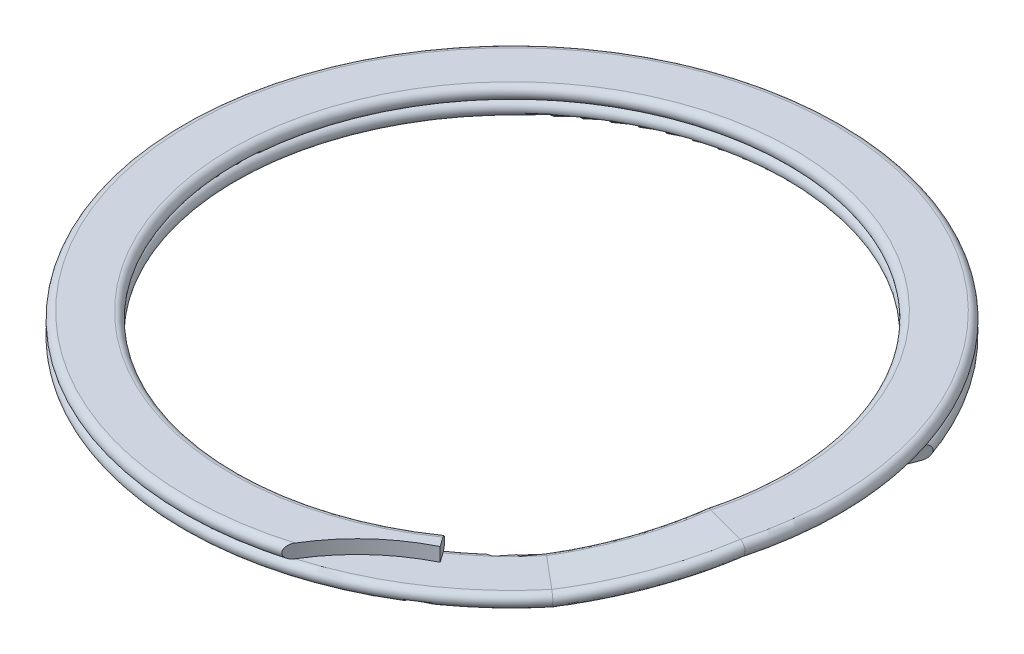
ISO-10303-21;
HEADER;
FILE_DESCRIPTION(('STEP AP214'),'2;1');
FILE_NAME('part.step','',(''),(''),'','','');
FILE_SCHEMA(('AUTOMOTIVE_DESIGN { 1 0 10303 214 1 1 1 1 }'));
ENDSEC;
DATA;
#1=APPLICATION_CONTEXT('core data for automotive mechanical design processes');
#2=APPLICATION_PROTOCOL_DEFINITION('international standard','automotive_design',2000,#1);
#3=PRODUCT_CONTEXT('',#1,'mechanical');
#4=PRODUCT('Part','Part','',(#3));
#5=PRODUCT_RELATED_PRODUCT_CATEGORY('part','',(#4));
#6=PRODUCT_DEFINITION_FORMATION('','',#4);
#7=PRODUCT_DEFINITION_CONTEXT('part definition',#1,'design');
#8=PRODUCT_DEFINITION('design','',#6,#7);
#9=PRODUCT_DEFINITION_SHAPE('','',#8);
#10=(LENGTH_UNIT() NAMED_UNIT(*) SI_UNIT(.MILLI.,.METRE.));
#11=(NAMED_UNIT(*) PLANE_ANGLE_UNIT() SI_UNIT($,.RADIAN.));
#12=(NAMED_UNIT(*) SI_UNIT($,.STERADIAN.) SOLID_ANGLE_UNIT());
#13=UNCERTAINTY_MEASURE_WITH_UNIT(LENGTH_MEASURE(1.E-05),#10,'distance_accuracy_value','');
#14=(GEOMETRIC_REPRESENTATION_CONTEXT(3) GLOBAL_UNCERTAINTY_ASSIGNED_CONTEXT((#13)) GLOBAL_UNIT_ASSIGNED_CONTEXT((#10,
#11,#12)) REPRESENTATION_CONTEXT('',''));
#15=CARTESIAN_POINT('',(0.,0.,0.));
#16=DIRECTION('',(0.,0.,1.));
#17=DIRECTION('',(1.,0.,0.));
#18=AXIS2_PLACEMENT_3D('',#15,#16,#17);
#19=CARTESIAN_POINT('',(1.4432899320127E-12,0.,-1.11022302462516E-13));
#20=DIRECTION('',(0.,1.,0.));
#21=DIRECTION('',(0.,0.,0.999999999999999));
#22=AXIS2_PLACEMENT_3D('',#19,#20,#21);
#23=TOROIDAL_SURFACE('',#22,10.9727999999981,0.266699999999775);
#24=CARTESIAN_POINT('',(10.9727999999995,0.,0.));
#25=DIRECTION('',(0.,0.,0.999999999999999));
#26=DIRECTION('',(1.,0.,0.));
#27=AXIS2_PLACEMENT_3D('',#24,#25,#26);
#28=CIRCLE('',#27,0.266699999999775);
#29=CARTESIAN_POINT('',(10.9727999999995,-0.266699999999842,0.));
#30=VERTEX_POINT('',#29);
#31=CARTESIAN_POINT('',(10.9727999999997,0.266699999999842,0.));
#32=VERTEX_POINT('',#31);
#33=EDGE_CURVE('E131',#30,#32,#28,.F.);
#34=ORIENTED_EDGE('',*,*,#33,.T.);
#35=CARTESIAN_POINT('',(-1.38777878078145E-13,0.266699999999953,-3.33066907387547E-13));
#36=DIRECTION('',(0.,-1.,0.));
#37=DIRECTION('',(0.,0.,-0.999999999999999));
#38=AXIS2_PLACEMENT_3D('',#35,#36,#37);
#39=CIRCLE('',#38,10.9727999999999);
#40=CARTESIAN_POINT('',(6.2937395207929,0.26669999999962,8.98839155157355));
#41=VERTEX_POINT('',#40);
#42=EDGE_CURVE('E128',#41,#32,#39,.T.);
#43=ORIENTED_EDGE('',*,*,#42,.F.);
#44=CARTESIAN_POINT('',(8.40565196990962,0.266700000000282,7.05318047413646));
#45=CARTESIAN_POINT('',(7.94391036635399,0.266700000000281,7.60466348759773));
#46=CARTESIAN_POINT('',(7.41338734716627,0.266700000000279,8.09029320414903));
#47=CARTESIAN_POINT('',(6.88327678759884,0.266700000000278,8.57554536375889));
#48=CARTESIAN_POINT('',(6.29373952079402,0.266700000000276,8.98839155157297));
#49=B_SPLINE_CURVE_WITH_KNOTS('',2,(#44,#45,#46,#47,#48),.UNSPECIFIED.,.F.,.F.,(3,2,3),(0.,0.5,
1.),.UNSPECIFIED.);
#50=CARTESIAN_POINT('',(8.40565197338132,0.266699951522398,7.05318046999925));
#51=VERTEX_POINT('',#50);
#52=EDGE_CURVE('E104',#51,#41,#49,.T.);
#53=ORIENTED_EDGE('',*,*,#52,.F.);
#54=CARTESIAN_POINT('',(8.20134841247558,-1.50540556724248E-13,6.88174842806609));
#55=CARTESIAN_POINT('',(8.20173617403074,0.00245470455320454,6.88128612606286));
#56=CARTESIAN_POINT('',(8.20212325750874,0.00491945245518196,6.88087757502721));
#57=CARTESIAN_POINT('',(8.20291057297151,0.00992824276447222,6.88015532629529));
#58=CARTESIAN_POINT('',(8.20331088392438,0.0124726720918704,6.87984439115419));
#59=CARTESIAN_POINT('',(8.20413006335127,0.0176386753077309,6.87932179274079));
#60=CARTESIAN_POINT('',(8.20454914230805,0.0202605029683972,6.87911298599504));
#61=CARTESIAN_POINT('',(8.20541117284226,0.0255788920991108,6.87879911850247));
#62=CARTESIAN_POINT('',(8.20585446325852,0.0282755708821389,6.8786969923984));
#63=CARTESIAN_POINT('',(8.20677033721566,0.0337407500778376,6.87860104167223));
#64=CARTESIAN_POINT('',(8.20724338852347,0.03650922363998,6.87861021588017));
#65=CARTESIAN_POINT('',(8.20822424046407,0.0421145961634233,6.87874148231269));
#66=CARTESIAN_POINT('',(8.20873263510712,0.0449513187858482,6.87886662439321));
#67=CARTESIAN_POINT('',(8.20978966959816,0.050689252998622,6.87923449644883));
#68=CARTESIAN_POINT('',(8.21033902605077,0.053590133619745,6.87948031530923));
#69=CARTESIAN_POINT('',(8.21148350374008,0.0594518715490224,6.8800942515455));
#70=CARTESIAN_POINT('',(8.21207945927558,0.0624122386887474,6.88046548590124));
#71=CARTESIAN_POINT('',(8.21332266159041,0.0683878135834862,6.88133499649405));
#72=CARTESIAN_POINT('',(8.21397085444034,0.0714023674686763,6.88183640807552));
#73=CARTESIAN_POINT('',(8.21532406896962,0.0774805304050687,6.88297102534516));
#74=CARTESIAN_POINT('',(8.21603014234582,0.0805433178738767,6.88360737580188));
#75=CARTESIAN_POINT('',(8.21750458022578,0.0867114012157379,6.88501666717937));
#76=CARTESIAN_POINT('',(8.21827409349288,0.0898157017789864,6.88579275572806));
#77=CARTESIAN_POINT('',(8.21988106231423,0.096059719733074,6.88748616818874));
#78=CARTESIAN_POINT('',(8.22071976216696,0.099198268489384,6.88840663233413));
#79=CARTESIAN_POINT('',(8.2219608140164,0.103668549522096,6.88981594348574));
#80=CARTESIAN_POINT('',(8.22234268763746,0.105021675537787,6.89025567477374));
#81=CARTESIAN_POINT('',(8.2231209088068,0.107732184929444,6.89116210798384));
#82=CARTESIAN_POINT('',(8.22351736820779,0.109089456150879,6.89162905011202));
#83=CARTESIAN_POINT('',(8.22473215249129,0.113187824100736,6.89308273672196));
#84=CARTESIAN_POINT('',(8.22556353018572,0.115911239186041,6.89410853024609));
#85=CARTESIAN_POINT('',(8.22750326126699,0.121979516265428,6.89648684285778));
#86=CARTESIAN_POINT('',(8.22862928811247,0.125311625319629,6.897857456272));
#87=CARTESIAN_POINT('',(8.23098663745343,0.131834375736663,6.90062884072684));
#88=CARTESIAN_POINT('',(8.23221525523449,0.135026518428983,6.90202837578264));
#89=CARTESIAN_POINT('',(8.2346046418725,0.14088449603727,6.90468764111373));
#90=CARTESIAN_POINT('',(8.23575009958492,0.143560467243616,6.90593884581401));
#91=CARTESIAN_POINT('',(8.23810458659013,0.148802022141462,6.90846008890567));
#92=CARTESIAN_POINT('',(8.23931197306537,0.151368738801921,6.90972930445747));
#93=CARTESIAN_POINT('',(8.24178463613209,0.156391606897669,6.9122827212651));
#94=CARTESIAN_POINT('',(8.24304831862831,0.158848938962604,6.91356614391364));
#95=CARTESIAN_POINT('',(8.24562871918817,0.163653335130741,6.91614358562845));
#96=CARTESIAN_POINT('',(8.24694388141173,0.166001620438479,6.91743688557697));
#97=CARTESIAN_POINT('',(8.24962242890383,0.170588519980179,6.92003004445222));
#98=CARTESIAN_POINT('',(8.25098430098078,0.172828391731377,6.92132924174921));
#99=CARTESIAN_POINT('',(8.25375170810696,0.177199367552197,6.92393027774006));
#100=CARTESIAN_POINT('',(8.25515577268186,0.179331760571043,6.92523151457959));
#101=CARTESIAN_POINT('',(8.25800314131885,0.183489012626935,6.92783286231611));
#102=CARTESIAN_POINT('',(8.25944501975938,0.185515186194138,6.92913243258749));
#103=CARTESIAN_POINT('',(8.26236394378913,0.189461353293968,6.93172690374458));
#104=CARTESIAN_POINT('',(8.2638396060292,0.191382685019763,6.93302132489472));
#105=CARTESIAN_POINT('',(8.2666123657,0.194860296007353,6.93542077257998));
#106=CARTESIAN_POINT('',(8.26790029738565,0.196425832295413,6.93652299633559));
#107=CARTESIAN_POINT('',(8.27049535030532,0.199483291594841,6.93871802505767));
#108=CARTESIAN_POINT('',(8.27180167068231,0.200976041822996,6.93981062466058));
#109=CARTESIAN_POINT('',(8.27442980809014,0.20388988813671,6.94198513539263));
#110=CARTESIAN_POINT('',(8.27575086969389,0.205311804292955,6.94306686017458));
#111=CARTESIAN_POINT('',(8.27840884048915,0.208086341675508,6.94521303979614));
#112=CARTESIAN_POINT('',(8.27974496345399,0.209439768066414,6.94627742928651));
#113=CARTESIAN_POINT('',(8.28311347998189,0.212763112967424,6.94895359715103));
#114=CARTESIAN_POINT('',(8.28516345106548,0.214706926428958,6.95057577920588));
#115=CARTESIAN_POINT('',(8.28930713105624,0.218496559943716,6.95387815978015));
#116=CARTESIAN_POINT('',(8.29140084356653,0.220342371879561,6.95555836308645));
#117=CARTESIAN_POINT('',(8.29563337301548,0.223934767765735,6.95896803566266));
#118=CARTESIAN_POINT('',(8.29777219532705,0.225681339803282,6.96069751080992));
#119=CARTESIAN_POINT('',(8.30209062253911,0.229073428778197,6.96420479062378));
#120=CARTESIAN_POINT('',(8.30427023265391,0.230718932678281,6.96598260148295));
#121=CARTESIAN_POINT('',(8.30839254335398,0.233707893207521,6.96935839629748));
#122=CARTESIAN_POINT('',(8.31033083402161,0.235063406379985,6.97095110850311));
#123=CARTESIAN_POINT('',(8.3142343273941,0.237694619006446,6.97416956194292));
#124=CARTESIAN_POINT('',(8.31619953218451,0.238970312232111,6.97579530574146));
#125=CARTESIAN_POINT('',(8.32015476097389,0.24144072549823,6.97907804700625));
#126=CARTESIAN_POINT('',(8.32214478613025,0.242635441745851,6.9807350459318));
#127=CARTESIAN_POINT('',(8.32614755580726,0.244942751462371,6.98407856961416));
#128=CARTESIAN_POINT('',(8.32816030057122,0.246055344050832,6.98576509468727));
#129=CARTESIAN_POINT('',(8.33220641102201,0.248197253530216,6.9891659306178));
#130=CARTESIAN_POINT('',(8.33423977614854,0.249226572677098,6.99088024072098));
#131=CARTESIAN_POINT('',(8.33832502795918,0.251200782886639,6.99433491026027));
#132=CARTESIAN_POINT('',(8.34037691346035,0.252145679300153,6.99607526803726));
#133=CARTESIAN_POINT('',(8.344497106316,0.253949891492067,6.99958029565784));
#134=CARTESIAN_POINT('',(8.34656541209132,0.254809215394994,7.00134496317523));
#135=CARTESIAN_POINT('',(8.35071634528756,0.256441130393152,7.00489687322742));
#136=CARTESIAN_POINT('',(8.3527989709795,0.257213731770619,7.00668411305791));
#137=CARTESIAN_POINT('',(8.35697644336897,0.258671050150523,7.010279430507));
#138=CARTESIAN_POINT('',(8.3590712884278,0.259355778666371,7.01208750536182));
#139=CARTESIAN_POINT('',(8.36327109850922,0.260636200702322,7.01572275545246));
#140=CARTESIAN_POINT('',(8.36537606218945,0.261231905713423,7.01754992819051));
#141=CARTESIAN_POINT('',(8.3695940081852,0.262333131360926,7.02122163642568));
#142=CARTESIAN_POINT('',(8.37170698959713,0.262838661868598,7.02306616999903));
#143=CARTESIAN_POINT('',(8.37593886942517,0.263758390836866,7.02677086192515));
#144=CARTESIAN_POINT('',(8.37805776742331,0.264172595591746,7.02863101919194));
#145=CARTESIAN_POINT('',(8.3822993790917,0.264908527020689,7.0323652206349));
#146=CARTESIAN_POINT('',(8.38442209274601,0.265230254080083,7.03423926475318));
#147=CARTESIAN_POINT('',(8.38866923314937,0.265780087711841,7.03799950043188));
#148=CARTESIAN_POINT('',(8.39079366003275,0.266008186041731,7.03988569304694));
#149=CARTESIAN_POINT('',(8.39504212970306,0.266369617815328,7.0436684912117));
#150=CARTESIAN_POINT('',(8.39716617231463,0.266502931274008,7.04556509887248));
#151=CARTESIAN_POINT('',(8.40141175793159,0.266673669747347,7.04936697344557));
#152=CARTESIAN_POINT('',(8.40353329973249,0.26671105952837,7.05127224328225));
#153=CARTESIAN_POINT('',(8.40565197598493,0.266699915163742,7.05318046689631));
#154=B_SPLINE_CURVE_WITH_KNOTS('',3,(#54,#55,#56,#57,#58,#59,#60,#61,#62,#63,#64,#65,#66,#67,
#68,#69,#70,#71,#72,#73,#74,#75,#76,#77,#78,#79,#80,#81,#82,#83,#84,#85,#86,#87,#88,#89,#90,#91,
#92,#93,#94,#95,#96,#97,#98,#99,#100,#101,#102,#103,#104,#105,#106,#107,#108,#109,#110,#111,
#112,#113,#114,#115,#116,#117,#118,#119,#120,#121,#122,#123,#124,#125,#126,#127,#128,#129,#130,
#131,#132,#133,#134,#135,#136,#137,#138,#139,#140,#141,#142,#143,#144,#145,#146,#147,#148,#149,
#150,#151,#152,#153),.UNSPECIFIED.,.F.,.F.,(4,2,2,2,2,2,2,2,2,2,2,2,2,2,2,2,2,2,2,2,2,2,2,2,2,2,
2,2,2,2,2,2,2,2,2,2,2,2,2,2,2,2,2,2,2,2,2,2,2,4),(0.,0.0075824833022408,0.0153634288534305,
0.0233510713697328,0.0315530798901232,0.0399765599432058,0.0486280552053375,0.0575135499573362,
0.0666384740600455,0.0760077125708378,0.085625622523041,0.0954960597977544,0.105622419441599,
0.110041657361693,0.114508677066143,0.123586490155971,0.134907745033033,0.145991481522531,
0.155494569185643,0.164815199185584,0.173953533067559,0.182910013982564,0.191685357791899,
0.200280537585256,0.208696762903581,0.216935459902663,0.223857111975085,0.230650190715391,
0.237315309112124,0.243852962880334,0.253623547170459,0.263394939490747,0.273167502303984,
0.282941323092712,0.29149445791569,0.300048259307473,0.308602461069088,0.317156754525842,
0.325710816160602,0.334264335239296,0.34281704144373,0.351368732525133,0.359919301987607,
0.368468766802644,0.377017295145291,0.385565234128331,0.394113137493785,0.402661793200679,
0.411212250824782,0.419765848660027),.UNSPECIFIED.);
#155=CARTESIAN_POINT('',(8.20134841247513,3.33066907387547E-13,6.88174842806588));
#156=VERTEX_POINT('',#155);
#157=EDGE_CURVE('E343',#156,#51,#154,.T.);
#158=ORIENTED_EDGE('',*,*,#157,.F.);
#159=CARTESIAN_POINT('',(8.40565542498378,-0.266699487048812,7.05317635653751));
#160=CARTESIAN_POINT('',(8.40307583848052,-0.266701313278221,7.05103331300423));
#161=CARTESIAN_POINT('',(8.40047311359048,-0.266640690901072,7.04891892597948));
#162=CARTESIAN_POINT('',(8.39602133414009,-0.266429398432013,7.04534610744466));
#163=CARTESIAN_POINT('',(8.39417764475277,-0.266310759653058,7.04387907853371));
#164=CARTESIAN_POINT('',(8.39013285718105,-0.265981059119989,7.04067178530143));
#165=CARTESIAN_POINT('',(8.38793137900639,-0.265756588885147,7.03893336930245));
#166=CARTESIAN_POINT('',(8.38317405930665,-0.265174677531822,7.03518858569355));
#167=CARTESIAN_POINT('',(8.38061846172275,-0.264801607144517,7.03318433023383));
#168=CARTESIAN_POINT('',(8.37516086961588,-0.263875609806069,7.02891250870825));
#169=CARTESIAN_POINT('',(8.37226017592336,-0.263304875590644,7.02664712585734));
#170=CARTESIAN_POINT('',(8.36660429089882,-0.262040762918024,7.02224518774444));
#171=CARTESIAN_POINT('',(8.36384849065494,-0.261354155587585,7.02010746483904));
#172=CARTESIAN_POINT('',(8.35858224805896,-0.259900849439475,7.01600711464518));
#173=CARTESIAN_POINT('',(8.35606943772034,-0.259144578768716,7.01404383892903));
#174=CARTESIAN_POINT('',(8.35139717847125,-0.257614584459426,7.01035555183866));
#175=CARTESIAN_POINT('',(8.34923262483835,-0.256854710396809,7.00863125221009));
#176=CARTESIAN_POINT('',(8.34493457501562,-0.255244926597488,7.00518201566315));
#177=CARTESIAN_POINT('',(8.34280110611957,-0.254394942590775,7.00345707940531));
#178=CARTESIAN_POINT('',(8.33856812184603,-0.252605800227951,7.00000755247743));
#179=CARTESIAN_POINT('',(8.33646863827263,-0.25166656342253,6.99828296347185));
#180=CARTESIAN_POINT('',(8.3323057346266,-0.249699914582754,6.99483604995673));
#181=CARTESIAN_POINT('',(8.33024235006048,-0.248672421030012,6.99311372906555));
#182=CARTESIAN_POINT('',(8.32644556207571,-0.246683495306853,6.98991984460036));
#183=CARTESIAN_POINT('',(8.32470692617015,-0.245733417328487,6.98844741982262));
#184=CARTESIAN_POINT('',(8.32126064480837,-0.243769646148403,6.98550518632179));
#185=CARTESIAN_POINT('',(8.31955302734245,-0.242755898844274,6.98403538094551));
#186=CARTESIAN_POINT('',(8.31579380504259,-0.240439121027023,6.98078924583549));
#187=CARTESIAN_POINT('',(8.31374856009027,-0.239121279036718,6.97901610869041));
#188=CARTESIAN_POINT('',(8.30976901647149,-0.2364503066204,6.97556980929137));
#189=CARTESIAN_POINT('',(8.30783349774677,-0.235100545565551,6.97389544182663));
#190=CARTESIAN_POINT('',(8.30407410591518,-0.232376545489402,6.97064242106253));
#191=CARTESIAN_POINT('',(8.30224888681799,-0.231005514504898,6.96906263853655));
#192=CARTESIAN_POINT('',(8.29870736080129,-0.22824959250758,6.96599770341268));
#193=CARTESIAN_POINT('',(8.29698970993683,-0.226867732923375,6.96451137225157));
#194=CARTESIAN_POINT('',(8.29249003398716,-0.223126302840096,6.96061787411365));
#195=CARTESIAN_POINT('',(8.28973471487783,-0.220710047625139,6.95823394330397));
#196=CARTESIAN_POINT('',(8.28453880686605,-0.215907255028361,6.95373942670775));
#197=CARTESIAN_POINT('',(8.28209093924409,-0.2135345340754,6.95162245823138));
#198=CARTESIAN_POINT('',(8.27749327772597,-0.208862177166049,6.94764785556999));
#199=CARTESIAN_POINT('',(8.27533637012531,-0.206574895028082,6.94578393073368));
#200=CARTESIAN_POINT('',(8.27130325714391,-0.202111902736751,6.9423008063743));
#201=CARTESIAN_POINT('',(8.26942021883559,-0.199947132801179,6.94067549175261));
#202=CARTESIAN_POINT('',(8.2659169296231,-0.195762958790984,6.93765477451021));
#203=CARTESIAN_POINT('',(8.26429027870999,-0.193753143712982,6.93625351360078));
#204=CARTESIAN_POINT('',(8.26128274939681,-0.189908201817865,6.93366612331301));
#205=CARTESIAN_POINT('',(8.25989595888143,-0.188081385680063,6.93247448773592));
#206=CARTESIAN_POINT('',(8.25635934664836,-0.183284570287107,6.92944418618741));
#207=CARTESIAN_POINT('',(8.25423938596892,-0.180272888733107,6.92763624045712));
#208=CARTESIAN_POINT('',(8.25081809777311,-0.175189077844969,6.92473658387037));
#209=CARTESIAN_POINT('',(8.24948801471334,-0.173153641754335,6.92361407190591));
#210=CARTESIAN_POINT('',(8.24764252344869,-0.170292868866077,6.92211825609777));
#211=CARTESIAN_POINT('',(8.24712620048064,-0.169488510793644,6.92170647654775));
#212=CARTESIAN_POINT('',(8.24595090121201,-0.167675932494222,6.92081558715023));
#213=CARTESIAN_POINT('',(8.24528803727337,-0.166666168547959,6.92034478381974));
#214=CARTESIAN_POINT('',(8.24335592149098,-0.163685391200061,6.91898136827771));
#215=CARTESIAN_POINT('',(8.24209926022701,-0.161698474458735,6.91810600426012));
#216=CARTESIAN_POINT('',(8.23945602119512,-0.157439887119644,6.9163144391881));
#217=CARTESIAN_POINT('',(8.23807229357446,-0.155163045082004,6.9154062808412));
#218=CARTESIAN_POINT('',(8.23519789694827,-0.150309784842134,6.91355912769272));
#219=CARTESIAN_POINT('',(8.23371198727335,-0.147727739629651,6.91262754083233));
#220=CARTESIAN_POINT('',(8.23065261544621,-0.142249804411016,6.91075245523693));
#221=CARTESIAN_POINT('',(8.22908490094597,-0.139348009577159,6.90981678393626));
#222=CARTESIAN_POINT('',(8.22661533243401,-0.134619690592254,6.90838197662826));
#223=CARTESIAN_POINT('',(8.22569132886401,-0.132813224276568,6.90785442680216));
#224=CARTESIAN_POINT('',(8.22356520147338,-0.128554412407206,6.90665117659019));
#225=CARTESIAN_POINT('',(8.22237602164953,-0.126092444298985,6.90598650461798));
#226=CARTESIAN_POINT('',(8.22015484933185,-0.121318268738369,6.90474676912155));
#227=CARTESIAN_POINT('',(8.21911780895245,-0.119009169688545,6.9041687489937));
#228=CARTESIAN_POINT('',(8.2168406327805,-0.113753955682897,6.90290192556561));
#229=CARTESIAN_POINT('',(8.21561758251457,-0.11079795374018,6.90222327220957));
#230=CARTESIAN_POINT('',(8.21342447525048,-0.105224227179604,6.900999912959));
#231=CARTESIAN_POINT('',(8.21244221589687,-0.102612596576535,6.90044927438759));
#232=CARTESIAN_POINT('',(8.21080739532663,-0.0980424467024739,6.89951830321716));
#233=CARTESIAN_POINT('',(8.21013588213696,-0.0960920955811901,6.89913115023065));
#234=CARTESIAN_POINT('',(8.20894243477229,-0.0924641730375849,6.89842151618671));
#235=CARTESIAN_POINT('',(8.20841311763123,-0.0907892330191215,6.89809799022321));
#236=CARTESIAN_POINT('',(8.20687365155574,-0.085692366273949,6.89711943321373));
#237=CARTESIAN_POINT('',(8.20593037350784,-0.0822495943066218,6.89646649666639));
#238=CARTESIAN_POINT('',(8.2042317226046,-0.0753829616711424,6.89518744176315));
#239=CARTESIAN_POINT('',(8.20347319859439,-0.0719599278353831,6.89456105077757));
#240=CARTESIAN_POINT('',(8.20222370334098,-0.0655594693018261,6.89340356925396));
#241=CARTESIAN_POINT('',(8.20171015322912,-0.0625866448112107,6.8928713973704));
#242=CARTESIAN_POINT('',(8.20082100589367,-0.0566662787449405,6.89181989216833));
#243=CARTESIAN_POINT('',(8.20044341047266,-0.0537190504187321,6.89130048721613));
#244=CARTESIAN_POINT('',(8.19982293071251,-0.0478543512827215,6.89027154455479));
#245=CARTESIAN_POINT('',(8.19957812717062,-0.0449370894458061,6.88976197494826));
#246=CARTESIAN_POINT('',(8.19921974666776,-0.0391363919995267,6.88874990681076));
#247=CARTESIAN_POINT('',(8.19910434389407,-0.0362530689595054,6.888247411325));
#248=CARTESIAN_POINT('',(8.19900130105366,-0.0305239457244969,6.88724660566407));
#249=CARTESIAN_POINT('',(8.19901193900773,-0.0276781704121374,6.88674833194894));
#250=CARTESIAN_POINT('',(8.19915745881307,-0.0220274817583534,6.88575306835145));
#251=CARTESIAN_POINT('',(8.19929073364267,-0.0192225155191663,6.88525614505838));
#252=CARTESIAN_POINT('',(8.19967802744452,-0.0136564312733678,6.88426066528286));
#253=CARTESIAN_POINT('',(8.19993056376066,-0.0108951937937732,6.88376220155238));
#254=CARTESIAN_POINT('',(8.20055271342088,-0.0054192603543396,6.88276067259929));
#255=CARTESIAN_POINT('',(8.20092097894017,-0.00270439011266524,6.88225772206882));
#256=CARTESIAN_POINT('',(8.20134841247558,-1.50540556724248E-13,6.88174842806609));
#257=B_SPLINE_CURVE_WITH_KNOTS('',3,(#159,#160,#161,#162,#163,#164,#165,#166,#167,#168,#169,
#170,#171,#172,#173,#174,#175,#176,#177,#178,#179,#180,#181,#182,#183,#184,#185,#186,#187,#188,
#189,#190,#191,#192,#193,#194,#195,#196,#197,#198,#199,#200,#201,#202,#203,#204,#205,#206,#207,
#208,#209,#210,#211,#212,#213,#214,#215,#216,#217,#218,#219,#220,#221,#222,#223,#224,#225,#226,
#227,#228,#229,#230,#231,#232,#233,#234,#235,#236,#237,#238,#239,#240,#241,#242,#243,#244,#245,
#246,#247,#248,#249,#250,#251,#252,#253,#254,#255,#256),.UNSPECIFIED.,.F.,.F.,(4,2,2,2,2,2,2,2,
2,2,2,2,2,2,2,2,2,2,2,2,2,2,2,2,2,2,2,2,2,2,2,2,2,2,2,2,2,2,2,2,2,2,2,2,2,2,2,2,4),(0.,
0.010059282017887,0.0171357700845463,0.0255765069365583,0.0353817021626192,0.0465517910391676,
0.057213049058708,0.0670425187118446,0.0756504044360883,0.0842654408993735,0.0928881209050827,
0.101518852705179,0.108923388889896,0.116334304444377,0.125364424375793,0.134043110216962,
0.142370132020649,0.150345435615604,0.163455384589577,0.175490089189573,0.186451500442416,
0.196341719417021,0.205162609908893,0.212915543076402,0.225218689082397,0.233251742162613,
0.236373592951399,0.24026227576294,0.247787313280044,0.256230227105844,0.265592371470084,
0.275874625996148,0.282163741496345,0.290603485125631,0.298391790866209,0.308200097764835,
0.316730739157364,0.323026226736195,0.328384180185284,0.339265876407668,0.349946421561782,
0.359133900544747,0.368180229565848,0.377092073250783,0.385876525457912,0.394541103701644,
0.403093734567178,0.411542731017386,0.41989676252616),.UNSPECIFIED.);
#258=CARTESIAN_POINT('',(8.40565543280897,-0.266699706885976,7.05317634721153));
#259=VERTEX_POINT('',#258);
#260=EDGE_CURVE('E669',#259,#156,#257,.T.);
#261=ORIENTED_EDGE('',*,*,#260,.F.);
#262=CARTESIAN_POINT('',(1.48492329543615E-12,-0.266699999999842,-3.33066907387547E-13));
#263=DIRECTION('',(0.,1.,0.));
#264=DIRECTION('',(0.,0.,0.999999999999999));
#265=AXIS2_PLACEMENT_3D('',#262,#263,#264);
#266=CIRCLE('',#265,10.972799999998);
#267=EDGE_CURVE('E115',#259,#30,#266,.F.);
#268=ORIENTED_EDGE('',*,*,#267,.T.);
#269=EDGE_LOOP('',(#34,#43,#53,#158,#261,#268));
#270=FACE_BOUND('',#269,.T.);
#271=ADVANCED_FACE('F16',(#270),#23,.T.);
#272=CARTESIAN_POINT('',(8.37766154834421,-0.272802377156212,7.16687526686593));
#273=CARTESIAN_POINT('',(8.40043305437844,-0.268918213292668,7.14025669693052));
#274=CARTESIAN_POINT('',(9.45970300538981,-0.0872340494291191,5.89011056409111));
#275=CARTESIAN_POINT('',(10.2507674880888,0.0983363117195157,4.37048976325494));
#276=CARTESIAN_POINT('',(10.6672556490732,0.280022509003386,2.78571344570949));
#277=CARTESIAN_POINT('',(10.6760035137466,0.283908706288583,2.75177453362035));
#278=CARTESIAN_POINT('',(8.36460043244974,-0.276546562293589,7.15570181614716));
#279=CARTESIAN_POINT('',(8.38733643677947,-0.272662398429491,7.12912474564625));
#280=CARTESIAN_POINT('',(9.44495494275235,-0.0909782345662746,5.88092764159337));
#281=CARTESIAN_POINT('',(10.2347861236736,0.0945921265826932,4.36367599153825));
#282=CARTESIAN_POINT('',(10.6506249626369,0.276278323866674,2.7813704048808));
#283=CARTESIAN_POINT('',(10.6593591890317,0.280164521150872,2.74748440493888));
#284=CARTESIAN_POINT('',(8.29820474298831,-0.285571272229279,7.09890200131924));
#285=CARTESIAN_POINT('',(8.32076027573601,-0.281687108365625,7.07253589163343));
#286=CARTESIAN_POINT('',(9.36998372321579,-0.100002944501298,5.83424660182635));
#287=CARTESIAN_POINT('',(10.1535454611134,0.0855674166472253,4.32903844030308));
#288=CARTESIAN_POINT('',(10.566083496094,0.267253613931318,2.75929272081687));
#289=CARTESIAN_POINT('',(10.5747483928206,0.271139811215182,2.72567569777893));
#290=CARTESIAN_POINT('',(8.17929389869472,-0.220641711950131,6.99717681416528));
#291=CARTESIAN_POINT('',(8.20152621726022,-0.216757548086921,6.97118852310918));
#292=CARTESIAN_POINT('',(9.23571459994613,-0.0350733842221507,5.75064355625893));
#293=CARTESIAN_POINT('',(10.0080481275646,0.150496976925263,4.26700458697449));
#294=CARTESIAN_POINT('',(10.4146746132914,0.332183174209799,2.71975286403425));
#295=CARTESIAN_POINT('',(10.4232153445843,0.336069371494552,2.68661756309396));
#296=CARTESIAN_POINT('',(8.1134232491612,-0.0116524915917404,6.94082615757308));
#297=CARTESIAN_POINT('',(8.13547652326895,-0.00776832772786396,6.91504715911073));
#298=CARTESIAN_POINT('',(9.16133623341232,0.173915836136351,5.70433165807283));
#299=CARTESIAN_POINT('',(9.9274498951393,0.359486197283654,4.23264094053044));
#300=CARTESIAN_POINT('',(10.3308016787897,0.541172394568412,2.69784976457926));
#301=CARTESIAN_POINT('',(10.339273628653,0.545058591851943,2.66498131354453));
#302=CARTESIAN_POINT('',(8.17929389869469,0.197336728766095,6.9971768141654));
#303=CARTESIAN_POINT('',(8.20152621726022,0.201220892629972,6.97118852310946));
#304=CARTESIAN_POINT('',(9.23571459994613,0.382905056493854,5.75064355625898));
#305=CARTESIAN_POINT('',(10.0080481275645,0.5684754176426,4.26700458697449));
#306=CARTESIAN_POINT('',(10.4146746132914,0.750161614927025,2.7197528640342));
#307=CARTESIAN_POINT('',(10.4232153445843,0.754047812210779,2.68661756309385));
#308=CARTESIAN_POINT('',(8.29820474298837,0.262266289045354,7.09890200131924));
#309=CARTESIAN_POINT('',(8.32076027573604,0.266150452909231,7.07253589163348));
#310=CARTESIAN_POINT('',(9.36998372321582,0.447834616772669,5.8342466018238));
#311=CARTESIAN_POINT('',(10.1535454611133,0.633404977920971,4.32903844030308));
#312=CARTESIAN_POINT('',(10.566083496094,0.815091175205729,2.75929272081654));
#313=CARTESIAN_POINT('',(10.5747483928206,0.818977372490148,2.7256756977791));
#314=CARTESIAN_POINT('',(8.36460043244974,0.253241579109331,7.155701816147));
#315=CARTESIAN_POINT('',(8.3873364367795,0.257125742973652,7.12912474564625));
#316=CARTESIAN_POINT('',(9.44495494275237,0.438809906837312,5.88092764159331));
#317=CARTESIAN_POINT('',(10.2347861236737,0.624380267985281,4.36367599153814));
#318=CARTESIAN_POINT('',(10.6506249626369,0.80606646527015,2.78137040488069));
#319=CARTESIAN_POINT('',(10.6593591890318,0.809952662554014,2.74748440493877));
#320=CARTESIAN_POINT('',(8.3776615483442,0.249497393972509,7.16687526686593));
#321=CARTESIAN_POINT('',(8.40043305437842,0.253381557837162,7.14025669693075));
#322=CARTESIAN_POINT('',(9.4597030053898,0.435065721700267,5.89011056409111));
#323=CARTESIAN_POINT('',(10.2507674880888,0.620636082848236,4.37048976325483));
#324=CARTESIAN_POINT('',(10.6672556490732,0.802322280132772,2.78571344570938));
#325=CARTESIAN_POINT('',(10.6760035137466,0.806208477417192,2.75177453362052));
#326=B_SPLINE_SURFACE_WITH_KNOTS('',3,3,((#272,#273,#274,#275,#276,#277),(#278,#279,#280,#281,
#282,#283),(#284,#285,#286,#287,#288,#289),(#290,#291,#292,#293,#294,#295),(#296,#297,#298,#299,
#300,#301),(#302,#303,#304,#305,#306,#307),(#308,#309,#310,#311,#312,#313),(#314,#315,#316,#317,
#318,#319),(#320,#321,#322,#323,#324,#325)),.UNSPECIFIED.,.F.,.F.,.F.,(4,1,1,1,1,1,4),(4,1,1,4),
(-0.06254274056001,0.,0.25,0.5,0.75,1.,1.06254274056),(-0.009531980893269,0.,0.4363323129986,
0.4458692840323),.UNSPECIFIED.);
#327=CARTESIAN_POINT('',(10.5989109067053,0.800100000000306,2.8399696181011));
#328=CARTESIAN_POINT('',(10.5472790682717,0.777875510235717,3.03265694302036));
#329=CARTESIAN_POINT('',(10.4903348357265,0.755650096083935,3.22391503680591));
#330=CARTESIAN_POINT('',(10.3660925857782,0.711199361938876,3.6030361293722));
#331=CARTESIAN_POINT('',(10.2987947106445,0.688974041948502,3.79089917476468));
#332=CARTESIAN_POINT('',(10.1541112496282,0.644523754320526,4.16270784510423));
#333=CARTESIAN_POINT('',(10.076725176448,0.622298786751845,4.34665328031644));
#334=CARTESIAN_POINT('',(9.91216031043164,0.577849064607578,4.7101235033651));
#335=CARTESIAN_POINT('',(9.82498094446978,0.555624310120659,4.88964803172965));
#336=CARTESIAN_POINT('',(9.64099831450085,0.511174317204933,5.2437132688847));
#337=CARTESIAN_POINT('',(9.54419445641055,0.48894907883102,5.41825366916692));
#338=CARTESIAN_POINT('',(9.34115060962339,0.444498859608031,5.76175087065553));
#339=CARTESIAN_POINT('',(9.23491090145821,0.422273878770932,5.9307078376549));
#340=CARTESIAN_POINT('',(9.01330346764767,0.377823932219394,6.26251098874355));
#341=CARTESIAN_POINT('',(8.89793634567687,0.355598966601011,6.42535757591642));
#342=CARTESIAN_POINT('',(8.65835753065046,0.311149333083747,6.74439526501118));
#343=CARTESIAN_POINT('',(8.5341462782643,0.288924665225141,6.90058669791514));
#344=CARTESIAN_POINT('',(8.4056519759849,0.266699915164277,7.0531804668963));
#345=B_SPLINE_CURVE_WITH_KNOTS('',3,(#327,#328,#329,#330,#331,#332,#333,#334,#335,#336,#337,
#338,#339,#340,#341,#342,#343,#344),.UNSPECIFIED.,.F.,.F.,(4,2,2,2,2,2,2,2,4),(0.,
0.602074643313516,1.20414101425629,1.80623647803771,2.40836719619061,3.01053510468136,
3.61268511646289,4.21479533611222,4.81687557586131),.UNSPECIFIED.);
#346=CARTESIAN_POINT('',(10.5989109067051,0.800100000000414,2.83996961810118));
#347=VERTEX_POINT('',#346);
#348=EDGE_CURVE('E125',#347,#51,#345,.T.);
#349=CARTESIAN_POINT('',(10.5989109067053,0.80009999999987,2.83996961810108));
#350=CARTESIAN_POINT('',(10.5955465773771,0.800101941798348,2.83905002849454));
#351=CARTESIAN_POINT('',(10.5921928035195,0.800036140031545,2.83809390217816));
#352=CARTESIAN_POINT('',(10.5864840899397,0.799806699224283,2.83642994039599));
#353=CARTESIAN_POINT('',(10.5841249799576,0.799677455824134,2.83573162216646));
#354=CARTESIAN_POINT('',(10.5789547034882,0.799317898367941,2.83419174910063));
#355=CARTESIAN_POINT('',(10.5761449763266,0.799072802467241,2.8333487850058));
#356=CARTESIAN_POINT('',(10.5700802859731,0.79843686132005,2.83151957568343));
#357=CARTESIAN_POINT('',(10.5668274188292,0.798028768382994,2.83053237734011));
#358=CARTESIAN_POINT('',(10.5598864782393,0.797015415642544,2.82841714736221));
#359=CARTESIAN_POINT('',(10.5562013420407,0.796390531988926,2.82728877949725));
#360=CARTESIAN_POINT('',(10.550821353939,0.795351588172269,2.82563683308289));
#361=CARTESIAN_POINT('',(10.5491140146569,0.795003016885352,2.82511189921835));
#362=CARTESIAN_POINT('',(10.545624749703,0.79425221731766,2.82403569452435));
#363=CARTESIAN_POINT('',(10.543843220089,0.793848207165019,2.82348438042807));
#364=CARTESIAN_POINT('',(10.5389683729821,0.792685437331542,2.82198386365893));
#365=CARTESIAN_POINT('',(10.5358821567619,0.791885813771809,2.82104283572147));
#366=CARTESIAN_POINT('',(10.5301143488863,0.790271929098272,2.81931636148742));
#367=CARTESIAN_POINT('',(10.527430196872,0.789471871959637,2.8185261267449));
#368=CARTESIAN_POINT('',(10.5220807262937,0.787779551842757,2.81697397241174));
#369=CARTESIAN_POINT('',(10.5194154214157,0.786887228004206,2.81621207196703));
#370=CARTESIAN_POINT('',(10.514106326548,0.78501137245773,2.81471809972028));
#371=CARTESIAN_POINT('',(10.511462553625,0.784027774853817,2.8139860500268));
#372=CARTESIAN_POINT('',(10.5061993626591,0.781970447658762,2.81255261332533));
#373=CARTESIAN_POINT('',(10.5035799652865,0.780896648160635,2.81185125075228));
#374=CARTESIAN_POINT('',(10.4987412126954,0.778819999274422,2.81057672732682));
#375=CARTESIAN_POINT('',(10.4965179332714,0.777828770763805,2.80999951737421));
#376=CARTESIAN_POINT('',(10.4920926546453,0.775781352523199,2.80887164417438));
#377=CARTESIAN_POINT('',(10.489890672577,0.77472511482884,2.80832100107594));
#378=CARTESIAN_POINT('',(10.4829780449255,0.771289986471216,2.80660066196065));
#379=CARTESIAN_POINT('',(10.4783179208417,0.768797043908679,2.80545319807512));
#380=CARTESIAN_POINT('',(10.4694755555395,0.763717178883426,2.8032654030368));
#381=CARTESIAN_POINT('',(10.4652827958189,0.761149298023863,2.80222322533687));
#382=CARTESIAN_POINT('',(10.4578148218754,0.756279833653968,2.80036487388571));
#383=CARTESIAN_POINT('',(10.4545148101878,0.75401842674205,2.79954292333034));
#384=CARTESIAN_POINT('',(10.448251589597,0.749509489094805,2.79797894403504));
#385=CARTESIAN_POINT('',(10.4452811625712,0.747272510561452,2.79723540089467));
#386=CARTESIAN_POINT('',(10.4396617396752,0.74284594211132,2.79582455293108));
#387=CARTESIAN_POINT('',(10.4370055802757,0.740665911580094,2.79515577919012));
#388=CARTESIAN_POINT('',(10.4319983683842,0.736383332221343,2.79388996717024));
#389=CARTESIAN_POINT('',(10.4296402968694,0.734289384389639,2.79329158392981));
#390=CARTESIAN_POINT('',(10.4252123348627,0.730205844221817,2.792161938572));
#391=CARTESIAN_POINT('',(10.4231356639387,0.728223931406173,2.79162949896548));
#392=CARTESIAN_POINT('',(10.4192536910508,0.72438829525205,2.79062729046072));
#393=CARTESIAN_POINT('',(10.4174419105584,0.722541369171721,2.7901565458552));
#394=CARTESIAN_POINT('',(10.412682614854,0.717534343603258,2.78890783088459));
#395=CARTESIAN_POINT('',(10.4097870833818,0.714323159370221,2.78813524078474));
#396=CARTESIAN_POINT('',(10.4049081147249,0.708620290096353,2.78679404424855));
#397=CARTESIAN_POINT('',(10.402885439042,0.706162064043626,2.78622534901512));
#398=CARTESIAN_POINT('',(10.3999425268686,0.702433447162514,2.78532978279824));
#399=CARTESIAN_POINT('',(10.3989813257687,0.701190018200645,2.78502579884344));
#400=CARTESIAN_POINT('',(10.3972950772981,0.698958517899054,2.78445318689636));
#401=CARTESIAN_POINT('',(10.3965639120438,0.697973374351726,2.78419112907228));
#402=CARTESIAN_POINT('',(10.3944241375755,0.695044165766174,2.78341150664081));
#403=CARTESIAN_POINT('',(10.3930373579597,0.69308530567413,2.78288960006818));
#404=CARTESIAN_POINT('',(10.3901400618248,0.688861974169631,2.78176364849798));
#405=CARTESIAN_POINT('',(10.3886381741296,0.686591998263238,2.78115804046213));
#406=CARTESIAN_POINT('',(10.3855348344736,0.68173094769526,2.77987306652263));
#407=CARTESIAN_POINT('',(10.3839428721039,0.679133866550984,2.77919351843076));
#408=CARTESIAN_POINT('',(10.3806878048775,0.67360305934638,2.77776782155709));
#409=CARTESIAN_POINT('',(10.3790352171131,0.670662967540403,2.77702229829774));
#410=CARTESIAN_POINT('',(10.3764606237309,0.66586361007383,2.77582595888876));
#411=CARTESIAN_POINT('',(10.375502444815,0.664024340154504,2.77537226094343));
#412=CARTESIAN_POINT('',(10.3733531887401,0.659778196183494,2.77434520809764));
#413=CARTESIAN_POINT('',(10.3721762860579,0.657363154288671,2.77377581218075));
#414=CARTESIAN_POINT('',(10.3699743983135,0.65267207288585,2.77271012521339));
#415=CARTESIAN_POINT('',(10.368944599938,0.650398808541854,2.77221153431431));
#416=CARTESIAN_POINT('',(10.3666771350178,0.645208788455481,2.77111304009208));
#417=CARTESIAN_POINT('',(10.3654574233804,0.642282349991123,2.77052165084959));
#418=CARTESIAN_POINT('',(10.3632558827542,0.636742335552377,2.76946283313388));
#419=CARTESIAN_POINT('',(10.3622632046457,0.634134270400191,2.76898908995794));
#420=CARTESIAN_POINT('',(10.3605920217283,0.629549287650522,2.76820764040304));
#421=CARTESIAN_POINT('',(10.3598977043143,0.627580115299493,2.76788830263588));
#422=CARTESIAN_POINT('',(10.3586391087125,0.623893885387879,2.76733094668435));
#423=CARTESIAN_POINT('',(10.3580700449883,0.622179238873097,2.76708778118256));
#424=CARTESIAN_POINT('',(10.3564412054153,0.617133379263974,2.76642787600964));
#425=CARTESIAN_POINT('',(10.3554179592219,0.613783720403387,2.76606037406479));
#426=CARTESIAN_POINT('',(10.3534920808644,0.607100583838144,2.76545841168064));
#427=CARTESIAN_POINT('',(10.3525876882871,0.603767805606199,2.76522178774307));
#428=CARTESIAN_POINT('',(10.3509975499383,0.597534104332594,2.76490420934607));
#429=CARTESIAN_POINT('',(10.3502988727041,0.594637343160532,2.7648062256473));
#430=CARTESIAN_POINT('',(10.348985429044,0.588865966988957,2.76471155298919));
#431=CARTESIAN_POINT('',(10.3483696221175,0.585991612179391,2.76471346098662));
#432=CARTESIAN_POINT('',(10.3472181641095,0.580269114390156,2.76481771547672));
#433=CARTESIAN_POINT('',(10.3466815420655,0.577421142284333,2.76491870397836));
#434=CARTESIAN_POINT('',(10.3456846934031,0.571755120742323,2.76522001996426));
#435=CARTESIAN_POINT('',(10.3452235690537,0.568937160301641,2.76541904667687));
#436=CARTESIAN_POINT('',(10.3443738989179,0.563334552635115,2.76591539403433));
#437=CARTESIAN_POINT('',(10.3439845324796,0.560549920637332,2.76621147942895));
#438=CARTESIAN_POINT('',(10.343274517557,0.555017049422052,2.76690086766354));
#439=CARTESIAN_POINT('',(10.3429531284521,0.55226876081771,2.76729301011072));
#440=CARTESIAN_POINT('',(10.342375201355,0.54681135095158,2.76817345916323));
#441=CARTESIAN_POINT('',(10.3421180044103,0.544102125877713,2.76866068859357));
#442=CARTESIAN_POINT('',(10.3416644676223,0.538725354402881,2.76973015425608));
#443=CARTESIAN_POINT('',(10.3414675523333,0.536057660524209,2.77031140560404));
#444=CARTESIAN_POINT('',(10.3412984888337,0.53339999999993,2.77094257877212));
#445=B_SPLINE_CURVE_WITH_KNOTS('',3,(#349,#350,#351,#352,#353,#354,#355,#356,#357,#358,#359,
#360,#361,#362,#363,#364,#365,#366,#367,#368,#369,#370,#371,#372,#373,#374,#375,#376,#377,#378,
#379,#380,#381,#382,#383,#384,#385,#386,#387,#388,#389,#390,#391,#392,#393,#394,#395,#396,#397,
#398,#399,#400,#401,#402,#403,#404,#405,#406,#407,#408,#409,#410,#411,#412,#413,#414,#415,#416,
#417,#418,#419,#420,#421,#422,#423,#424,#425,#426,#427,#428,#429,#430,#431,#432,#433,#434,#435,
#436,#437,#438,#439,#440,#441,#442,#443,#444),.UNSPECIFIED.,.F.,.F.,(4,2,2,2,2,2,2,2,2,2,2,2,2,
2,2,2,2,2,2,2,2,2,2,2,2,2,2,2,2,2,2,2,2,2,2,2,2,2,2,2,2,2,2,2,2,2,2,4),(0.,0.0104614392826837,
0.0178515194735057,0.02668085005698,0.0369496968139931,0.0486585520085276,0.0541179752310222,
0.0598420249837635,0.0698116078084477,0.078540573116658,0.0872753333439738,0.096016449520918,
0.104764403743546,0.112268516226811,0.119778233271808,0.135992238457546,0.151062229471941,
0.163310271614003,0.174683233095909,0.185182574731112,0.194809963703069,0.203566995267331,
0.211454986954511,0.224625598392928,0.234324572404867,0.239126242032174,0.242889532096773,
0.250256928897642,0.258620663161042,0.267981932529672,0.278341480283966,0.284709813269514,
0.292947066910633,0.300580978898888,0.310254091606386,0.318744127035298,0.325080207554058,
0.330548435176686,0.34110893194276,0.35148919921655,0.360430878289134,0.369246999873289,
0.377943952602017,0.386528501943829,0.395007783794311,0.403389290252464,0.411680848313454,
0.419890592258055),.UNSPECIFIED.);
#446=CARTESIAN_POINT('',(10.341298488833,0.533400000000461,2.77094257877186));
#447=VERTEX_POINT('',#446);
#448=EDGE_CURVE('E143',#447,#347,#445,.F.);
#449=CARTESIAN_POINT('',(10.3412984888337,0.53339999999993,2.77094257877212));
#450=CARTESIAN_POINT('',(10.3411835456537,0.531594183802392,2.77137138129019));
#451=CARTESIAN_POINT('',(10.3410920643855,0.529782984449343,2.77178359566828));
#452=CARTESIAN_POINT('',(10.3409548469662,0.526120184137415,2.7725838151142));
#453=CARTESIAN_POINT('',(10.3409099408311,0.524268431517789,2.77297126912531));
#454=CARTESIAN_POINT('',(10.3408683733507,0.520525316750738,2.77372266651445));
#455=CARTESIAN_POINT('',(10.340872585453,0.518633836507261,2.77408606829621));
#456=CARTESIAN_POINT('',(10.3409317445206,0.514812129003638,2.77479003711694));
#457=CARTESIAN_POINT('',(10.3409876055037,0.512881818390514,2.77513007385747));
#458=CARTESIAN_POINT('',(10.3411525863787,0.508983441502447,2.77578799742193));
#459=CARTESIAN_POINT('',(10.3412626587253,0.507015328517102,2.77610536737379));
#460=CARTESIAN_POINT('',(10.341538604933,0.503042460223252,2.77671864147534));
#461=CARTESIAN_POINT('',(10.3417054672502,0.50103769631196,2.77701404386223));
#462=CARTESIAN_POINT('',(10.3420975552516,0.496992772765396,2.77758406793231));
#463=CARTESIAN_POINT('',(10.3423238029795,0.49495264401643,2.77785820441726));
#464=CARTESIAN_POINT('',(10.3428372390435,0.490838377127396,2.77838638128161));
#465=CARTESIAN_POINT('',(10.3431254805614,0.488764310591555,2.77863995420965));
#466=CARTESIAN_POINT('',(10.3437654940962,0.484583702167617,2.77912768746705));
#467=CARTESIAN_POINT('',(10.3441183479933,0.482477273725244,2.77936139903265));
#468=CARTESIAN_POINT('',(10.3448901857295,0.478233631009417,2.7798100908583));
#469=CARTESIAN_POINT('',(10.3453102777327,0.476096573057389,2.78002464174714));
#470=CARTESIAN_POINT('',(10.346219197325,0.471793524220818,2.78043569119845));
#471=CARTESIAN_POINT('',(10.3467091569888,0.469627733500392,2.78063178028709));
#472=CARTESIAN_POINT('',(10.3477604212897,0.46526924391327,2.78100657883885));
#473=CARTESIAN_POINT('',(10.3483228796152,0.463076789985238,2.78118489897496));
#474=CARTESIAN_POINT('',(10.3495217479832,0.458667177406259,2.78152483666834));
#475=CARTESIAN_POINT('',(10.3501593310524,0.456450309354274,2.78168608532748));
#476=CARTESIAN_POINT('',(10.3515110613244,0.451994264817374,2.78199251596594));
#477=CARTESIAN_POINT('',(10.3522263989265,0.449755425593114,2.7821373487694));
#478=CARTESIAN_POINT('',(10.3537362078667,0.445258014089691,2.78241171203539));
#479=CARTESIAN_POINT('',(10.3545318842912,0.442999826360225,2.78254091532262));
#480=CARTESIAN_POINT('',(10.3562050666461,0.438466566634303,2.78278425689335));
#481=CARTESIAN_POINT('',(10.3570837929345,0.436191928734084,2.78289808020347));
#482=CARTESIAN_POINT('',(10.3590592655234,0.431296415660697,2.78312851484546));
#483=CARTESIAN_POINT('',(10.3601680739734,0.428680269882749,2.78324249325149));
#484=CARTESIAN_POINT('',(10.3625010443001,0.423435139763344,2.78344712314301));
#485=CARTESIAN_POINT('',(10.3637270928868,0.420806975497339,2.78353725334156));
#486=CARTESIAN_POINT('',(10.3659690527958,0.416200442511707,2.78370026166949));
#487=CARTESIAN_POINT('',(10.3669673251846,0.414213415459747,2.7837722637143));
#488=CARTESIAN_POINT('',(10.3689921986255,0.410292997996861,2.78393934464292));
#489=CARTESIAN_POINT('',(10.3700181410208,0.408359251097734,2.78403405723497));
#490=CARTESIAN_POINT('',(10.3734472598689,0.402069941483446,2.7843746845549));
#491=CARTESIAN_POINT('',(10.3759409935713,0.397765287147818,2.78465958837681));
#492=CARTESIAN_POINT('',(10.3810477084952,0.389453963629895,2.78532131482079));
#493=CARTESIAN_POINT('',(10.3836528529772,0.385442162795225,2.78569434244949));
#494=CARTESIAN_POINT('',(10.3889531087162,0.377713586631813,2.78652324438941));
#495=CARTESIAN_POINT('',(10.3916409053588,0.373991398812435,2.78697538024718));
#496=CARTESIAN_POINT('',(10.3970785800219,0.366837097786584,2.78795562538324));
#497=CARTESIAN_POINT('',(10.3998217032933,0.363399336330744,2.78847998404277));
#498=CARTESIAN_POINT('',(10.4053441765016,0.356806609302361,2.78959799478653));
#499=CARTESIAN_POINT('',(10.4081173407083,0.35364582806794,2.79018788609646));
#500=CARTESIAN_POINT('',(10.4136762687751,0.347598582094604,2.79143073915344));
#501=CARTESIAN_POINT('',(10.4164564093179,0.344706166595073,2.79207991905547));
#502=CARTESIAN_POINT('',(10.4223828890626,0.338808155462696,2.79352829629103));
#503=CARTESIAN_POINT('',(10.4255398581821,0.335815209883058,2.79433568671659));
#504=CARTESIAN_POINT('',(10.4303018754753,0.331508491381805,2.79561160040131));
#505=CARTESIAN_POINT('',(10.4318606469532,0.330130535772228,2.79603812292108));
#506=CARTESIAN_POINT('',(10.4349599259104,0.327450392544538,2.79690927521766));
#507=CARTESIAN_POINT('',(10.4364997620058,0.326147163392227,2.79735308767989));
#508=CARTESIAN_POINT('',(10.4407160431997,0.322660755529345,2.79857793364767));
#509=CARTESIAN_POINT('',(10.4434186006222,0.320514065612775,2.79937337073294));
#510=CARTESIAN_POINT('',(10.4487344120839,0.31646627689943,2.80092974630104));
#511=CARTESIAN_POINT('',(10.4513426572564,0.31455821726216,2.80168972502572));
#512=CARTESIAN_POINT('',(10.4564486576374,0.310968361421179,2.80317735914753));
#513=CARTESIAN_POINT('',(10.4589421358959,0.309279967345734,2.80390377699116));
#514=CARTESIAN_POINT('',(10.4638028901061,0.306111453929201,2.80531815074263));
#515=CARTESIAN_POINT('',(10.4661663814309,0.304625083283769,2.80600512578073));
#516=CARTESIAN_POINT('',(10.4711019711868,0.301631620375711,2.80743858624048));
#517=CARTESIAN_POINT('',(10.4736772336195,0.300130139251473,2.8081859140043));
#518=CARTESIAN_POINT('',(10.4786186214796,0.297362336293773,2.8096186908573));
#519=CARTESIAN_POINT('',(10.4809802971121,0.296087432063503,2.81030296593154));
#520=CARTESIAN_POINT('',(10.4873369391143,0.292782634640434,2.8121429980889));
#521=CARTESIAN_POINT('',(10.491364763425,0.290820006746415,2.81330710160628));
#522=CARTESIAN_POINT('',(10.4984402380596,0.287596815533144,2.81535058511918));
#523=CARTESIAN_POINT('',(10.5014673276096,0.28628728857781,2.81622440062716));
#524=CARTESIAN_POINT('',(10.5064806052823,0.284233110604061,2.81766447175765));
#525=CARTESIAN_POINT('',(10.5084529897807,0.283453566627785,2.81822927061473));
#526=CARTESIAN_POINT('',(10.5113524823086,0.282348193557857,2.81906257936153));
#527=CARTESIAN_POINT('',(10.5122731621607,0.282003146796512,2.81932762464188));
#528=CARTESIAN_POINT('',(10.5149020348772,0.281042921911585,2.82004531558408));
#529=CARTESIAN_POINT('',(10.5166238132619,0.280443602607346,2.82046910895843));
#530=CARTESIAN_POINT('',(10.5200735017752,0.279279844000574,2.82133664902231));
#531=CARTESIAN_POINT('',(10.5218014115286,0.278715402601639,2.82178039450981));
#532=CARTESIAN_POINT('',(10.5275825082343,0.276896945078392,2.82325133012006));
#533=CARTESIAN_POINT('',(10.5316652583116,0.275726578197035,2.82426783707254));
#534=CARTESIAN_POINT('',(10.539884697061,0.27359302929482,2.82629578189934));
#535=CARTESIAN_POINT('',(10.5440213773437,0.272629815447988,2.82730722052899));
#536=CARTESIAN_POINT('',(10.5523415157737,0.270915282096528,2.82931600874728));
#537=CARTESIAN_POINT('',(10.5565249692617,0.270163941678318,2.83031335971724));
#538=CARTESIAN_POINT('',(10.5649286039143,0.268877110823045,2.83229306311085));
#539=CARTESIAN_POINT('',(10.5691487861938,0.268341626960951,2.83327541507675));
#540=CARTESIAN_POINT('',(10.5776166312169,0.267490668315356,2.83522205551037));
#541=CARTESIAN_POINT('',(10.5818643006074,0.267175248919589,2.83618633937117));
#542=CARTESIAN_POINT('',(10.5903775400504,0.266768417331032,2.83809430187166));
#543=CARTESIAN_POINT('',(10.5946431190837,0.266677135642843,2.83903796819));
#544=CARTESIAN_POINT('',(10.5989109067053,0.266699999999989,2.83996961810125));
#545=B_SPLINE_CURVE_WITH_KNOTS('',3,(#449,#450,#451,#452,#453,#454,#455,#456,#457,#458,#459,
#460,#461,#462,#463,#464,#465,#466,#467,#468,#469,#470,#471,#472,#473,#474,#475,#476,#477,#478,
#479,#480,#481,#482,#483,#484,#485,#486,#487,#488,#489,#490,#491,#492,#493,#494,#495,#496,#497,
#498,#499,#500,#501,#502,#503,#504,#505,#506,#507,#508,#509,#510,#511,#512,#513,#514,#515,#516,
#517,#518,#519,#520,#521,#522,#523,#524,#525,#526,#527,#528,#529,#530,#531,#532,#533,#534,#535,
#536,#537,#538,#539,#540,#541,#542,#543,#544),.UNSPECIFIED.,.F.,.F.,(4,2,2,2,2,2,2,2,2,2,2,2,2,
2,2,2,2,2,2,2,2,2,2,2,2,2,2,2,2,2,2,2,2,2,2,2,2,2,2,2,2,2,2,2,2,2,2,4),(0.,0.00557845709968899,
0.0112547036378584,0.0170320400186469,0.0229136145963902,0.0289024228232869,0.0350013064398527,
0.0412129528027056,0.047539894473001,0.0539845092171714,0.0605490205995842,0.0672354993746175,
0.0740458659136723,0.080981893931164,0.0880452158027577,0.0952373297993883,0.102559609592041,
0.111088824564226,0.119791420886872,0.126465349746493,0.133038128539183,0.147978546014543,
0.162365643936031,0.176199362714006,0.18948118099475,0.202213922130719,0.214401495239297,
0.227668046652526,0.234038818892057,0.240234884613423,0.250857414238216,0.260814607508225,
0.270105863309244,0.27873034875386,0.287948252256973,0.296256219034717,0.310137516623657,
0.320371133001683,0.326954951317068,0.330009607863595,0.335623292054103,0.341236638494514,
0.354331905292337,0.367425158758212,0.380517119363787,0.393609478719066,0.406705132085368,
0.419808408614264),.UNSPECIFIED.);
#546=CARTESIAN_POINT('',(10.5989109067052,0.266699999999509,2.83996961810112));
#547=VERTEX_POINT('',#546);
#548=EDGE_CURVE('E145',#547,#447,#545,.F.);
#549=CARTESIAN_POINT('',(8.40565542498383,-0.266699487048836,7.05317635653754));
#550=CARTESIAN_POINT('',(8.53388045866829,-0.244475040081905,6.90036130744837));
#551=CARTESIAN_POINT('',(8.65788770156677,-0.222249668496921,6.74401440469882));
#552=CARTESIAN_POINT('',(8.89718246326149,-0.17779901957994,6.42478667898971));
#553=CARTESIAN_POINT('',(9.01247010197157,-0.15557374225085,6.26190594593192));
#554=CARTESIAN_POINT('',(9.23405040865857,-0.111123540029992,5.93012809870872));
#555=CARTESIAN_POINT('',(9.34034264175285,-0.088898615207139,5.76123069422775));
#556=CARTESIAN_POINT('',(9.54368913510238,-0.0444489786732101,5.41794978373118));
#557=CARTESIAN_POINT('',(9.64074285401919,-0.0222242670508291,5.2435659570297));
#558=CARTESIAN_POINT('',(9.82524793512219,0.0222256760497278,4.88977319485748));
#559=CARTESIAN_POINT('',(9.91269868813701,0.044450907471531,4.71036394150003));
#560=CARTESIAN_POINT('',(10.0776139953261,0.0889011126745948,4.34701840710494));
#561=CARTESIAN_POINT('',(10.1550788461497,0.111126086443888,4.16308226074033));
#562=CARTESIAN_POINT('',(10.2997672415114,0.155576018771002,3.79123772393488));
#563=CARTESIAN_POINT('',(10.3669914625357,0.177800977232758,3.60332959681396));
#564=CARTESIAN_POINT('',(10.4909149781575,0.222250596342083,3.22408571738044));
#565=CARTESIAN_POINT('',(10.5476147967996,0.244475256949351,3.0327501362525));
#566=CARTESIAN_POINT('',(10.5989109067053,0.266699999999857,2.83996961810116));
#567=B_SPLINE_CURVE_WITH_KNOTS('',3,(#549,#550,#551,#552,#553,#554,#555,#556,#557,#558,#559,
#560,#561,#562,#563,#564,#565,#566),.UNSPECIFIED.,.F.,.F.,(4,2,2,2,2,2,2,2,4),(0.,
0.602073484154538,1.20413868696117,1.80623297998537,2.40836253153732,3.01053025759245,
3.61268009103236,4.21479012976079,4.81687017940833),.UNSPECIFIED.);
#568=EDGE_CURVE('E255',#259,#547,#567,.T.);
#569=ORIENTED_EDGE('',*,*,#348,.F.);
#570=ORIENTED_EDGE('',*,*,#448,.F.);
#571=ORIENTED_EDGE('',*,*,#548,.F.);
#572=ORIENTED_EDGE('',*,*,#568,.F.);
#573=ORIENTED_EDGE('',*,*,#260,.T.);
#574=ORIENTED_EDGE('',*,*,#157,.T.);
#575=EDGE_LOOP('',(#569,#570,#571,#572,#573,#574));
#576=FACE_BOUND('',#575,.T.);
#577=ADVANCED_FACE('F354',(#576),#326,.T.);
#578=CARTESIAN_POINT('',(12.4467508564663,-0.266700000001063,-13.1032290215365));
#579=DIRECTION('',(0.,1.,0.));
#580=DIRECTION('',(-1.,0.,0.));
#581=AXIS2_PLACEMENT_3D('',#578,#579,#580);
#582=PLANE('',#581);
#583=DIRECTION('',(-0.766044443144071,0.,-0.642787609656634));
#584=VECTOR('',#583,1.);
#585=CARTESIAN_POINT('',(9.02829849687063,-0.26669999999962,7.57564193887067));
#586=LINE('',#585,#584);
#587=CARTESIAN_POINT('',(9.65094452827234,-0.266699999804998,8.09810399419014));
#588=VERTEX_POINT('',#587);
#589=EDGE_CURVE('E136',#588,#259,#586,.T.);
#590=ORIENTED_EDGE('',*,*,#589,.F.);
#591=CARTESIAN_POINT('',(11.9556631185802,-0.266699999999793,-3.97263161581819));
#592=CARTESIAN_POINT('',(11.9012044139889,-0.266699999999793,-4.13653242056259));
#593=CARTESIAN_POINT('',(11.843371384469,-0.266699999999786,-4.29931184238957));
#594=CARTESIAN_POINT('',(11.7210633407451,-0.266699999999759,-4.62235598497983));
#595=CARTESIAN_POINT('',(11.656588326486,-0.266699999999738,-4.78262070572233));
#596=CARTESIAN_POINT('',(11.5211029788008,-0.266699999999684,-5.1003635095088));
#597=CARTESIAN_POINT('',(11.4500926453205,-0.266699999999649,-5.25784159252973));
#598=CARTESIAN_POINT('',(11.3016573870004,-0.266699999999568,-5.5697450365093));
#599=CARTESIAN_POINT('',(11.2242324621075,-0.26669999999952,-5.72417039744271));
#600=CARTESIAN_POINT('',(11.0630987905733,-0.266699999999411,-6.02970717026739));
#601=CARTESIAN_POINT('',(10.9793900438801,-0.26669999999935,-6.18081858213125));
#602=CARTESIAN_POINT('',(10.8058303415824,-0.266699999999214,-6.47947191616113));
#603=CARTESIAN_POINT('',(10.7159793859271,-0.266699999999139,-6.62701383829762));
#604=CARTESIAN_POINT('',(10.5302872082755,-0.266699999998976,-6.91827866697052));
#605=CARTESIAN_POINT('',(10.4344459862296,-0.266699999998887,-7.06200157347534));
#606=CARTESIAN_POINT('',(10.2369353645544,-0.266699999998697,-7.3453853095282));
#607=CARTESIAN_POINT('',(10.1352659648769,-0.266699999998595,-7.48504613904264));
#608=CARTESIAN_POINT('',(9.92627092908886,-0.266699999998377,-7.76006952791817));
#609=CARTESIAN_POINT('',(9.81894529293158,-0.266699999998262,-7.8954320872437));
#610=CARTESIAN_POINT('',(9.59881929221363,-0.266699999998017,-8.16163001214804));
#611=CARTESIAN_POINT('',(9.48601892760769,-0.266699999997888,-8.29246537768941));
#612=CARTESIAN_POINT('',(9.25513423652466,-0.266699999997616,-8.54938764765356));
#613=CARTESIAN_POINT('',(9.13704991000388,-0.266699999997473,-8.67547455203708));
#614=CARTESIAN_POINT('',(8.89579699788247,-0.266699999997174,-8.9226866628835));
#615=CARTESIAN_POINT('',(8.7726284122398,-0.266699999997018,-9.04381186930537));
#616=CARTESIAN_POINT('',(8.52141528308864,-0.266699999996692,-9.28089573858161));
#617=CARTESIAN_POINT('',(8.39337073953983,-0.266699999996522,-9.39685440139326));
#618=CARTESIAN_POINT('',(8.13262224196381,-0.266699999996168,-9.62340907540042));
#619=CARTESIAN_POINT('',(7.99991828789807,-0.266699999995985,-9.73400508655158));
#620=CARTESIAN_POINT('',(7.73007539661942,-0.266699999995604,-9.94964741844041));
#621=CARTESIAN_POINT('',(7.59293645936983,-0.266699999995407,-10.0546937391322));
#622=CARTESIAN_POINT('',(7.31445552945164,-0.266699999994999,-10.2590590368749));
#623=CARTESIAN_POINT('',(7.17311353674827,-0.266699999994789,-10.3583780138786));
#624=CARTESIAN_POINT('',(6.8864655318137,-0.266699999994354,-10.5511206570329));
#625=CARTESIAN_POINT('',(6.74115951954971,-0.266699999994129,-10.6445443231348));
#626=CARTESIAN_POINT('',(6.44682921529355,-0.266699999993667,-10.8253383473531));
#627=CARTESIAN_POINT('',(6.29780492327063,-0.26669999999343,-10.9127087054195));
#628=CARTESIAN_POINT('',(5.99629008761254,-0.26669999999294,-11.0812483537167));
#629=CARTESIAN_POINT('',(5.84379954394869,-0.266699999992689,-11.1624176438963));
#630=CARTESIAN_POINT('',(5.53561009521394,-0.266699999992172,-11.3184178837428));
#631=CARTESIAN_POINT('',(5.3799111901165,-0.266699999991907,-11.3932488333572));
#632=CARTESIAN_POINT('',(5.06556833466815,-0.266699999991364,-11.5364458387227));
#633=CARTESIAN_POINT('',(4.90692438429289,-0.266699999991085,-11.6048118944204));
#634=CARTESIAN_POINT('',(4.58695973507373,-0.266699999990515,-11.7349634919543));
#635=CARTESIAN_POINT('',(4.4256390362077,-0.266699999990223,-11.7967490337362));
#636=CARTESIAN_POINT('',(4.10059371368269,-0.266699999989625,-11.9136351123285));
#637=CARTESIAN_POINT('',(3.93686909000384,-0.266699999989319,-11.9687356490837));
#638=CARTESIAN_POINT('',(3.60729280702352,-0.266699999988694,-12.0721585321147));
#639=CARTESIAN_POINT('',(3.44144114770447,-0.266699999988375,-12.1204808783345));
#640=CARTESIAN_POINT('',(3.10789127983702,-0.266699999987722,-12.2102656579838));
#641=CARTESIAN_POINT('',(2.94019307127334,-0.26669999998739,-12.2517280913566));
#642=CARTESIAN_POINT('',(2.60323371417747,-0.26669999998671,-12.3277229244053));
#643=CARTESIAN_POINT('',(2.43397256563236,-0.266699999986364,-12.362255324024));
#644=CARTESIAN_POINT('',(2.09417358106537,-0.266699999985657,-12.4243316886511));
#645=CARTESIAN_POINT('',(1.92363574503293,-0.266699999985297,-12.4518756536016));
#646=CARTESIAN_POINT('',(1.58157179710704,-0.266699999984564,-12.4999285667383));
#647=CARTESIAN_POINT('',(1.41004568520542,-0.26669999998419,-12.5204375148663));
#648=CARTESIAN_POINT('',(1.06629526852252,-0.266699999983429,-12.5543857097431));
#649=CARTESIAN_POINT('',(0.894070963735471,-0.266699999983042,-12.5678249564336));
#650=CARTESIAN_POINT('',(0.549215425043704,-0.266699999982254,-12.5876110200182));
#651=CARTESIAN_POINT('',(0.37658419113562,-0.266699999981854,-12.5939578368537));
#652=CARTESIAN_POINT('',(0.0312067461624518,-0.266699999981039,-12.5995483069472));
#653=CARTESIAN_POINT('',(-0.141539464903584,-0.266699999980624,-12.5987919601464));
#654=CARTESIAN_POINT('',(-0.486854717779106,-0.266699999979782,-12.5901773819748));
#655=CARTESIAN_POINT('',(-0.659423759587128,-0.266699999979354,-12.5823191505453));
#656=CARTESIAN_POINT('',(-1.00409282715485,-0.266699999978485,-12.5595140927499));
#657=CARTESIAN_POINT('',(-1.17619285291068,-0.266699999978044,-12.5445672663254));
#658=CARTESIAN_POINT('',(-1.51963283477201,-0.266699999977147,-12.5076102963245));
#659=CARTESIAN_POINT('',(-1.69097279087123,-0.266699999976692,-12.4856001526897));
#660=CARTESIAN_POINT('',(-2.03260286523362,-0.266699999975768,-12.4345537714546));
#661=CARTESIAN_POINT('',(-2.20289298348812,-0.2666999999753,-12.4055175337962));
#662=CARTESIAN_POINT('',(-2.54213538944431,-0.266699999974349,-12.3404680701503));
#663=CARTESIAN_POINT('',(-2.71108767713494,-0.266699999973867,-12.3044548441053));
#664=CARTESIAN_POINT('',(-3.04736869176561,-0.266699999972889,-12.2255123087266));
#665=CARTESIAN_POINT('',(-3.21469741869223,-0.266699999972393,-12.1825829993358));
#666=CARTESIAN_POINT('',(-3.54744832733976,-0.266699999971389,-12.089880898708));
#667=CARTESIAN_POINT('',(-3.7128705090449,-0.266699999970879,-12.0401081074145));
#668=CARTESIAN_POINT('',(-4.04152856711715,-0.266699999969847,-11.9338032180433));
#669=CARTESIAN_POINT('',(-4.20476444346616,-0.266699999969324,-11.8772711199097));
#670=CARTESIAN_POINT('',(-4.52877382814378,-0.266699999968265,-11.7575432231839));
#671=CARTESIAN_POINT('',(-4.68954733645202,-0.266699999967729,-11.6943474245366));
#672=CARTESIAN_POINT('',(-5.0083600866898,-0.266699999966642,-11.5613990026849));
#673=CARTESIAN_POINT('',(-5.16639932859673,-0.266699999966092,-11.4916463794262));
#674=CARTESIAN_POINT('',(-5.47947627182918,-0.266699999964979,-11.3457022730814));
#675=CARTESIAN_POINT('',(-5.63451397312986,-0.266699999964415,-11.2695107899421));
#676=CARTESIAN_POINT('',(-5.9413256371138,-0.266699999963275,-11.110817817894));
#677=CARTESIAN_POINT('',(-6.09309959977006,-0.266699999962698,-11.0283163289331));
#678=CARTESIAN_POINT('',(-6.39312710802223,-0.26669999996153,-10.8571428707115));
#679=CARTESIAN_POINT('',(-6.54138065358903,-0.266699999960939,-10.7684709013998));
#680=CARTESIAN_POINT('',(-6.83411660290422,-0.266699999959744,-10.5851064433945));
#681=CARTESIAN_POINT('',(-6.97859900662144,-0.26669999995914,-10.4904139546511));
#682=CARTESIAN_POINT('',(-7.2635483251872,-0.266699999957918,-10.2951686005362));
#683=CARTESIAN_POINT('',(-7.40401524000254,-0.266699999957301,-10.1946157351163));
#684=CARTESIAN_POINT('',(-7.68069602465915,-0.266699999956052,-9.98781968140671));
#685=CARTESIAN_POINT('',(-7.81690989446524,-0.26669999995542,-9.88157649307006));
#686=CARTESIAN_POINT('',(-8.08485422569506,-0.266699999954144,-9.66357947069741));
#687=CARTESIAN_POINT('',(-8.21658468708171,-0.266699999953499,-9.55182563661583));
#688=CARTESIAN_POINT('',(-8.47533942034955,-0.266699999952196,-9.3229963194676));
#689=CARTESIAN_POINT('',(-8.60236369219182,-0.266699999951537,-9.20592083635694));
#690=CARTESIAN_POINT('',(-8.85149122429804,-0.266699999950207,-8.96664621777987));
#691=CARTESIAN_POINT('',(-8.97359448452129,-0.266699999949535,-8.84444708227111));
#692=CARTESIAN_POINT('',(-9.21267349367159,-0.266699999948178,-8.59513182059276));
#693=CARTESIAN_POINT('',(-9.32964924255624,-0.266699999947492,-8.46801569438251));
#694=CARTESIAN_POINT('',(-9.55827540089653,-0.266699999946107,-8.20908142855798));
#695=CARTESIAN_POINT('',(-9.66992581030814,-0.266699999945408,-8.0772632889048));
#696=CARTESIAN_POINT('',(-9.88771246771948,-0.266699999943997,-7.80914792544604));
#697=CARTESIAN_POINT('',(-9.99384871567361,-0.266699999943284,-7.67285070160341));
#698=CARTESIAN_POINT('',(-10.2004275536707,-0.266699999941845,-7.396007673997));
#699=CARTESIAN_POINT('',(-10.3008701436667,-0.266699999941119,-7.25546187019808));
#700=CARTESIAN_POINT('',(-10.4958917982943,-0.266699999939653,-6.97035937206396));
#701=CARTESIAN_POINT('',(-10.5904708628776,-0.266699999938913,-6.82580267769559));
#702=CARTESIAN_POINT('',(-10.7736055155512,-0.26669999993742,-6.53292287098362));
#703=CARTESIAN_POINT('',(-10.8621611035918,-0.266699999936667,-6.38459975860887));
#704=CARTESIAN_POINT('',(-11.0330990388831,-0.266699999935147,-6.08443795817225));
#705=CARTESIAN_POINT('',(-11.1154813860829,-0.26669999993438,-5.93259927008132));
#706=CARTESIAN_POINT('',(-11.2739335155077,-0.266699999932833,-5.62566310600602));
#707=CARTESIAN_POINT('',(-11.3500032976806,-0.266699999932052,-5.4705656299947));
#708=CARTESIAN_POINT('',(-11.495701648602,-0.266699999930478,-5.15737418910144));
#709=CARTESIAN_POINT('',(-11.5653302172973,-0.266699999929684,-4.9992802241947));
#710=CARTESIAN_POINT('',(-11.6980283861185,-0.266699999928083,-4.68036317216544));
#711=CARTESIAN_POINT('',(-11.7610979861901,-0.266699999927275,-4.51954008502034));
#712=CARTESIAN_POINT('',(-11.8805715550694,-0.266699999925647,-4.19543677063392));
#713=CARTESIAN_POINT('',(-11.936975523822,-0.266699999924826,-4.03215654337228));
#714=CARTESIAN_POINT('',(-12.0430224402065,-0.26669999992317,-3.7034150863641));
#715=CARTESIAN_POINT('',(-12.0926653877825,-0.266699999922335,-3.53795385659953));
#716=CARTESIAN_POINT('',(-12.1851063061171,-0.266699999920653,-3.20513022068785));
#717=CARTESIAN_POINT('',(-12.2279042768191,-0.266699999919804,-3.03776781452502));
#718=CARTESIAN_POINT('',(-12.3065828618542,-0.266699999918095,-2.70142486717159));
#719=CARTESIAN_POINT('',(-12.3424634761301,-0.266699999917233,-2.5324443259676));
#720=CARTESIAN_POINT('',(-12.4072466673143,-0.266699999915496,-2.19315088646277));
#721=CARTESIAN_POINT('',(-12.4361492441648,-0.266699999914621,-2.0228379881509));
#722=CARTESIAN_POINT('',(-12.4869274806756,-0.266699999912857,-1.68116786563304));
#723=CARTESIAN_POINT('',(-12.5088031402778,-0.266699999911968,-1.50981064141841));
#724=CARTESIAN_POINT('',(-12.5454905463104,-0.266699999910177,-1.16634166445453));
#725=CARTESIAN_POINT('',(-12.5603022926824,-0.266699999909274,-0.994229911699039));
#726=CARTESIAN_POINT('',(-12.5828368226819,-0.266699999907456,-0.649542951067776));
#727=CARTESIAN_POINT('',(-12.5905596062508,-0.26669999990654,-0.476967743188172));
#728=CARTESIAN_POINT('',(-12.5989031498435,-0.266699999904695,-0.131645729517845));
#729=CARTESIAN_POINT('',(-12.5995239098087,-0.266699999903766,0.0411010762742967));
#730=CARTESIAN_POINT('',(-12.5936623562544,-0.266699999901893,0.386474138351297));
#731=CARTESIAN_POINT('',(-12.5871800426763,-0.26669999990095,0.559100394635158));
#732=CARTESIAN_POINT('',(-12.5671233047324,-0.266699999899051,0.903940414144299));
#733=CARTESIAN_POINT('',(-12.553548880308,-0.266699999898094,1.07615417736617));
#734=CARTESIAN_POINT('',(-12.5193308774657,-0.266699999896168,1.41987796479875));
#735=CARTESIAN_POINT('',(-12.4986872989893,-0.266699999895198,1.59138798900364));
#736=CARTESIAN_POINT('',(-12.4503659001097,-0.266699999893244,1.93341424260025));
#737=CARTESIAN_POINT('',(-12.4226880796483,-0.26669999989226,2.10393047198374));
#738=CARTESIAN_POINT('',(-12.3603450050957,-0.26669999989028,2.44368076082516));
#739=CARTESIAN_POINT('',(-12.3256797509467,-0.266699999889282,2.61291482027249));
#740=CARTESIAN_POINT('',(-12.2494204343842,-0.266699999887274,2.94981456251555));
#741=CARTESIAN_POINT('',(-12.2078263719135,-0.266699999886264,3.11748024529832));
#742=CARTESIAN_POINT('',(-12.1177797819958,-0.266699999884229,3.45095967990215));
#743=CARTESIAN_POINT('',(-12.069327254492,-0.266699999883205,3.6167734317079));
#744=CARTESIAN_POINT('',(-11.9656456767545,-0.266699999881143,3.9462685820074));
#745=CARTESIAN_POINT('',(-11.9104166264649,-0.266699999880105,4.10994998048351));
#746=CARTESIAN_POINT('',(-11.7932754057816,-0.266699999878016,4.43490360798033));
#747=CARTESIAN_POINT('',(-11.7313632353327,-0.266699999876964,4.59617583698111));
#748=CARTESIAN_POINT('',(-11.6009604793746,-0.266699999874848,4.91603838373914));
#749=CARTESIAN_POINT('',(-11.532469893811,-0.266699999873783,5.07462870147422));
#750=CARTESIAN_POINT('',(-11.3890261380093,-0.26669999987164,5.38885921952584));
#751=CARTESIAN_POINT('',(-11.3140729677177,-0.266699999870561,5.54449941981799));
#752=CARTESIAN_POINT('',(-11.157830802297,-0.266699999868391,5.85256648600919));
#753=CARTESIAN_POINT('',(-11.0765418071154,-0.266699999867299,6.00499335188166));
#754=CARTESIAN_POINT('',(-10.9077654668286,-0.266699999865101,6.30637596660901));
#755=CARTESIAN_POINT('',(-10.820278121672,-0.266699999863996,6.45533171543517));
#756=CARTESIAN_POINT('',(-10.6392530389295,-0.266699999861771,6.74952018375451));
#757=CARTESIAN_POINT('',(-10.5457153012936,-0.266699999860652,6.8947529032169));
#758=CARTESIAN_POINT('',(-10.3527476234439,-0.2666999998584,7.18124969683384));
#759=CARTESIAN_POINT('',(-10.2533176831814,-0.266699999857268,7.32251377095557));
#760=CARTESIAN_POINT('',(-10.0487337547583,-0.266699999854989,7.60083436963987));
#761=CARTESIAN_POINT('',(-9.9435797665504,-0.266699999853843,7.73789089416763));
#762=CARTESIAN_POINT('',(-9.72772557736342,-0.266699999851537,8.00756460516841));
#763=CARTESIAN_POINT('',(-9.61702537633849,-0.266699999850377,8.14018179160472));
#764=CARTESIAN_POINT('',(-9.39026597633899,-0.266699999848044,8.40075254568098));
#765=CARTESIAN_POINT('',(-9.27420677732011,-0.266699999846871,8.52870611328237));
#766=CARTESIAN_POINT('',(-9.03692565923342,-0.266699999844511,8.77973323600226));
#767=CARTESIAN_POINT('',(-8.91570374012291,-0.266699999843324,8.90280679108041));
#768=CARTESIAN_POINT('',(-8.66830219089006,-0.266699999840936,9.14386574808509));
#769=CARTESIAN_POINT('',(-8.54212256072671,-0.266699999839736,9.26185114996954));
#770=CARTESIAN_POINT('',(-8.28501898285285,-0.266699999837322,9.49253426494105));
#771=CARTESIAN_POINT('',(-8.15409503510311,-0.266699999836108,9.6052319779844));
#772=CARTESIAN_POINT('',(-7.8877242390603,-0.266699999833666,9.82514912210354));
#773=CARTESIAN_POINT('',(-7.75227739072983,-0.266699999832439,9.93236855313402));
#774=CARTESIAN_POINT('',(-7.47708985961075,-0.26669999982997,10.141147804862));
#775=CARTESIAN_POINT('',(-7.33734917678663,-0.266699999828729,10.2427076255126));
#776=CARTESIAN_POINT('',(-7.053810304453,-0.266699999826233,10.4399958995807));
#777=CARTESIAN_POINT('',(-6.91001211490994,-0.266699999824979,10.53572435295));
#778=CARTESIAN_POINT('',(-6.61860141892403,-0.266699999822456,10.7211879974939));
#779=CARTESIAN_POINT('',(-6.47098891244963,-0.266699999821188,10.8109231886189));
#780=CARTESIAN_POINT('',(-6.17219922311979,-0.266699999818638,10.984248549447));
#781=CARTESIAN_POINT('',(-6.02102204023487,-0.266699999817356,11.0678387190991));
#782=CARTESIAN_POINT('',(-5.71535866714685,-0.266699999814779,11.2287326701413));
#783=CARTESIAN_POINT('',(-5.56087247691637,-0.266699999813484,11.3060364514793));
#784=CARTESIAN_POINT('',(-5.24885235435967,-0.26669999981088,11.4542268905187));
#785=CARTESIAN_POINT('',(-5.09131842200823,-0.266699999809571,11.525113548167));
#786=CARTESIAN_POINT('',(-4.77346923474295,-0.26669999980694,11.6603498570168));
#787=CARTESIAN_POINT('',(-4.61315397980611,-0.266699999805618,11.7246995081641));
#788=CARTESIAN_POINT('',(-4.29001327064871,-0.266699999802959,11.8467529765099));
#789=CARTESIAN_POINT('',(-4.12718781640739,-0.266699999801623,11.9044567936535));
#790=CARTESIAN_POINT('',(-3.79930207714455,-0.266699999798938,12.0131210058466));
#791=CARTESIAN_POINT('',(-3.63424179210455,-0.266699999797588,12.0640814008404));
#792=CARTESIAN_POINT('',(-3.3021655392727,-0.266699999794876,12.1591725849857));
#793=CARTESIAN_POINT('',(-3.13514957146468,-0.266699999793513,12.2033033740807));
#794=CARTESIAN_POINT('',(-2.79944440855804,-0.266699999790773,12.2846607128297));
#795=CARTESIAN_POINT('',(-2.6307552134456,-0.266699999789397,12.3218872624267));
#796=CARTESIAN_POINT('',(-2.29198888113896,-0.26669999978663,12.3893731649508));
#797=CARTESIAN_POINT('',(-2.12191174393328,-0.26669999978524,12.4196325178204));
#798=CARTESIAN_POINT('',(-1.7806571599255,-0.266699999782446,12.4731328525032));
#799=CARTESIAN_POINT('',(-1.60947971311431,-0.266699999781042,12.4963738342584));
#800=CARTESIAN_POINT('',(-1.26631400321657,-0.266699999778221,12.5357981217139));
#801=CARTESIAN_POINT('',(-1.09432574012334,-0.266699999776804,12.5519814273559));
#802=CARTESIAN_POINT('',(-0.749829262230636,-0.266699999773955,12.577262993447));
#803=CARTESIAN_POINT('',(-0.577321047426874,-0.266699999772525,12.5863612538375));
#804=CARTESIAN_POINT('',(-0.232076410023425,-0.266699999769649,12.5974573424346));
#805=CARTESIAN_POINT('',(-0.0593399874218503,-0.266699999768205,12.5994551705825));
#806=CARTESIAN_POINT('',(0.286068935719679,-0.266699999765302,12.5963470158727));
#807=CARTESIAN_POINT('',(0.458741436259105,-0.266699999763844,12.5912410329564));
#808=CARTESIAN_POINT('',(0.80373049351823,-0.266699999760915,12.5739338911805));
#809=CARTESIAN_POINT('',(0.976047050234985,-0.266699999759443,12.5617327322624));
#810=CARTESIAN_POINT('',(1.32003280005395,-0.266699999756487,12.5302558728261));
#811=CARTESIAN_POINT('',(1.49170199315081,-0.266699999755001,12.5109801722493));
#812=CARTESIAN_POINT('',(1.83410269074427,-0.266699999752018,12.465386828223));
#813=CARTESIAN_POINT('',(2.00483419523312,-0.266699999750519,12.4390691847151));
#814=CARTESIAN_POINT('',(2.34507077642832,-0.266699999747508,12.3794364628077));
#815=CARTESIAN_POINT('',(2.51457585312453,-0.266699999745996,12.3461213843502));
#816=CARTESIAN_POINT('',(2.85207291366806,-0.266699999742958,12.2725501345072));
#817=CARTESIAN_POINT('',(3.02006489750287,-0.266699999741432,12.2322939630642));
#818=CARTESIAN_POINT('',(3.35425166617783,-0.266699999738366,12.144908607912));
#819=CARTESIAN_POINT('',(3.52044645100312,-0.266699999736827,12.0977794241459));
#820=CARTESIAN_POINT('',(3.85075775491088,-0.266699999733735,11.9967277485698));
#821=CARTESIAN_POINT('',(4.01487427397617,-0.266699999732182,11.9428052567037));
#822=CARTESIAN_POINT('',(4.34075149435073,-0.266699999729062,11.8282581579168));
#823=CARTESIAN_POINT('',(4.50251219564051,-0.266699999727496,11.7676335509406));
#824=CARTESIAN_POINT('',(4.82340421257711,-0.266699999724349,11.6397847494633));
#825=CARTESIAN_POINT('',(4.98253552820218,-0.266699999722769,11.5725605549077));
#826=CARTESIAN_POINT('',(5.29789965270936,-0.266699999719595,11.4316262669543));
#827=CARTESIAN_POINT('',(5.45413246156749,-0.266699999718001,11.357916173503));
#828=CARTESIAN_POINT('',(5.76343535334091,-0.2666999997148,11.2041347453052));
#829=CARTESIAN_POINT('',(5.91650543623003,-0.266699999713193,11.1240634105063));
#830=CARTESIAN_POINT('',(6.21922400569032,-0.266699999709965,10.9576949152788));
#831=CARTESIAN_POINT('',(6.3688724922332,-0.266699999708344,10.8713977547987));
#832=CARTESIAN_POINT('',(6.66449478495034,-0.266699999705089,10.6927235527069));
#833=CARTESIAN_POINT('',(6.81046859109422,-0.266699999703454,10.6003465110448));
#834=CARTESIAN_POINT('',(7.09849465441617,-0.266699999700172,10.4096687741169));
#835=CARTESIAN_POINT('',(7.24054691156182,-0.266699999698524,10.3113680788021));
#836=CARTESIAN_POINT('',(7.52048963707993,-0.266699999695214,10.10900927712));
#837=CARTESIAN_POINT('',(7.65838010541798,-0.266699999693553,10.004951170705));
#838=CARTESIAN_POINT('',(7.9297660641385,-0.266699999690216,9.79125353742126));
#839=CARTESIAN_POINT('',(8.06326155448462,-0.266699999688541,9.68161401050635));
#840=CARTESIAN_POINT('',(8.32563175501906,-0.266699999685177,9.45693892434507));
#841=CARTESIAN_POINT('',(8.45450646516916,-0.266699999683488,9.34190336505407));
#842=CARTESIAN_POINT('',(8.70741728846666,-0.266699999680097,9.10663088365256));
#843=CARTESIAN_POINT('',(8.83145340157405,-0.266699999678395,8.98639396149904));
#844=CARTESIAN_POINT('',(9.07447675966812,-0.266699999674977,8.74092163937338));
#845=CARTESIAN_POINT('',(9.19346400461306,-0.266699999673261,8.6156862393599));
#846=CARTESIAN_POINT('',(9.42619027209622,-0.266699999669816,8.36043046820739));
#847=CARTESIAN_POINT('',(9.53992929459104,-0.266699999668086,8.23041009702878));
#848=CARTESIAN_POINT('',(9.65094452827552,-0.26669999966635,8.09810399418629));
#849=B_SPLINE_CURVE_WITH_KNOTS('',3,(#591,#592,#593,#594,#595,#596,#597,#598,#599,#600,#601,
#602,#603,#604,#605,#606,#607,#608,#609,#610,#611,#612,#613,#614,#615,#616,#617,#618,#619,#620,
#621,#622,#623,#624,#625,#626,#627,#628,#629,#630,#631,#632,#633,#634,#635,#636,#637,#638,#639,
#640,#641,#642,#643,#644,#645,#646,#647,#648,#649,#650,#651,#652,#653,#654,#655,#656,#657,#658,
#659,#660,#661,#662,#663,#664,#665,#666,#667,#668,#669,#670,#671,#672,#673,#674,#675,#676,#677,
#678,#679,#680,#681,#682,#683,#684,#685,#686,#687,#688,#689,#690,#691,#692,#693,#694,#695,#696,
#697,#698,#699,#700,#701,#702,#703,#704,#705,#706,#707,#708,#709,#710,#711,#712,#713,#714,#715,
#716,#717,#718,#719,#720,#721,#722,#723,#724,#725,#726,#727,#728,#729,#730,#731,#732,#733,#734,
#735,#736,#737,#738,#739,#740,#741,#742,#743,#744,#745,#746,#747,#748,#749,#750,#751,#752,#753,
#754,#755,#756,#757,#758,#759,#760,#761,#762,#763,#764,#765,#766,#767,#768,#769,#770,#771,#772,
#773,#774,#775,#776,#777,#778,#779,#780,#781,#782,#783,#784,#785,#786,#787,#788,#789,#790,#791,
#792,#793,#794,#795,#796,#797,#798,#799,#800,#801,#802,#803,#804,#805,#806,#807,#808,#809,#810,
#811,#812,#813,#814,#815,#816,#817,#818,#819,#820,#821,#822,#823,#824,#825,#826,#827,#828,#829,
#830,#831,#832,#833,#834,#835,#836,#837,#838,#839,#840,#841,#842,#843,#844,#845,#846,#847,#848),
.UNSPECIFIED.,.F.,.F.,(4,2,2,2,2,2,2,2,2,2,2,2,2,2,2,2,2,2,2,2,2,2,2,2,2,2,2,2,2,2,2,2,2,2,2,2,
2,2,2,2,2,2,2,2,2,2,2,2,2,2,2,2,2,2,2,2,2,2,2,2,2,2,2,2,2,2,2,2,2,2,2,2,2,2,2,2,2,2,2,2,2,2,2,2,
2,2,2,2,2,2,2,2,2,2,2,2,2,2,2,2,2,2,2,2,2,2,2,2,2,2,2,2,2,2,2,2,2,2,2,2,2,2,2,2,2,2,2,2,4),(0.,
0.518097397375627,1.03619479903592,1.55429220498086,2.07238961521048,2.59048702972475,
3.1085844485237,3.6266818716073,4.14477929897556,4.66287673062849,5.18097416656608,
5.69907160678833,6.21716905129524,6.73526650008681,7.25336395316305,7.77146141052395,
8.28955887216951,8.80765633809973,9.32575380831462,9.84385128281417,10.3619487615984,
10.8800462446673,11.3981437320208,11.916241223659,12.4343387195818,12.9524362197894,
13.4705337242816,13.9886312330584,14.5067287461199,15.0248262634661,15.5429237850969,
16.0610213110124,16.5791188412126,17.0972163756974,17.6153139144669,18.133411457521,
18.6515090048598,19.1696065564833,19.6877041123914,20.2058016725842,20.7238992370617,
21.2419968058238,21.7600943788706,22.278191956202,22.7962895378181,23.3143871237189,
23.8324847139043,24.3505823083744,24.8686799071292,25.3867775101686,25.9048751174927,
26.4229727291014,26.9410703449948,27.4591679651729,27.9772655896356,28.495363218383,
29.0134608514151,29.5315584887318,30.0496561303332,30.5677537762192,31.0858514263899,
31.6039490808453,32.1220467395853,32.64014440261,33.1582420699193,33.6763397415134,
34.194437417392,34.7125350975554,35.2306327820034,35.748730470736,36.2668281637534,
36.7849258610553,37.303023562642,37.8211212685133,38.3392189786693,38.8573166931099,
39.3754144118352,39.8935121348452,40.4116098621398,40.9297075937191,41.447805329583,
41.9659030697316,42.4840008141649,43.0020985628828,43.5201963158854,44.0382940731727,
44.5563918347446,45.0744896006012,45.5925873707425,46.1106851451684,46.6287829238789,
47.1468807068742,47.6649784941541,48.1830762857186,48.7011740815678,49.2192718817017,
49.7373696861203,50.2554674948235,50.7735653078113,51.2916631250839,51.8097609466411,
52.3278587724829,52.8459566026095,53.3640544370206,53.8821522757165,54.400250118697,
54.9183479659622,55.436445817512,55.9545436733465,56.4726415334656,56.9907393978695,
57.5088372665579,58.0269351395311,58.5450330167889,59.0631308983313,59.5812287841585,
60.0993266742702,60.6174245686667,61.1355224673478,61.6536203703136,62.171718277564,
62.6898161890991,63.2079141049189,63.7260120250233,64.2441099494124,64.7622078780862,
65.2803058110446,65.7984037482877,66.3165016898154),.UNSPECIFIED.);
#850=CARTESIAN_POINT('',(11.955663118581,-0.266700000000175,-3.97263161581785));
#851=VERTEX_POINT('',#850);
#852=EDGE_CURVE('E341',#851,#588,#849,.T.);
#853=ORIENTED_EDGE('',*,*,#852,.F.);
#854=CARTESIAN_POINT('',(18.5420785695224,-0.266700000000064,-1.07243461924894));
#855=DIRECTION('',(0.,-1.,0.));
#856=DIRECTION('',(1.,0.,0.));
#857=AXIS2_PLACEMENT_3D('',#854,#855,#856);
#858=CIRCLE('',#857,7.19666666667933);
#859=CARTESIAN_POINT('',(11.4257666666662,-0.266699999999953,0.));
#860=VERTEX_POINT('',#859);
#861=EDGE_CURVE('E153',#851,#860,#858,.F.);
#862=ORIENTED_EDGE('',*,*,#861,.T.);
#863=DIRECTION('',(-1.,0.,0.));
#864=VECTOR('',#863,1.);
#865=CARTESIAN_POINT('',(11.0655529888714,-0.266699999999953,0.));
#866=LINE('',#865,#864);
#867=EDGE_CURVE('E152',#860,#30,#866,.T.);
#868=ORIENTED_EDGE('',*,*,#867,.T.);
#869=ORIENTED_EDGE('',*,*,#267,.F.);
#870=EDGE_LOOP('',(#590,#853,#862,#868,#869));
#871=FACE_BOUND('',#870,.T.);
#872=ADVANCED_FACE('F177',(#871),#582,.F.);
#873=CARTESIAN_POINT('',(9.77188705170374,0.266700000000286,6.9528012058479));
#874=DIRECTION('',(0.,1.,0.));
#875=DIRECTION('',(-1.,0.,0.));
#876=AXIS2_PLACEMENT_3D('',#873,#874,#875);
#877=PLANE('',#876);
#878=CARTESIAN_POINT('',(9.75681233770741,0.266699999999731,15.8039047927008));
#879=DIRECTION('',(0.,1.,0.));
#880=DIRECTION('',(0.,0.,0.999999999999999));
#881=AXIS2_PLACEMENT_3D('',#878,#879,#880);
#882=CIRCLE('',#881,7.19666666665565);
#883=CARTESIAN_POINT('',(6.55355052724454,0.266699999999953,9.3594401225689));
#884=VERTEX_POINT('',#883);
#885=CARTESIAN_POINT('',(3.60329733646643,0.266699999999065,12.072113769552));
#886=VERTEX_POINT('',#885);
#887=EDGE_CURVE('E340',#884,#886,#882,.T.);
#888=ORIENTED_EDGE('',*,*,#887,.T.);
#889=CARTESIAN_POINT('',(2.90045765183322E-12,0.266699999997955,-1.66533453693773E-13));
#890=DIRECTION('',(0.,1.,0.));
#891=DIRECTION('',(0.,0.,0.999999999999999));
#892=AXIS2_PLACEMENT_3D('',#889,#890,#891);
#893=CIRCLE('',#892,12.5983999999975);
#894=CARTESIAN_POINT('',(9.65093089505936,0.266699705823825,8.09809949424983));
#895=VERTEX_POINT('',#894);
#896=EDGE_CURVE('E441',#895,#886,#893,.F.);
#897=ORIENTED_EDGE('',*,*,#896,.F.);
#898=DIRECTION('',(0.766044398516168,0.,0.642787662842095));
#899=VECTOR('',#898,1.);
#900=CARTESIAN_POINT('',(9.02829286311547,0.266699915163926,7.57563827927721));
#901=LINE('',#900,#899);
#902=EDGE_CURVE('E110',#51,#895,#901,.T.);
#903=ORIENTED_EDGE('',*,*,#902,.F.);
#904=ORIENTED_EDGE('',*,*,#52,.T.);
#905=DIRECTION('',(-0.573576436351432,0.,-0.819152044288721));
#906=VECTOR('',#905,1.);
#907=CARTESIAN_POINT('',(6.34715860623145,0.266699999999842,9.06468191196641));
#908=LINE('',#907,#906);
#909=EDGE_CURVE('E107',#884,#41,#908,.T.);
#910=ORIENTED_EDGE('',*,*,#909,.F.);
#911=EDGE_LOOP('',(#888,#897,#903,#904,#910));
#912=FACE_BOUND('',#911,.T.);
#913=ADVANCED_FACE('F106',(#912),#877,.T.);
#914=CARTESIAN_POINT('',(6.58360721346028,0.214297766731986,9.40236551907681));
#915=DIRECTION('',(0.819152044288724,0.,-0.573576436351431));
#916=DIRECTION('',(-0.573576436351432,0.,-0.819152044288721));
#917=AXIS2_PLACEMENT_3D('',#914,#915,#916);
#918=PLANE('',#917);
#919=DIRECTION('',(-0.573576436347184,0.,-0.819152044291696));
#920=VECTOR('',#919,1.);
#921=CARTESIAN_POINT('',(6.55355052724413,0.800099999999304,9.35944012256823));
#922=LINE('',#921,#920);
#923=CARTESIAN_POINT('',(6.5535505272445,0.800099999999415,9.35944012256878));
#924=VERTEX_POINT('',#923);
#925=CARTESIAN_POINT('',(6.29373952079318,0.800099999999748,8.98839155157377));
#926=VERTEX_POINT('',#925);
#927=EDGE_CURVE('E658',#924,#926,#922,.T.);
#928=ORIENTED_EDGE('',*,*,#927,.F.);
#929=DIRECTION('',(0.,-1.,0.));
#930=VECTOR('',#929,1.);
#931=CARTESIAN_POINT('',(6.55355052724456,0.533399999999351,9.35944012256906));
#932=LINE('',#931,#930);
#933=EDGE_CURVE('E123',#924,#884,#932,.T.);
#934=ORIENTED_EDGE('',*,*,#933,.T.);
#935=ORIENTED_EDGE('',*,*,#909,.T.);
#936=CARTESIAN_POINT('',(6.29373952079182,0.533400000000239,8.98839155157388));
#937=DIRECTION('',(-0.819152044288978,0.,0.573576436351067));
#938=DIRECTION('',(0.573576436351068,0.,0.819152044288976));
#939=AXIS2_PLACEMENT_3D('',#936,#937,#938);
#940=CIRCLE('',#939,0.266700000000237);
#941=EDGE_CURVE('E120',#926,#41,#940,.T.);
#942=ORIENTED_EDGE('',*,*,#941,.F.);
#943=EDGE_LOOP('',(#928,#934,#935,#942));
#944=FACE_BOUND('',#943,.T.);
#945=ADVANCED_FACE('F118',(#944),#918,.T.);
#946=CARTESIAN_POINT('',(8.30393560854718,0.256031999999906,7.09223101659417));
#947=CARTESIAN_POINT('',(8.32456607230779,0.259588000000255,7.06807584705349));
#948=CARTESIAN_POINT('',(9.3713923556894,0.440943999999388,5.83159888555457));
#949=CARTESIAN_POINT('',(10.1521759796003,0.625855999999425,4.33172749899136));
#950=CARTESIAN_POINT('',(10.5646037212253,0.807211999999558,2.76500355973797));
#951=CARTESIAN_POINT('',(10.572557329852,0.810767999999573,2.73424923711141));
#952=CARTESIAN_POINT('',(8.317217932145,0.256031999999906,7.10357519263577));
#953=CARTESIAN_POINT('',(8.33788139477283,0.259588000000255,7.07938138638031));
#954=CARTESIAN_POINT('',(9.38638209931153,0.440944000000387,5.84092665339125));
#955=CARTESIAN_POINT('',(10.1684146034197,0.625855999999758,4.33865619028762));
#956=CARTESIAN_POINT('',(10.581502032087,0.807212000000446,2.76942624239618));
#957=CARTESIAN_POINT('',(10.5894683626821,0.810767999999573,2.73862272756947));
#958=CARTESIAN_POINT('',(8.74253890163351,0.256031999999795,7.46683361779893));
#959=CARTESIAN_POINT('',(8.76425904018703,0.259587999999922,7.44140260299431));
#960=CARTESIAN_POINT('',(9.86637735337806,0.440943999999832,6.13961650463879));
#961=CARTESIAN_POINT('',(10.6884009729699,0.625855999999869,4.56052382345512));
#962=CARTESIAN_POINT('',(11.1226126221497,0.807212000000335,2.91104752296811));
#963=CARTESIAN_POINT('',(11.1309863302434,0.810767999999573,2.87866879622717));
#964=CARTESIAN_POINT('',(9.18114219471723,0.256031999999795,7.84143621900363));
#965=CARTESIAN_POINT('',(9.20395200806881,0.259587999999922,7.81472935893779));
#966=CARTESIAN_POINT('',(10.3613623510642,0.440943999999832,6.44763412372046));
#967=CARTESIAN_POINT('',(11.2246259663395,0.625856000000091,4.78932014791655));
#968=CARTESIAN_POINT('',(11.680621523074,0.80721199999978,3.05709148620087));
#969=CARTESIAN_POINT('',(11.6894153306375,0.810767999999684,3.02308835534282));
#970=CARTESIAN_POINT('',(9.6064631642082,0.256031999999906,8.20469464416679));
#971=CARTESIAN_POINT('',(9.63032965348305,0.259587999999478,8.17675057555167));
#972=CARTESIAN_POINT('',(10.8413576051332,0.440943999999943,6.74632397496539));
#973=CARTESIAN_POINT('',(11.7446123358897,0.62585599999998,5.01118778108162));
#974=CARTESIAN_POINT('',(12.2217321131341,0.807211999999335,3.1987127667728));
#975=CARTESIAN_POINT('',(12.2309332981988,0.810767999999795,3.16313442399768));
#976=CARTESIAN_POINT('',(9.6197454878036,0.256031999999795,8.21603882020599));
#977=CARTESIAN_POINT('',(9.64364497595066,0.259587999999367,8.18805611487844));
#978=CARTESIAN_POINT('',(10.8563473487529,0.440943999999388,6.7556517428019));
#979=CARTESIAN_POINT('',(11.760850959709,0.625855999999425,5.01811647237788));
#980=CARTESIAN_POINT('',(12.2386304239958,0.807211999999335,3.20313544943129));
#981=CARTESIAN_POINT('',(12.247844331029,0.810768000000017,3.16750791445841));
#982=B_SPLINE_SURFACE_WITH_KNOTS('',3,3,((#946,#947,#948,#949,#950,#951),(#952,#953,#954,#955,
#956,#957),(#958,#959,#960,#961,#962,#963),(#964,#965,#966,#967,#968,#969),(#970,#971,#972,#973,
#974,#975),(#976,#977,#978,#979,#980,#981)),.UNSPECIFIED.,.F.,.F.,.F.,(4,1,1,4),(4,1,1,4),
(-0.0322356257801,0.,1.,1.03223562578),(-0.008726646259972,0.,0.4363323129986,0.4450589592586),.UNSPECIFIED.);
#983=CARTESIAN_POINT('',(12.1691199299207,0.800099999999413,3.26070585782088));
#984=CARTESIAN_POINT('',(12.129599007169,0.785283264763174,3.40819935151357));
#985=CARTESIAN_POINT('',(12.0873659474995,0.770465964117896,3.55496468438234));
#986=CARTESIAN_POINT('',(11.9975705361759,0.740831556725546,3.84684917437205));
#987=CARTESIAN_POINT('',(11.9500084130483,0.726014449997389,3.99196840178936));
#988=CARTESIAN_POINT('',(11.8496464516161,0.696380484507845,4.28038350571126));
#989=CARTESIAN_POINT('',(11.7968466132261,0.681563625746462,4.42367938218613));
#990=CARTESIAN_POINT('',(11.6861057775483,0.651930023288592,4.70827482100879));
#991=CARTESIAN_POINT('',(11.628164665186,0.637113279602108,4.84957433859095));
#992=CARTESIAN_POINT('',(11.5072162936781,0.607480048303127,5.12999087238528));
#993=CARTESIAN_POINT('',(11.444208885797,0.592663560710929,5.2691078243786));
#994=CARTESIAN_POINT('',(11.3132825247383,0.563029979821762,5.54502120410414));
#995=CARTESIAN_POINT('',(11.2453634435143,0.548212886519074,5.68181757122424));
#996=CARTESIAN_POINT('',(11.1343636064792,0.524867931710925,5.89528310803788));
#997=CARTESIAN_POINT('',(11.0929723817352,0.516339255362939,5.97283514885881));
#998=CARTESIAN_POINT('',(10.9774429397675,0.492995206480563,6.18388163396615));
#999=CARTESIAN_POINT('',(10.9016551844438,0.478179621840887,6.3164764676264));
#1000=CARTESIAN_POINT('',(10.7121629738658,0.442261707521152,6.63449013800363));
#1001=CARTESIAN_POINT('',(10.5960121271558,0.421158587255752,6.81845661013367));
#1002=CARTESIAN_POINT('',(10.3617594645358,0.380243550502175,7.16906279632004));
#1003=CARTESIAN_POINT('',(10.2442126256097,0.360431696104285,7.33607369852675));
#1004=CARTESIAN_POINT('',(10.0317723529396,0.325802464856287,7.62281374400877));
#1005=CARTESIAN_POINT('',(9.93863783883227,0.310985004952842,7.74384912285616));
#1006=CARTESIAN_POINT('',(9.78014659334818,0.286344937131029,7.9422357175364));
#1007=CARTESIAN_POINT('',(9.71600710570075,0.276522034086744,8.02056137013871));
#1008=CARTESIAN_POINT('',(9.65093090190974,0.266699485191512,8.09809948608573));
#1009=B_SPLINE_CURVE_WITH_KNOTS('',3,(#983,#984,#985,#986,#987,#988,#989,#990,#991,#992,#993,
#994,#995,#996,#997,#998,#999,#1000,#1001,#1002,#1003,#1004,#1005,#1006,#1007,#1008),
.UNSPECIFIED.,.F.,.F.,(4,2,2,2,2,2,2,2,2,2,2,2,4),(0.,0.460213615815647,0.920407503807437,
1.380601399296,1.84080559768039,2.30102331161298,2.76125302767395,3.02619426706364,
3.48642124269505,4.14187992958,4.75720259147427,5.21741546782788,5.52252131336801),.UNSPECIFIED.);
#1010=CARTESIAN_POINT('',(12.1691199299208,0.800099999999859,3.26070585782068));
#1011=VERTEX_POINT('',#1010);
#1012=EDGE_CURVE('E656',#1011,#895,#1009,.T.);
#1013=DIRECTION('',(0.965925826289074,0.,0.258819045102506));
#1014=VECTOR('',#1013,1.);
#1015=CARTESIAN_POINT('',(-0.0017700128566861,0.800100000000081,-0.000474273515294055));
#1016=LINE('',#1015,#1014);
#1017=EDGE_CURVE('E258',#347,#1011,#1016,.T.);
#1018=ORIENTED_EDGE('',*,*,#1012,.F.);
#1019=ORIENTED_EDGE('',*,*,#1017,.F.);
#1020=ORIENTED_EDGE('',*,*,#348,.T.);
#1021=ORIENTED_EDGE('',*,*,#902,.T.);
#1022=EDGE_LOOP('',(#1018,#1019,#1020,#1021));
#1023=FACE_BOUND('',#1022,.T.);
#1024=ADVANCED_FACE('F181',(#1023),#982,.T.);
#1025=CARTESIAN_POINT('',(18.5420785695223,0.319102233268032,-1.07243461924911));
#1026=DIRECTION('',(0.,-1.,0.));
#1027=DIRECTION('',(1.,0.,0.));
#1028=AXIS2_PLACEMENT_3D('',#1025,#1026,#1027);
#1029=CYLINDRICAL_SURFACE('',#1028,7.19666666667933);
#1030=CARTESIAN_POINT('',(11.955663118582,0.266699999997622,-3.97263161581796));
#1031=CARTESIAN_POINT('',(11.9618375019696,0.266695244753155,-3.98665391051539));
#1032=CARTESIAN_POINT('',(11.968053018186,0.266105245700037,-4.00064759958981));
#1033=CARTESIAN_POINT('',(11.9805464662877,0.263687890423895,-4.02853719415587));
#1034=CARTESIAN_POINT('',(11.9868245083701,0.261857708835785,-4.04243280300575));
#1035=CARTESIAN_POINT('',(12.0058058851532,0.254360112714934,-4.08409194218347));
#1036=CARTESIAN_POINT('',(12.018530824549,0.246682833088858,-4.11154258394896));
#1037=CARTESIAN_POINT('',(12.0386724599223,0.229328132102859,-4.1543259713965));
#1038=CARTESIAN_POINT('',(12.0462826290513,0.221494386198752,-4.17032732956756));
#1039=CARTESIAN_POINT('',(12.0610059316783,0.203280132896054,-4.20101172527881));
#1040=CARTESIAN_POINT('',(12.0681208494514,0.192909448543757,-4.21569955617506));
#1041=CARTESIAN_POINT('',(12.0800345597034,0.172047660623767,-4.24010579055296));
#1042=CARTESIAN_POINT('',(12.0849967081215,0.162095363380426,-4.25020321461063));
#1043=CARTESIAN_POINT('',(12.0941967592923,0.140511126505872,-4.26882926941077));
#1044=CARTESIAN_POINT('',(12.0984353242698,0.128880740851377,-4.27735933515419));
#1045=CARTESIAN_POINT('',(12.1051905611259,0.10645298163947,-4.29090164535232));
#1046=CARTESIAN_POINT('',(12.1078816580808,0.0959272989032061,-4.29627504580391));
#1047=CARTESIAN_POINT('',(12.1124565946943,0.0740230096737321,-4.30538969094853));
#1048=CARTESIAN_POINT('',(12.1143409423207,0.0626449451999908,-4.30913196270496));
#1049=CARTESIAN_POINT('',(12.1171756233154,0.0392471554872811,-4.31475531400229));
#1050=CARTESIAN_POINT('',(12.1181204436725,0.027224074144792,-4.31662540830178));
#1051=CARTESIAN_POINT('',(12.1189758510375,0.00299834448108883,-4.31831872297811));
#1052=CARTESIAN_POINT('',(12.1188867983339,-0.00920423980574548,-4.31814265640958));
#1053=CARTESIAN_POINT('',(12.1177422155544,-0.0321914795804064,-4.31587641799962));
#1054=CARTESIAN_POINT('',(12.1167801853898,-0.0429998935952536,-4.31397141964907));
#1055=CARTESIAN_POINT('',(12.1140858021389,-0.0641256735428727,-4.30862512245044));
#1056=CARTESIAN_POINT('',(12.1123533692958,-0.0744429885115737,-4.30518366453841));
#1057=CARTESIAN_POINT('',(12.1081394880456,-0.0947659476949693,-4.29678908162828));
#1058=CARTESIAN_POINT('',(12.1056313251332,-0.10474349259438,-4.29178195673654));
#1059=CARTESIAN_POINT('',(12.1000244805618,-0.123799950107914,-4.2805477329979));
#1060=CARTESIAN_POINT('',(12.0969254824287,-0.132878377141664,-4.27431998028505));
#1061=CARTESIAN_POINT('',(12.0886052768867,-0.154345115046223,-4.2575278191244));
#1062=CARTESIAN_POINT('',(12.0830942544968,-0.166139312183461,-4.24634532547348));
#1063=CARTESIAN_POINT('',(12.0713778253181,-0.187571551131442,-4.22239050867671));
#1064=CARTESIAN_POINT('',(12.0651709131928,-0.19720477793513,-4.2096147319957));
#1065=CARTESIAN_POINT('',(12.0498266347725,-0.217773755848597,-4.17776807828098));
#1066=CARTESIAN_POINT('',(12.0404885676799,-0.227758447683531,-4.15818166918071));
#1067=CARTESIAN_POINT('',(12.021443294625,-0.244178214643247,-4.11773097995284));
#1068=CARTESIAN_POINT('',(12.0117353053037,-0.250605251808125,-4.09686392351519));
#1069=CARTESIAN_POINT('',(11.9942220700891,-0.259271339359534,-4.05872553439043));
#1070=CARTESIAN_POINT('',(11.9864273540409,-0.262093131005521,-4.0415763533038));
#1071=CARTESIAN_POINT('',(11.9709516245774,-0.265796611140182,-4.00716784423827));
#1072=CARTESIAN_POINT('',(11.9632701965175,-0.266692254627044,-3.98991022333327));
#1073=CARTESIAN_POINT('',(11.9556631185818,-0.266700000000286,-3.97263161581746));
#1074=B_SPLINE_CURVE_WITH_KNOTS('',3,(#1030,#1031,#1032,#1033,#1034,#1035,#1036,#1037,#1038,
#1039,#1040,#1041,#1042,#1043,#1044,#1045,#1046,#1047,#1048,#1049,#1050,#1051,#1052,#1053,#1054,
#1055,#1056,#1057,#1058,#1059,#1060,#1061,#1062,#1063,#1064,#1065,#1066,#1067,#1068,#1069,#1070,
#1071,#1072,#1073),.UNSPECIFIED.,.F.,.F.,(4,2,2,2,2,2,2,2,2,2,2,2,2,2,2,2,2,2,2,2,2,4),(0.,
0.0459312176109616,0.0919674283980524,0.184964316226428,0.242919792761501,0.300654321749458,
0.345560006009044,0.390424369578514,0.426639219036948,0.462831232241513,0.499234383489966,
0.535624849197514,0.568525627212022,0.601429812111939,0.6356246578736,0.6698378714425,
0.721035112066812,0.772345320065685,0.843615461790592,0.915045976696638,0.972091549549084,
1.0287224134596),.UNSPECIFIED.);
#1075=CARTESIAN_POINT('',(11.9556631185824,0.266699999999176,-3.97263161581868));
#1076=VERTEX_POINT('',#1075);
#1077=EDGE_CURVE('E434',#1076,#851,#1074,.T.);
#1078=ORIENTED_EDGE('',*,*,#1077,.F.);
#1079=CARTESIAN_POINT('',(18.5420785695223,0.266699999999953,-1.07243461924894));
#1080=DIRECTION('',(0.,-1.,0.));
#1081=DIRECTION('',(1.,0.,0.));
#1082=AXIS2_PLACEMENT_3D('',#1079,#1080,#1081);
#1083=CIRCLE('',#1082,7.19666666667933);
#1084=CARTESIAN_POINT('',(11.4257666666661,0.26669999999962,0.));
#1085=VERTEX_POINT('',#1084);
#1086=EDGE_CURVE('E451',#1076,#1085,#1083,.F.);
#1087=ORIENTED_EDGE('',*,*,#1086,.T.);
#1088=DIRECTION('',(0.,-1.,0.));
#1089=VECTOR('',#1088,1.);
#1090=CARTESIAN_POINT('',(11.4257666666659,0.,0.));
#1091=LINE('',#1090,#1089);
#1092=EDGE_CURVE('E151',#1085,#860,#1091,.T.);
#1093=ORIENTED_EDGE('',*,*,#1092,.T.);
#1094=ORIENTED_EDGE('',*,*,#861,.F.);
#1095=EDGE_LOOP('',(#1078,#1087,#1093,#1094));
#1096=FACE_BOUND('',#1095,.T.);
#1097=ADVANCED_FACE('F187',(#1096),#1029,.F.);
#1098=CARTESIAN_POINT('',(11.4781688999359,-0.319102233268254,0.));
#1099=DIRECTION('',(0.,0.,-0.999999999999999));
#1100=DIRECTION('',(-1.,0.,0.));
#1101=AXIS2_PLACEMENT_3D('',#1098,#1099,#1100);
#1102=PLANE('',#1101);
#1103=DIRECTION('',(-1.,0.,0.));
#1104=VECTOR('',#1103,1.);
#1105=CARTESIAN_POINT('',(11.4781688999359,0.26669999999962,0.));
#1106=LINE('',#1105,#1104);
#1107=EDGE_CURVE('E651',#1085,#32,#1106,.T.);
#1108=ORIENTED_EDGE('',*,*,#1107,.T.);
#1109=ORIENTED_EDGE('',*,*,#33,.F.);
#1110=ORIENTED_EDGE('',*,*,#867,.F.);
#1111=ORIENTED_EDGE('',*,*,#1092,.F.);
#1112=EDGE_LOOP('',(#1108,#1109,#1110,#1111));
#1113=FACE_BOUND('',#1112,.T.);
#1114=ADVANCED_FACE('F550',(#1113),#1102,.F.);
#1115=CARTESIAN_POINT('',(-2.04003480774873E-12,0.533399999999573,-1.49880108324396E-12));
#1116=DIRECTION('',(0.,1.,0.));
#1117=DIRECTION('',(0.,0.,0.999999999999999));
#1118=AXIS2_PLACEMENT_3D('',#1115,#1116,#1117);
#1119=TOROIDAL_SURFACE('',#1118,10.9728000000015,0.266700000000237);
#1120=ORIENTED_EDGE('',*,*,#941,.T.);
#1121=ORIENTED_EDGE('',*,*,#42,.T.);
#1122=CARTESIAN_POINT('',(10.9728,0.266699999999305,0.));
#1123=CARTESIAN_POINT('',(10.9727994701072,0.266700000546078,0.119706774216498));
#1124=CARTESIAN_POINT('',(10.9708481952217,0.26669999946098,0.239413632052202));
#1125=CARTESIAN_POINT('',(10.9630475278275,0.266700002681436,0.478692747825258));
#1126=CARTESIAN_POINT('',(10.9571983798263,0.266700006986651,0.598265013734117));
#1127=CARTESIAN_POINT('',(10.9416057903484,0.266700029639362,0.837148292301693));
#1128=CARTESIAN_POINT('',(10.9318625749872,0.266700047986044,0.956459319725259));
#1129=CARTESIAN_POINT('',(10.9085042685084,0.26670014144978,1.19469544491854));
#1130=CARTESIAN_POINT('',(10.8948893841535,0.266700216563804,1.31362056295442));
#1131=CARTESIAN_POINT('',(10.8637530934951,0.266700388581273,1.55100907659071));
#1132=CARTESIAN_POINT('',(10.8462300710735,0.266700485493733,1.66947226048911));
#1133=CARTESIAN_POINT('',(10.8072615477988,0.266700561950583,1.90572809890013));
#1134=CARTESIAN_POINT('',(10.7858168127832,0.266700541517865,2.02352087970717));
#1135=CARTESIAN_POINT('',(10.7390418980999,0.266700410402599,2.25830677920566));
#1136=CARTESIAN_POINT('',(10.7137125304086,0.26670029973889,2.37530005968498));
#1137=CARTESIAN_POINT('',(10.6591975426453,0.266700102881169,2.60835723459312));
#1138=CARTESIAN_POINT('',(10.6300127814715,0.266700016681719,2.72442132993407));
#1139=CARTESIAN_POINT('',(10.5989109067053,0.266699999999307,2.83996961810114));
#1140=B_SPLINE_CURVE_WITH_KNOTS('',3,(#1122,#1123,#1124,#1125,#1126,#1127,#1128,#1129,#1130,
#1131,#1132,#1133,#1134,#1135,#1136,#1137,#1138,#1139),.UNSPECIFIED.,.F.,.F.,(4,2,2,2,2,2,2,2,
4),(0.,0.359104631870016,0.718186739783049,1.07724800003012,1.43629008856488,1.79548092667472,
2.15460169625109,2.51364750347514,2.87261345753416),.UNSPECIFIED.);
#1141=EDGE_CURVE('E331',#32,#547,#1140,.T.);
#1142=ORIENTED_EDGE('',*,*,#1141,.T.);
#1143=ORIENTED_EDGE('',*,*,#548,.T.);
#1144=ORIENTED_EDGE('',*,*,#448,.T.);
#1145=CARTESIAN_POINT('',(-2.0122792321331E-12,0.800100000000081,-1.49880108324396E-12));
#1146=DIRECTION('',(0.,1.,0.));
#1147=DIRECTION('',(0.,0.,0.999999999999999));
#1148=AXIS2_PLACEMENT_3D('',#1145,#1146,#1147);
#1149=CIRCLE('',#1148,10.972800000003);
#1150=EDGE_CURVE('E141',#926,#347,#1149,.F.);
#1151=ORIENTED_EDGE('',*,*,#1150,.F.);
#1152=EDGE_LOOP('',(#1120,#1121,#1142,#1143,#1144,#1151));
#1153=FACE_BOUND('',#1152,.T.);
#1154=ADVANCED_FACE('F138',(#1153),#1119,.T.);
#1155=CARTESIAN_POINT('',(9.61975562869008,-0.277368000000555,8.21604748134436));
#1156=CARTESIAN_POINT('',(9.64365514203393,-0.273812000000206,8.18806474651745));
#1157=CARTESIAN_POINT('',(10.856358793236,-0.092456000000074,6.75565886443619));
#1158=CARTESIAN_POINT('',(11.7608633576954,0.0924559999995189,5.01812176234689));
#1159=CARTESIAN_POINT('',(12.2386433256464,0.273811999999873,3.20313882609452));
#1160=CARTESIAN_POINT('',(12.2478572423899,0.277367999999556,3.16751125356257));
#1161=CARTESIAN_POINT('',(9.60646992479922,-0.277368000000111,8.20470041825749));
#1162=CARTESIAN_POINT('',(9.63033643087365,-0.273812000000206,8.17675632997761));
#1163=CARTESIAN_POINT('',(10.8413652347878,-0.0924560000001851,6.74632872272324));
#1164=CARTESIAN_POINT('',(11.7446206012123,0.092455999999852,5.01119130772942));
#1165=CARTESIAN_POINT('',(12.2217407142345,0.273811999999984,3.19871501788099));
#1166=CARTESIAN_POINT('',(12.2309419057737,0.277368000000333,3.16313665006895));
#1167=CARTESIAN_POINT('',(9.18114557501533,-0.277368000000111,7.8414391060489));
#1168=CARTESIAN_POINT('',(9.20395539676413,-0.27381200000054,7.81473223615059));
#1169=CARTESIAN_POINT('',(10.3613661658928,-0.092456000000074,6.44763649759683));
#1170=CARTESIAN_POINT('',(11.2246300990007,0.092455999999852,4.78932191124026));
#1171=CARTESIAN_POINT('',(11.6806258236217,0.27381199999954,3.05709261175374));
#1172=CARTESIAN_POINT('',(11.6894196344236,0.277367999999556,3.02308946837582));
#1173=CARTESIAN_POINT('',(8.74253890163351,-0.277368,7.46683361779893));
#1174=CARTESIAN_POINT('',(8.76425904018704,-0.273812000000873,7.44140260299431));
#1175=CARTESIAN_POINT('',(9.86637735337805,-0.0924560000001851,6.13961650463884));
#1176=CARTESIAN_POINT('',(10.6884009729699,0.092455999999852,4.56052382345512));
#1177=CARTESIAN_POINT('',(11.1226126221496,0.273811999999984,2.91104752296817));
#1178=CARTESIAN_POINT('',(11.1309863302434,0.277367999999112,2.878668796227));
#1179=CARTESIAN_POINT('',(8.31721793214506,-0.277368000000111,7.10357519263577));
#1180=CARTESIAN_POINT('',(8.33788139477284,-0.273811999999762,7.07938138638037));
#1181=CARTESIAN_POINT('',(9.38638209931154,-0.092456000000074,5.84092665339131));
#1182=CARTESIAN_POINT('',(10.1684146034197,0.0924559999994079,4.33865619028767));
#1183=CARTESIAN_POINT('',(10.581502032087,0.273811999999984,2.76942624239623));
#1184=CARTESIAN_POINT('',(10.5894683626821,0.277368,2.73862272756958));
#1185=CARTESIAN_POINT('',(8.3039356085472,-0.277368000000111,7.09223101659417));
#1186=CARTESIAN_POINT('',(8.32456607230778,-0.273812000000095,7.06807584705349));
#1187=CARTESIAN_POINT('',(9.37139235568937,-0.092455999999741,5.83159888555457));
#1188=CARTESIAN_POINT('',(10.1521759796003,0.092455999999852,4.33172749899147));
#1189=CARTESIAN_POINT('',(10.5646037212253,0.273811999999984,2.76500355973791));
#1190=CARTESIAN_POINT('',(10.572557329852,0.277367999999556,2.73424923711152));
#1191=B_SPLINE_SURFACE_WITH_KNOTS('',3,3,((#1155,#1156,#1157,#1158,#1159,#1160),(#1161,#1162,
#1163,#1164,#1165,#1166),(#1167,#1168,#1169,#1170,#1171,#1172),(#1173,#1174,#1175,#1176,#1177,
#1178),(#1179,#1180,#1181,#1182,#1183,#1184),(#1185,#1186,#1187,#1188,#1189,#1190)),
.UNSPECIFIED.,.F.,.F.,.F.,(4,1,1,4),(4,1,1,4),(-0.03224382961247,0.,1.,1.03223562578),
(-0.008726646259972,0.,0.4363323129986,0.4450589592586),.UNSPECIFIED.);
#1192=DIRECTION('',(0.965925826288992,0.,0.25881904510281));
#1193=VECTOR('',#1192,1.);
#1194=CARTESIAN_POINT('',(11.1241288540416,0.266699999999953,2.98070134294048));
#1195=LINE('',#1194,#1193);
#1196=CARTESIAN_POINT('',(12.1691199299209,0.266700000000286,3.26070585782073));
#1197=VERTEX_POINT('',#1196);
#1198=EDGE_CURVE('E36',#547,#1197,#1195,.T.);
#1199=CARTESIAN_POINT('',(9.65094452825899,-0.266699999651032,8.09810399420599));
#1200=CARTESIAN_POINT('',(9.74909588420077,-0.251883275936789,7.98113152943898));
#1201=CARTESIAN_POINT('',(9.8450950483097,-0.237065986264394,7.86235498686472));
#1202=CARTESIAN_POINT('',(10.0326879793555,-0.207431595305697,7.62138043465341));
#1203=CARTESIAN_POINT('',(10.1242819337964,-0.192614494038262,7.49918257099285));
#1204=CARTESIAN_POINT('',(10.3029718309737,-0.162980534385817,7.25154204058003));
#1205=CARTESIAN_POINT('',(10.3900677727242,-0.14816367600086,7.12609937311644));
#1206=CARTESIAN_POINT('',(10.5596752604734,-0.118530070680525,6.87214752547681));
#1207=CARTESIAN_POINT('',(10.6421867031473,-0.103713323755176,6.74363827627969));
#1208=CARTESIAN_POINT('',(10.8025159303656,-0.0740800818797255,6.48372164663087));
#1209=CARTESIAN_POINT('',(10.8803335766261,-0.0592635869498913,6.35231418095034));
#1210=CARTESIAN_POINT('',(11.0312498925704,-0.0296299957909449,6.08680649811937));
#1211=CARTESIAN_POINT('',(11.1043484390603,-0.0148128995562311,5.95270621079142));
#1212=CARTESIAN_POINT('',(11.2156868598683,0.008562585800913,5.73906212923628));
#1213=CARTESIAN_POINT('',(11.2556121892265,0.0171217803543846,5.66039238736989));
#1214=CARTESIAN_POINT('',(11.3623496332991,0.0404963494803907,5.44441495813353));
#1215=CARTESIAN_POINT('',(11.4274846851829,0.0553119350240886,5.30627518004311));
#1216=CARTESIAN_POINT('',(11.5791438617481,0.0911993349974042,4.96892266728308));
#1217=CARTESIAN_POINT('',(11.6630896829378,0.112271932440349,4.76854586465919));
#1218=CARTESIAN_POINT('',(11.8157601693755,0.153142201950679,4.37598775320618));
#1219=CARTESIAN_POINT('',(11.8850987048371,0.172939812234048,4.18404484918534));
#1220=CARTESIAN_POINT('',(11.9980967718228,0.207554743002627,3.84570035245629));
#1221=CARTESIAN_POINT('',(12.0438283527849,0.222372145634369,3.69998816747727));
#1222=CARTESIAN_POINT('',(12.1154798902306,0.247026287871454,3.45623327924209));
#1223=CARTESIAN_POINT('',(12.1428927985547,0.256863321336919,3.35862782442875));
#1224=CARTESIAN_POINT('',(12.1691199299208,0.266699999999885,3.26070585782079));
#1225=B_SPLINE_CURVE_WITH_KNOTS('',3,(#1199,#1200,#1201,#1202,#1203,#1204,#1205,#1206,#1207,
#1208,#1209,#1210,#1211,#1212,#1213,#1214,#1215,#1216,#1217,#1218,#1219,#1220,#1221,#1222,#1223,
#1224),.UNSPECIFIED.,.F.,.F.,(4,2,2,2,2,2,2,2,2,2,2,2,4),(0.,0.460213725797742,
0.920407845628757,1.38060206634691,1.84080665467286,2.30102479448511,2.76125494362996,
3.027144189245,3.48737114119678,4.14188211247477,4.75676244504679,5.21697353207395,
5.5225182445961),.UNSPECIFIED.);
#1226=EDGE_CURVE('E218',#588,#1197,#1225,.T.);
#1227=ORIENTED_EDGE('',*,*,#568,.T.);
#1228=ORIENTED_EDGE('',*,*,#1198,.T.);
#1229=ORIENTED_EDGE('',*,*,#1226,.F.);
#1230=ORIENTED_EDGE('',*,*,#589,.T.);
#1231=EDGE_LOOP('',(#1227,#1228,#1229,#1230));
#1232=FACE_BOUND('',#1231,.T.);
#1233=ADVANCED_FACE('F225',(#1232),#1191,.T.);
#1234=CARTESIAN_POINT('',(2.88657986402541E-12,-6.66133814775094E-13,0.));
#1235=DIRECTION('',(0.,1.,0.));
#1236=DIRECTION('',(0.,0.,0.999999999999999));
#1237=AXIS2_PLACEMENT_3D('',#1234,#1235,#1236);
#1238=TOROIDAL_SURFACE('',#1237,12.5983999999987,0.266699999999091);
#1239=ORIENTED_EDGE('',*,*,#1077,.T.);
#1240=ORIENTED_EDGE('',*,*,#852,.T.);
#1241=CARTESIAN_POINT('',(9.85523836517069,-4.29607494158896E-13,8.26952687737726));
#1242=CARTESIAN_POINT('',(9.85479812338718,-0.00231799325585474,8.2700516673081));
#1243=CARTESIAN_POINT('',(9.85435843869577,-0.00464692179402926,8.27052851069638));
#1244=CARTESIAN_POINT('',(9.85347585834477,-0.00933728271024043,8.27138884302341));
#1245=CARTESIAN_POINT('',(9.85303296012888,-0.0116988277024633,8.27177171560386));
#1246=CARTESIAN_POINT('',(9.8521419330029,-0.016452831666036,8.27244239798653));
#1247=CARTESIAN_POINT('',(9.85169378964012,-0.0188453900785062,8.27272948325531));
#1248=CARTESIAN_POINT('',(9.8507902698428,-0.0236596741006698,8.27320700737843));
#1249=CARTESIAN_POINT('',(9.85033486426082,-0.0260814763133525,8.27339661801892));
#1250=CARTESIAN_POINT('',(9.8494148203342,-0.0309523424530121,8.27367758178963));
#1251=CARTESIAN_POINT('',(9.84895013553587,-0.0334014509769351,8.27376800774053));
#1252=CARTESIAN_POINT('',(9.84800953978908,-0.0383248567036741,8.27384900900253));
#1253=CARTESIAN_POINT('',(9.84753356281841,-0.0407991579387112,8.2738385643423));
#1254=CARTESIAN_POINT('',(9.84656840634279,-0.0457706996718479,8.27371622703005));
#1255=CARTESIAN_POINT('',(9.84607913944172,-0.0482678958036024,8.27360322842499));
#1256=CARTESIAN_POINT('',(9.84508540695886,-0.0532827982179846,8.27327423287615));
#1257=CARTESIAN_POINT('',(9.84458083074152,-0.0558004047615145,8.27305705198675));
#1258=CARTESIAN_POINT('',(9.84355461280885,-0.0608534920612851,8.27251801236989));
#1259=CARTESIAN_POINT('',(9.84303283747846,-0.0633888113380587,8.27219489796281));
#1260=CARTESIAN_POINT('',(9.84196992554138,-0.0684745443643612,8.27144285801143));
#1261=CARTESIAN_POINT('',(9.8414286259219,-0.0710247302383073,8.27101261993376));
#1262=CARTESIAN_POINT('',(9.84032607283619,-0.0761369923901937,8.27004318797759));
#1263=CARTESIAN_POINT('',(9.83976464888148,-0.0786987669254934,8.26950260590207));
#1264=CARTESIAN_POINT('',(9.83861485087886,-0.0838316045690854,8.26831707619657));
#1265=CARTESIAN_POINT('',(9.83802621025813,-0.0864022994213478,8.26767077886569));
#1266=CARTESIAN_POINT('',(9.83712114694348,-0.0903259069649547,8.26658648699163));
#1267=CARTESIAN_POINT('',(9.83680507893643,-0.0916907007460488,8.26619088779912));
#1268=CARTESIAN_POINT('',(9.8360387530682,-0.0949494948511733,8.26521298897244));
#1269=CARTESIAN_POINT('',(9.83558491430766,-0.0968390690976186,8.264618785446));
#1270=CARTESIAN_POINT('',(9.83451851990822,-0.10113421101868,8.26322248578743));
#1271=CARTESIAN_POINT('',(9.83389747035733,-0.103534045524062,8.26240924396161));
#1272=CARTESIAN_POINT('',(9.83246660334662,-0.108830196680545,8.26054570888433));
#1273=CARTESIAN_POINT('',(9.83164540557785,-0.111718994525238,8.25948275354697));
#1274=CARTESIAN_POINT('',(9.82977492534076,-0.117966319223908,8.25708814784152));
#1275=CARTESIAN_POINT('',(9.82871125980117,-0.121315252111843,8.255742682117));
#1276=CARTESIAN_POINT('',(9.82631537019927,-0.128446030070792,8.25274035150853));
#1277=CARTESIAN_POINT('',(9.82496695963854,-0.132215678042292,8.25106734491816));
#1278=CARTESIAN_POINT('',(9.82252160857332,-0.138605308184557,8.24810286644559));
#1279=CARTESIAN_POINT('',(9.82146048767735,-0.141250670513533,8.24683629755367));
#1280=CARTESIAN_POINT('',(9.81927621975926,-0.146420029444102,8.24429975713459));
#1281=CARTESIAN_POINT('',(9.81815530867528,-0.148945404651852,8.24303067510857));
#1282=CARTESIAN_POINT('',(9.81586082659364,-0.1538751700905,8.24049070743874));
#1283=CARTESIAN_POINT('',(9.81468936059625,-0.156281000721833,8.23922071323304));
#1284=CARTESIAN_POINT('',(9.81230026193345,-0.160973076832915,8.23668306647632));
#1285=CARTESIAN_POINT('',(9.8110846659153,-0.163260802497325,8.23541623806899));
#1286=CARTESIAN_POINT('',(9.80860781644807,-0.167718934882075,8.23289616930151));
#1287=CARTESIAN_POINT('',(9.8073486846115,-0.169890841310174,8.23164348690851));
#1288=CARTESIAN_POINT('',(9.80480930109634,-0.174117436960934,8.22913197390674));
#1289=CARTESIAN_POINT('',(9.80353059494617,-0.176173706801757,8.22787427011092));
#1290=CARTESIAN_POINT('',(9.80105772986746,-0.179921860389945,8.22559977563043));
#1291=CARTESIAN_POINT('',(9.79988107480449,-0.181620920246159,8.22457580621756));
#1292=CARTESIAN_POINT('',(9.79668401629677,-0.186077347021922,8.22185246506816));
#1293=CARTESIAN_POINT('',(9.79461596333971,-0.188798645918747,8.22015019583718));
#1294=CARTESIAN_POINT('',(9.79112307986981,-0.193183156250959,8.2172910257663));
#1295=CARTESIAN_POINT('',(9.7897276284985,-0.19488210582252,8.21615271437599));
#1296=CARTESIAN_POINT('',(9.78667867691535,-0.198483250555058,8.2136752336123));
#1297=CARTESIAN_POINT('',(9.78501832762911,-0.200376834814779,8.21233195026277));
#1298=CARTESIAN_POINT('',(9.78142363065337,-0.20433937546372,8.20942993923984));
#1299=CARTESIAN_POINT('',(9.77948216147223,-0.206398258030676,8.20786627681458));
#1300=CARTESIAN_POINT('',(9.77530766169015,-0.21065900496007,8.20450956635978));
#1301=CARTESIAN_POINT('',(9.77306714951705,-0.212849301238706,8.20271113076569));
#1302=CARTESIAN_POINT('',(9.7682774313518,-0.217335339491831,8.1988702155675));
#1303=CARTESIAN_POINT('',(9.76572054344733,-0.219617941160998,8.19682196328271));
#1304=CARTESIAN_POINT('',(9.76028085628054,-0.224245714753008,8.19246817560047));
#1305=CARTESIAN_POINT('',(9.75739021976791,-0.226576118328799,8.1901567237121));
#1306=CARTESIAN_POINT('',(9.75126993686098,-0.231250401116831,8.18526092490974));
#1307=CARTESIAN_POINT('',(9.74803268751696,-0.233577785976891,8.1826703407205));
#1308=CARTESIAN_POINT('',(9.741196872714,-0.238192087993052,8.17721716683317));
#1309=CARTESIAN_POINT('',(9.73759013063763,-0.240460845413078,8.17434940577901));
#1310=CARTESIAN_POINT('',(9.73193775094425,-0.243779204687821,8.16980592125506));
#1311=CARTESIAN_POINT('',(9.72991407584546,-0.24492088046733,8.16816963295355));
#1312=CARTESIAN_POINT('',(9.72577748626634,-0.247168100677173,8.16476689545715));
#1313=CARTESIAN_POINT('',(9.72366458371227,-0.248269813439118,8.16299789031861));
#1314=CARTESIAN_POINT('',(9.7193428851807,-0.250425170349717,8.15933603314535));
#1315=CARTESIAN_POINT('',(9.71713383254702,-0.251474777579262,8.15744111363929));
#1316=CARTESIAN_POINT('',(9.7126209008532,-0.25351232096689,8.15352433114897));
#1317=CARTESIAN_POINT('',(9.710316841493,-0.254495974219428,8.1515004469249));
#1318=CARTESIAN_POINT('',(9.70561212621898,-0.256387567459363,8.14732735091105));
#1319=CARTESIAN_POINT('',(9.70321124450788,-0.257290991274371,8.14517634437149));
#1320=CARTESIAN_POINT('',(9.69831776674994,-0.259006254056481,8.14074425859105));
#1321=CARTESIAN_POINT('',(9.6958251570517,-0.259813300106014,8.1384613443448));
#1322=CARTESIAN_POINT('',(9.69011145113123,-0.261506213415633,8.13321605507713));
#1323=CARTESIAN_POINT('',(9.68688512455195,-0.262349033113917,8.13024539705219));
#1324=CARTESIAN_POINT('',(9.68076011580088,-0.263731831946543,8.12463783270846));
#1325=CARTESIAN_POINT('',(9.67786612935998,-0.264295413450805,8.12200158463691));
#1326=CARTESIAN_POINT('',(9.67242610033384,-0.265185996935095,8.11706751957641));
#1327=CARTESIAN_POINT('',(9.66988332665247,-0.265534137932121,8.11476991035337));
#1328=CARTESIAN_POINT('',(9.66515296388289,-0.266054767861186,8.11052331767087));
#1329=CARTESIAN_POINT('',(9.66296851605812,-0.266245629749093,8.10857307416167));
#1330=CARTESIAN_POINT('',(9.65896140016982,-0.266504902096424,8.10502476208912));
#1331=CARTESIAN_POINT('',(9.65714180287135,-0.266588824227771,8.103424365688));
#1332=CARTESIAN_POINT('',(9.65386336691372,-0.266680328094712,8.10058322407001));
#1333=CARTESIAN_POINT('',(9.65240909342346,-0.266700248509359,8.09933759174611));
#1334=CARTESIAN_POINT('',(9.65094452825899,-0.266699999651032,8.09810399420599));
#1335=B_SPLINE_CURVE_WITH_KNOTS('',3,(#1241,#1242,#1243,#1244,#1245,#1246,#1247,#1248,#1249,
#1250,#1251,#1252,#1253,#1254,#1255,#1256,#1257,#1258,#1259,#1260,#1261,#1262,#1263,#1264,#1265,
#1266,#1267,#1268,#1269,#1270,#1271,#1272,#1273,#1274,#1275,#1276,#1277,#1278,#1279,#1280,#1281,
#1282,#1283,#1284,#1285,#1286,#1287,#1288,#1289,#1290,#1291,#1292,#1293,#1294,#1295,#1296,#1297,
#1298,#1299,#1300,#1301,#1302,#1303,#1304,#1305,#1306,#1307,#1308,#1309,#1310,#1311,#1312,#1313,
#1314,#1315,#1316,#1317,#1318,#1319,#1320,#1321,#1322,#1323,#1324,#1325,#1326,#1327,#1328,#1329,
#1330,#1331,#1332,#1333,#1334),.UNSPECIFIED.,.F.,.F.,(4,2,2,2,2,2,2,2,2,2,2,2,2,2,2,2,2,2,2,2,2,
2,2,2,2,2,2,2,2,2,2,2,2,2,2,2,2,2,2,2,2,2,2,2,2,2,4),(0.,0.00725072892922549,0.0145478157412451,
0.0218989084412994,0.029311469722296,0.0367927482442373,0.0443497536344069,0.0519892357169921,
0.0597176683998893,0.0675412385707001,0.0754658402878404,0.0834970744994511,0.0916402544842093,
0.096007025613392,0.102102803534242,0.109928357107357,0.119483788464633,0.130768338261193,
0.143780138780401,0.153135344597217,0.162254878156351,0.171139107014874,0.179788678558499,
0.188204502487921,0.196387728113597,0.203305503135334,0.214756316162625,0.222182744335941,
0.230743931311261,0.240441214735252,0.251276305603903,0.263251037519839,0.27636697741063,
0.290624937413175,0.306024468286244,0.314548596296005,0.323449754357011,0.33272946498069,
0.342389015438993,0.352429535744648,0.362852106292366,0.37624399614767,0.388105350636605,
0.39843674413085,0.407238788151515,0.414511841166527,0.420256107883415),.UNSPECIFIED.);
#1336=CARTESIAN_POINT('',(9.85523836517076,-1.99840144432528E-12,8.2695268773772));
#1337=VERTEX_POINT('',#1336);
#1338=EDGE_CURVE('E647',#1337,#588,#1335,.T.);
#1339=ORIENTED_EDGE('',*,*,#1338,.F.);
#1340=CARTESIAN_POINT('',(9.65093090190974,0.266699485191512,8.09809948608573));
#1341=CARTESIAN_POINT('',(9.65348907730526,0.266701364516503,8.10022067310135));
#1342=CARTESIAN_POINT('',(9.65607350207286,0.266641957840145,8.10230919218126));
#1343=CARTESIAN_POINT('',(9.66050976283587,0.2664341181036,8.10584440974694));
#1344=CARTESIAN_POINT('',(9.66235544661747,0.266316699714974,8.10730066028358));
#1345=CARTESIAN_POINT('',(9.66641145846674,0.265989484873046,8.11048809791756));
#1346=CARTESIAN_POINT('',(9.66862232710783,0.265766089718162,8.11221720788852));
#1347=CARTESIAN_POINT('',(9.6734059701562,0.26518578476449,8.11594464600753));
#1348=CARTESIAN_POINT('',(9.67597864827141,0.264812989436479,8.1179406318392));
#1349=CARTESIAN_POINT('',(9.68147784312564,0.26388621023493,8.12219717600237));
#1350=CARTESIAN_POINT('',(9.68440313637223,0.263314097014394,8.12445538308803));
#1351=CARTESIAN_POINT('',(9.6901113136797,0.262045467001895,8.12884375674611));
#1352=CARTESIAN_POINT('',(9.69289474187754,0.26135561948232,8.1309751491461));
#1353=CARTESIAN_POINT('',(9.69819428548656,0.259899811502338,8.13505041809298));
#1354=CARTESIAN_POINT('',(9.70071307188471,0.25914524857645,8.13699488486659));
#1355=CARTESIAN_POINT('',(9.70539538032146,0.257618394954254,8.14065285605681));
#1356=CARTESIAN_POINT('',(9.70756431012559,0.256859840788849,8.14236517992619));
#1357=CARTESIAN_POINT('',(9.71187067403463,0.255252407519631,8.14579410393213));
#1358=CARTESIAN_POINT('',(9.71400805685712,0.25440339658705,8.14751070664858));
#1359=CARTESIAN_POINT('',(9.71824822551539,0.252615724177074,8.1509474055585));
#1360=CARTESIAN_POINT('',(9.72035095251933,0.251676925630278,8.15266750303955));
#1361=CARTESIAN_POINT('',(9.72451959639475,0.249710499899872,8.15610929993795));
#1362=CARTESIAN_POINT('',(9.72658544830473,0.248682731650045,8.15783099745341));
#1363=CARTESIAN_POINT('',(9.73038591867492,0.246692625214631,8.16102707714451));
#1364=CARTESIAN_POINT('',(9.73212603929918,0.245741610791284,8.16250197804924));
#1365=CARTESIAN_POINT('',(9.73557433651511,0.243775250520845,8.16545231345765));
#1366=CARTESIAN_POINT('',(9.7372824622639,0.242759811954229,8.16692774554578));
#1367=CARTESIAN_POINT('',(9.74103472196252,0.240443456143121,8.17018115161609));
#1368=CARTESIAN_POINT('',(9.74307241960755,0.239127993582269,8.17195620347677));
#1369=CARTESIAN_POINT('',(9.74703792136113,0.236461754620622,8.17540629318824));
#1370=CARTESIAN_POINT('',(9.74896692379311,0.235114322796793,8.17708254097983));
#1371=CARTESIAN_POINT('',(9.75271393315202,0.232394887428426,8.18033969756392));
#1372=CARTESIAN_POINT('',(9.75453327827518,0.231026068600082,8.18192172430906));
#1373=CARTESIAN_POINT('',(9.75806379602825,0.228274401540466,8.18499137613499));
#1374=CARTESIAN_POINT('',(9.75977630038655,0.226894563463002,8.18648017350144));
#1375=CARTESIAN_POINT('',(9.76426337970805,0.223157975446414,8.19038095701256));
#1376=CARTESIAN_POINT('',(9.76701133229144,0.22074461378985,8.19276970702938));
#1377=CARTESIAN_POINT('',(9.77219461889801,0.215946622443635,8.19727434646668));
#1378=CARTESIAN_POINT('',(9.77463716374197,0.213575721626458,8.19939659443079));
#1379=CARTESIAN_POINT('',(9.77922619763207,0.20890576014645,8.20338205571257));
#1380=CARTESIAN_POINT('',(9.78137972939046,0.206618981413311,8.20525154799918));
#1381=CARTESIAN_POINT('',(9.78540801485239,0.202155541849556,8.20874593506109));
#1382=CARTESIAN_POINT('',(9.78728952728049,0.199989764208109,8.21037694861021));
#1383=CARTESIAN_POINT('',(9.79079161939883,0.195801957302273,8.21340901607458));
#1384=CARTESIAN_POINT('',(9.79241851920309,0.193789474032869,8.21481595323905));
#1385=CARTESIAN_POINT('',(9.79542829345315,0.189937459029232,8.2174145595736));
#1386=CARTESIAN_POINT('',(9.79681699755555,0.18810620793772,8.2186117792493));
#1387=CARTESIAN_POINT('',(9.80036402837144,0.183291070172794,8.2216592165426));
#1388=CARTESIAN_POINT('',(9.80249269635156,0.180264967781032,8.22347766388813));
#1389=CARTESIAN_POINT('',(9.80593767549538,0.175144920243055,8.22639752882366));
#1390=CARTESIAN_POINT('',(9.80728193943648,0.173087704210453,8.22753074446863));
#1391=CARTESIAN_POINT('',(9.80915989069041,0.170184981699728,8.22903896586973));
#1392=CARTESIAN_POINT('',(9.80969107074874,0.169360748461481,8.2294572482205));
#1393=CARTESIAN_POINT('',(9.81088254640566,0.167536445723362,8.23034040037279));
#1394=CARTESIAN_POINT('',(9.81154690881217,0.166535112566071,8.23079713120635));
#1395=CARTESIAN_POINT('',(9.81348172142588,0.163584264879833,8.23211598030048));
#1396=CARTESIAN_POINT('',(9.81474092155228,0.161619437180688,8.23295986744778));
#1397=CARTESIAN_POINT('',(9.81739105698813,0.157414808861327,8.23467793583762));
#1398=CARTESIAN_POINT('',(9.81877978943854,0.155170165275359,8.23554372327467));
#1399=CARTESIAN_POINT('',(9.82166653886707,0.150391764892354,8.23729686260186));
#1400=CARTESIAN_POINT('',(9.82316039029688,0.14785273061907,8.23817664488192));
#1401=CARTESIAN_POINT('',(9.82623923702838,0.14247199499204,8.23993947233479));
#1402=CARTESIAN_POINT('',(9.82781909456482,0.139624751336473,8.24081462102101));
#1403=CARTESIAN_POINT('',(9.83031223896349,0.134988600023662,8.24214992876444));
#1404=CARTESIAN_POINT('',(9.83124577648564,0.133218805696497,8.24263910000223));
#1405=CARTESIAN_POINT('',(9.83339411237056,0.129050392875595,8.24375247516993));
#1406=CARTESIAN_POINT('',(9.83459662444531,0.126642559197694,8.24436604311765));
#1407=CARTESIAN_POINT('',(9.8368457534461,0.121971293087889,8.24551169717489));
#1408=CARTESIAN_POINT('',(9.83789726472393,0.119710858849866,8.24604642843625));
#1409=CARTESIAN_POINT('',(9.84021016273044,0.114562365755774,8.24721988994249));
#1410=CARTESIAN_POINT('',(9.84145464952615,0.111664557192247,8.24784931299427));
#1411=CARTESIAN_POINT('',(9.84369046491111,0.106194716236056,8.2489875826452));
#1412=CARTESIAN_POINT('',(9.84469378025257,0.10362863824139,8.24950153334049));
#1413=CARTESIAN_POINT('',(9.84636629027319,0.0991324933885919,8.25037481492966));
#1414=CARTESIAN_POINT('',(9.84705452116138,0.097210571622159,8.25073959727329));
#1415=CARTESIAN_POINT('',(9.84827895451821,0.093629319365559,8.25141328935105));
#1416=CARTESIAN_POINT('',(9.84882268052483,0.0919726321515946,8.25172257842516));
#1417=CARTESIAN_POINT('',(9.85043421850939,0.0868311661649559,8.25268188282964));
#1418=CARTESIAN_POINT('',(9.85142685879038,0.0833232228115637,8.2533356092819));
#1419=CARTESIAN_POINT('',(9.85320439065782,0.0763301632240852,8.25462792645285));
#1420=CARTESIAN_POINT('',(9.85399306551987,0.0728460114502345,8.25526655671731));
#1421=CARTESIAN_POINT('',(9.85528046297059,0.0663344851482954,8.2564595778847));
#1422=CARTESIAN_POINT('',(9.85580438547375,0.0633119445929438,8.25701315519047));
#1423=CARTESIAN_POINT('',(9.85669954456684,0.0572959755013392,8.25811782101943));
#1424=CARTESIAN_POINT('',(9.85707313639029,0.0543028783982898,8.25866880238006));
#1425=CARTESIAN_POINT('',(9.85767123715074,0.0483505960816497,8.2597716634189));
#1426=CARTESIAN_POINT('',(9.85789797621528,0.0453916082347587,8.26032339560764));
#1427=CARTESIAN_POINT('',(9.85820628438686,0.0395118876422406,8.26143087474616));
#1428=CARTESIAN_POINT('',(9.85828993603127,0.0365912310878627,8.26198644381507));
#1429=CARTESIAN_POINT('',(9.85831595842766,0.0307920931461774,8.26310478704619));
#1430=CARTESIAN_POINT('',(9.85826024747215,0.0279135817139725,8.26366735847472));
#1431=CARTESIAN_POINT('',(9.85801150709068,0.0222022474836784,8.26480287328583));
#1432=CARTESIAN_POINT('',(9.85782021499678,0.0193693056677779,8.26537559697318));
#1433=CARTESIAN_POINT('',(9.85730423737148,0.0137522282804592,8.26653457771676));
#1434=CARTESIAN_POINT('',(9.85698109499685,0.0109679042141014,8.26712060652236));
#1435=CARTESIAN_POINT('',(9.85620559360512,0.00545083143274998,8.26830934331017));
#1436=CARTESIAN_POINT('',(9.85575457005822,0.00271784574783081,8.26891182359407));
#1437=CARTESIAN_POINT('',(9.85523836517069,-4.29607494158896E-13,8.26952687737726));
#1438=B_SPLINE_CURVE_WITH_KNOTS('',3,(#1340,#1341,#1342,#1343,#1344,#1345,#1346,#1347,#1348,
#1349,#1350,#1351,#1352,#1353,#1354,#1355,#1356,#1357,#1358,#1359,#1360,#1361,#1362,#1363,#1364,
#1365,#1366,#1367,#1368,#1369,#1370,#1371,#1372,#1373,#1374,#1375,#1376,#1377,#1378,#1379,#1380,
#1381,#1382,#1383,#1384,#1385,#1386,#1387,#1388,#1389,#1390,#1391,#1392,#1393,#1394,#1395,#1396,
#1397,#1398,#1399,#1400,#1401,#1402,#1403,#1404,#1405,#1406,#1407,#1408,#1409,#1410,#1411,#1412,
#1413,#1414,#1415,#1416,#1417,#1418,#1419,#1420,#1421,#1422,#1423,#1424,#1425,#1426,#1427,#1428,
#1429,#1430,#1431,#1432,#1433,#1434,#1435,#1436,#1437),.UNSPECIFIED.,.F.,.F.,(4,2,2,2,2,2,2,2,2,
2,2,2,2,2,2,2,2,2,2,2,2,2,2,2,2,2,2,2,2,2,2,2,2,2,2,2,2,2,2,2,2,2,2,2,2,2,2,2,4),(0.,
0.00996777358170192,0.0170286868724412,0.0254740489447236,0.0353041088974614,0.046519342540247,
0.0572354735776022,0.0670438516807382,0.0756390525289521,0.0842469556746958,0.0928682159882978,
0.101503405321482,0.108916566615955,0.11634065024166,0.125355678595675,0.134021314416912,
0.142337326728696,0.150303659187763,0.16340280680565,0.175432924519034,0.186395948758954,
0.196293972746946,0.20512886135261,0.212901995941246,0.225264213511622,0.233381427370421,
0.236579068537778,0.240435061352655,0.247878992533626,0.256210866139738,0.265432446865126,
0.275544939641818,0.281724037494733,0.290003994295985,0.29765225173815,0.307297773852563,
0.31570459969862,0.321925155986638,0.327237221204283,0.338342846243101,0.349224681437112,
0.358572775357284,0.367768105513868,0.376820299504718,0.385739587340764,0.394536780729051,
0.403223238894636,0.411810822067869,0.42031183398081),.UNSPECIFIED.);
#1439=EDGE_CURVE('E661',#895,#1337,#1438,.T.);
#1440=ORIENTED_EDGE('',*,*,#1439,.F.);
#1441=ORIENTED_EDGE('',*,*,#896,.T.);
#1442=CARTESIAN_POINT('',(2.87270207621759E-12,0.266699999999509,9.43689570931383E-13));
#1443=DIRECTION('',(0.,1.,0.));
#1444=DIRECTION('',(0.,0.,0.999999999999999));
#1445=AXIS2_PLACEMENT_3D('',#1442,#1443,#1444);
#1446=CIRCLE('',#1445,12.5983999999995);
#1447=EDGE_CURVE('E330',#1076,#886,#1446,.T.);
#1448=ORIENTED_EDGE('',*,*,#1447,.F.);
#1449=EDGE_LOOP('',(#1239,#1240,#1339,#1440,#1441,#1448));
#1450=FACE_BOUND('',#1449,.T.);
#1451=ADVANCED_FACE('F236',(#1450),#1238,.T.);
#1452=CARTESIAN_POINT('',(9.75681233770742,0.214297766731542,15.8039047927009));
#1453=DIRECTION('',(0.,1.,0.));
#1454=DIRECTION('',(0.,0.,0.999999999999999));
#1455=AXIS2_PLACEMENT_3D('',#1452,#1453,#1454);
#1456=CYLINDRICAL_SURFACE('',#1455,7.19666666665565);
#1457=CARTESIAN_POINT('',(3.60329733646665,0.266700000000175,12.0721137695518));
#1458=CARTESIAN_POINT('',(3.59535242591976,0.266704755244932,12.0852143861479));
#1459=CARTESIAN_POINT('',(3.58745454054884,0.267294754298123,12.0983322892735));
#1460=CARTESIAN_POINT('',(3.57177466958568,0.269712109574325,12.1245631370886));
#1461=CARTESIAN_POINT('',(3.56399299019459,0.271542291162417,12.1376760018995));
#1462=CARTESIAN_POINT('',(3.54075509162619,0.279039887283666,12.1771193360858));
#1463=CARTESIAN_POINT('',(3.52556756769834,0.286717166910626,12.2032880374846));
#1464=CARTESIAN_POINT('',(3.50207423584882,0.304071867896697,12.2443266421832));
#1465=CARTESIAN_POINT('',(3.49333170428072,0.311905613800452,12.2597385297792));
#1466=CARTESIAN_POINT('',(3.47664145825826,0.330119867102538,12.2893989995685));
#1467=CARTESIAN_POINT('',(3.46869084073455,0.340490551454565,12.3036517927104));
#1468=CARTESIAN_POINT('',(3.45553184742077,0.361352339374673,12.3274097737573));
#1469=CARTESIAN_POINT('',(3.45010669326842,0.371304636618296,12.3372661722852));
#1470=CARTESIAN_POINT('',(3.44012605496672,0.392888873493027,12.3554858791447));
#1471=CARTESIAN_POINT('',(3.43556977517,0.404519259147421,12.3638505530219));
#1472=CARTESIAN_POINT('',(3.42835120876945,0.426947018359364,12.3771516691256));
#1473=CARTESIAN_POINT('',(3.42549312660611,0.437472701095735,12.3824381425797));
#1474=CARTESIAN_POINT('',(3.4206509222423,0.459376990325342,12.3914136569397));
#1475=CARTESIAN_POINT('',(3.41866625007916,0.470755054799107,12.3951037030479));
#1476=CARTESIAN_POINT('',(3.41568577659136,0.494152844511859,12.4006511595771));
#1477=CARTESIAN_POINT('',(3.41469581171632,0.506175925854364,12.402497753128));
#1478=CARTESIAN_POINT('',(3.41379937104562,0.530401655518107,12.4041697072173));
#1479=CARTESIAN_POINT('',(3.41389251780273,0.542604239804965,12.403995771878));
#1480=CARTESIAN_POINT('',(3.41509240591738,0.565591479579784,12.4017583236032));
#1481=CARTESIAN_POINT('',(3.41610109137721,0.576399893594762,12.399877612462));
#1482=CARTESIAN_POINT('',(3.41893508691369,0.597525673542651,12.3946039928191));
#1483=CARTESIAN_POINT('',(3.42076048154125,0.607842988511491,12.391210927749));
#1484=CARTESIAN_POINT('',(3.42521993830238,0.628165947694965,12.3829441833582));
#1485=CARTESIAN_POINT('',(3.42788291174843,0.638143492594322,12.3780176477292));
#1486=CARTESIAN_POINT('',(3.43386949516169,0.657199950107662,12.3669811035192));
#1487=CARTESIAN_POINT('',(3.43719345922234,0.66627837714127,12.3608704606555));
#1488=CARTESIAN_POINT('',(3.44617651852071,0.687745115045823,12.3444233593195));
#1489=CARTESIAN_POINT('',(3.45217568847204,0.699539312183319,12.3334949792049));
#1490=CARTESIAN_POINT('',(3.46507805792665,0.720971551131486,12.3101575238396));
#1491=CARTESIAN_POINT('',(3.47198322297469,0.730604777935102,12.2977452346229));
#1492=CARTESIAN_POINT('',(3.48926935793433,0.751173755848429,12.266909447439));
#1493=CARTESIAN_POINT('',(3.49995750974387,0.761158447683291,12.2480258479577));
#1494=CARTESIAN_POINT('',(3.52216885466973,0.777578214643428,12.2092233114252));
#1495=CARTESIAN_POINT('',(3.53369387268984,0.784005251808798,12.189302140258));
#1496=CARTESIAN_POINT('',(3.55488983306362,0.792671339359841,12.153080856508));
#1497=CARTESIAN_POINT('',(3.56446675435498,0.795493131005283,12.1368594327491));
#1498=CARTESIAN_POINT('',(3.58377604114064,0.79919661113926,12.1044465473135));
#1499=CARTESIAN_POINT('',(3.59350677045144,0.80009225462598,12.0882557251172));
#1500=CARTESIAN_POINT('',(3.60329733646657,0.800099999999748,12.0721137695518));
#1501=B_SPLINE_CURVE_WITH_KNOTS('',3,(#1457,#1458,#1459,#1460,#1461,#1462,#1463,#1464,#1465,
#1466,#1467,#1468,#1469,#1470,#1471,#1472,#1473,#1474,#1475,#1476,#1477,#1478,#1479,#1480,#1481,
#1482,#1483,#1484,#1485,#1486,#1487,#1488,#1489,#1490,#1491,#1492,#1493,#1494,#1495,#1496,#1497,
#1498,#1499,#1500),.UNSPECIFIED.,.F.,.F.,(4,2,2,2,2,2,2,2,2,2,2,2,2,2,2,2,2,2,2,2,2,4),(0.,
0.0459312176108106,0.0919674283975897,0.184964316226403,0.242919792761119,0.300654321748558,
0.345560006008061,0.390424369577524,0.426639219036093,0.462831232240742,0.499234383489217,
0.535624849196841,0.568525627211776,0.601429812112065,0.6356246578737,0.669837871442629,
0.721035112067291,0.772345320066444,0.843615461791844,0.915045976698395,0.972091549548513,
1.02872241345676),.UNSPECIFIED.);
#1502=CARTESIAN_POINT('',(3.60329733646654,0.800100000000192,12.0721137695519));
#1503=VERTEX_POINT('',#1502);
#1504=EDGE_CURVE('E335',#886,#1503,#1501,.T.);
#1505=ORIENTED_EDGE('',*,*,#1504,.F.);
#1506=ORIENTED_EDGE('',*,*,#887,.F.);
#1507=ORIENTED_EDGE('',*,*,#933,.F.);
#1508=CARTESIAN_POINT('',(9.7568123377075,0.800099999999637,15.8039047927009));
#1509=DIRECTION('',(0.,1.,0.));
#1510=DIRECTION('',(0.,0.,0.999999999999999));
#1511=AXIS2_PLACEMENT_3D('',#1508,#1509,#1510);
#1512=CIRCLE('',#1511,7.19666666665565);
#1513=EDGE_CURVE('E261',#1503,#924,#1512,.F.);
#1514=ORIENTED_EDGE('',*,*,#1513,.F.);
#1515=EDGE_LOOP('',(#1505,#1506,#1507,#1514));
#1516=FACE_BOUND('',#1515,.T.);
#1517=ADVANCED_FACE('F489',(#1516),#1456,.F.);
#1518=CARTESIAN_POINT('',(16.0481576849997,0.800100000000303,-9.26871773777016));
#1519=DIRECTION('',(0.,1.,0.));
#1520=DIRECTION('',(-0.965925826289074,0.,-0.258819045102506));
#1521=AXIS2_PLACEMENT_3D('',#1518,#1519,#1520);
#1522=PLANE('',#1521);
#1523=CARTESIAN_POINT('',(3.53883589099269E-12,0.800099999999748,7.21644966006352E-13));
#1524=DIRECTION('',(0.,1.,0.));
#1525=DIRECTION('',(0.,0.,0.999999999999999));
#1526=AXIS2_PLACEMENT_3D('',#1523,#1524,#1525);
#1527=CIRCLE('',#1526,12.5983999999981);
#1528=EDGE_CURVE('E478',#1503,#1011,#1527,.F.);
#1529=ORIENTED_EDGE('',*,*,#1528,.F.);
#1530=ORIENTED_EDGE('',*,*,#1513,.T.);
#1531=ORIENTED_EDGE('',*,*,#927,.T.);
#1532=ORIENTED_EDGE('',*,*,#1150,.T.);
#1533=ORIENTED_EDGE('',*,*,#1017,.T.);
#1534=EDGE_LOOP('',(#1529,#1530,#1531,#1532,#1533));
#1535=FACE_BOUND('',#1534,.T.);
#1536=ADVANCED_FACE('F288',(#1535),#1522,.T.);
#1537=CARTESIAN_POINT('',(9.53354400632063,0.249476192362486,8.1559895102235));
#1538=CARTESIAN_POINT('',(9.55950540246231,0.253367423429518,8.12564320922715));
#1539=CARTESIAN_POINT('',(10.7650021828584,0.435058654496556,6.70294596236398));
#1540=CARTESIAN_POINT('',(11.665253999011,0.620635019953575,4.9735785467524));
#1541=CARTESIAN_POINT('',(12.1392124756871,0.802320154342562,3.17013194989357));
#1542=CARTESIAN_POINT('',(12.1491648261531,0.806205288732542,3.1315204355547));
#1543=CARTESIAN_POINT('',(9.54660492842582,0.253220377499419,8.16716318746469));
#1544=CARTESIAN_POINT('',(9.57260189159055,0.257111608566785,8.13677531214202));
#1545=CARTESIAN_POINT('',(10.7797501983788,0.438802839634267,6.7121289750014));
#1546=CARTESIAN_POINT('',(11.6812353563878,0.624379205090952,4.98039233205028));
#1547=CARTESIAN_POINT('',(12.1558431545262,0.806064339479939,3.17447501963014));
#1548=CARTESIAN_POINT('',(12.1658091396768,0.809949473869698,3.13581060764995));
#1549=CARTESIAN_POINT('',(9.61299963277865,0.262245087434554,8.22396415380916));
#1550=CARTESIAN_POINT('',(9.6391773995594,0.266136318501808,8.19336493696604));
#1551=CARTESIAN_POINT('',(10.8547211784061,0.447827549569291,6.75881047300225));
#1552=CARTESIAN_POINT('',(11.7624759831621,0.633403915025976,5.01502995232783));
#1553=CARTESIAN_POINT('',(12.2403845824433,0.815089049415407,3.19655285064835));
#1554=CARTESIAN_POINT('',(12.2504198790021,0.818974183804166,3.15761953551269));
#1555=CARTESIAN_POINT('',(9.73190871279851,0.197315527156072,8.32569140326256));
#1556=CARTESIAN_POINT('',(9.75841028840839,0.201206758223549,8.29471368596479));
#1557=CARTESIAN_POINT('',(10.9889898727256,0.382897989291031,6.84241433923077));
#1558=CARTESIAN_POINT('',(11.9079732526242,0.568474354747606,5.07706392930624));
#1559=CARTESIAN_POINT('',(12.391793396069,0.750159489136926,3.23609297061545));
#1560=CARTESIAN_POINT('',(12.401952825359,0.754044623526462,3.19667806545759));
#1561=CARTESIAN_POINT('',(9.79777838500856,-0.0116736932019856,8.3820432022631));
#1562=CARTESIAN_POINT('',(9.82445933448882,-0.00778246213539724,8.3508558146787));
#1563=CARTESIAN_POINT('',(11.063368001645,0.173908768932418,6.88872669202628));
#1564=CARTESIAN_POINT('',(11.9885714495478,0.359485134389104,5.11142764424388));
#1565=CARTESIAN_POINT('',(12.4756662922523,0.541170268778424,3.25799621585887));
#1566=CARTESIAN_POINT('',(12.4858944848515,0.545055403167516,3.21831453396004));
#1567=CARTESIAN_POINT('',(9.73190871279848,-0.220662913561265,8.32569140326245));
#1568=CARTESIAN_POINT('',(9.75841028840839,-0.216771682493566,8.29471368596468));
#1569=CARTESIAN_POINT('',(10.9889898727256,-0.035080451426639,6.84241433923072));
#1570=CARTESIAN_POINT('',(11.9079732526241,0.150495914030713,5.07706392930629));
#1571=CARTESIAN_POINT('',(12.391793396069,0.332181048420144,3.23609297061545));
#1572=CARTESIAN_POINT('',(12.401952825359,0.336066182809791,3.19667806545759));
#1573=CARTESIAN_POINT('',(9.61299930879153,-0.285592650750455,8.22396387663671));
#1574=CARTESIAN_POINT('',(9.63917707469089,-0.281701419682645,8.19336466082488));
#1575=CARTESIAN_POINT('',(10.8547208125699,-0.100010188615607,6.75881024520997));
#1576=CARTESIAN_POINT('',(11.7624755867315,0.0855661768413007,5.01502978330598));
#1577=CARTESIAN_POINT('',(12.2403841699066,0.267251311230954,3.19655274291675));
#1578=CARTESIAN_POINT('',(12.2504194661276,0.271136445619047,3.15761942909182));
#1579=CARTESIAN_POINT('',(9.54660427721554,-0.276567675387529,8.16716263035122));
#1580=CARTESIAN_POINT('',(9.57260123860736,-0.272676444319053,8.13677475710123));
#1581=CARTESIAN_POINT('',(10.7797494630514,-0.0909852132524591,6.71212851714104));
#1582=CARTESIAN_POINT('',(11.6812345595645,0.0945911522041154,4.98039199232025));
#1583=CARTESIAN_POINT('',(12.1558423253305,0.276276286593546,3.17447480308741));
#1584=CARTESIAN_POINT('',(12.1658083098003,0.28016142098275,3.13581039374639));
#1585=CARTESIAN_POINT('',(9.53354304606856,-0.272823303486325,8.15598868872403));
#1586=CARTESIAN_POINT('',(9.55950443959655,-0.268932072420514,8.12564239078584));
#1587=CARTESIAN_POINT('',(10.7650010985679,-0.08724084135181,6.70294528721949));
#1588=CARTESIAN_POINT('',(11.6652528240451,0.0983355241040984,4.97357804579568));
#1589=CARTESIAN_POINT('',(12.1392112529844,0.280020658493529,3.17013163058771));
#1590=CARTESIAN_POINT('',(12.1491636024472,0.283905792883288,3.13152012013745));
#1591=B_SPLINE_SURFACE_WITH_KNOTS('',3,3,((#1537,#1538,#1539,#1540,#1541,#1542),(#1543,#1544,
#1545,#1546,#1547,#1548),(#1549,#1550,#1551,#1552,#1553,#1554),(#1555,#1556,#1557,#1558,#1559,
#1560),(#1561,#1562,#1563,#1564,#1565,#1566),(#1567,#1568,#1569,#1570,#1571,#1572),(#1573,#1574,
#1575,#1576,#1577,#1578),(#1579,#1580,#1581,#1582,#1583,#1584),(#1585,#1586,#1587,#1588,#1589,
#1590)),.UNSPECIFIED.,.F.,.F.,.F.,(4,1,1,1,1,1,4),(4,1,1,4),(-0.06254274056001,0.,0.25,0.5,0.75,
1.,1.062544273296),(-0.00954932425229,0.,0.4363323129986,0.4458666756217),.UNSPECIFIED.);
#1592=CARTESIAN_POINT('',(12.1691199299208,0.266699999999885,3.26070585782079));
#1593=CARTESIAN_POINT('',(12.1724468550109,0.266697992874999,3.26161880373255));
#1594=CARTESIAN_POINT('',(12.1757617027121,0.26676222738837,3.26257319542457));
#1595=CARTESIAN_POINT('',(12.1814215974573,0.266987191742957,3.26424435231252));
#1596=CARTESIAN_POINT('',(12.1837711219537,0.267114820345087,3.26495043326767));
#1597=CARTESIAN_POINT('',(12.1889289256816,0.267471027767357,3.26651126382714));
#1598=CARTESIAN_POINT('',(12.191735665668,0.267714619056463,3.26736769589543));
#1599=CARTESIAN_POINT('',(12.1978009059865,0.268348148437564,3.26922975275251));
#1600=CARTESIAN_POINT('',(12.2010572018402,0.268755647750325,3.27023658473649));
#1601=CARTESIAN_POINT('',(12.2080113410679,0.269769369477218,3.27239720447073));
#1602=CARTESIAN_POINT('',(12.2117061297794,0.270395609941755,3.27355153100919));
#1603=CARTESIAN_POINT('',(12.2171015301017,0.271437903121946,3.27524285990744));
#1604=CARTESIAN_POINT('',(12.2188148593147,0.271787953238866,3.27578079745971));
#1605=CARTESIAN_POINT('',(12.2223170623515,0.272542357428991,3.27688448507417));
#1606=CARTESIAN_POINT('',(12.2241055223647,0.272948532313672,3.2774503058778));
#1607=CARTESIAN_POINT('',(12.2289719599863,0.274111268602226,3.27898064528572));
#1608=CARTESIAN_POINT('',(12.2320432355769,0.274908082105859,3.2799363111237));
#1609=CARTESIAN_POINT('',(12.2377872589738,0.276516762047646,3.28168651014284));
#1610=CARTESIAN_POINT('',(12.2404623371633,0.277314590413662,3.2824863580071));
#1611=CARTESIAN_POINT('',(12.2457972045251,0.27900284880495,3.28405519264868));
#1612=CARTESIAN_POINT('',(12.2484569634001,0.279893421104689,3.28482412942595));
#1613=CARTESIAN_POINT('',(12.2537585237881,0.281766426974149,3.28632937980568));
#1614=CARTESIAN_POINT('',(12.2564002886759,0.282749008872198,3.28706563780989));
#1615=CARTESIAN_POINT('',(12.2616629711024,0.284805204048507,3.28850455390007));
#1616=CARTESIAN_POINT('',(12.2642838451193,0.28587897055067,3.2892071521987));
#1617=CARTESIAN_POINT('',(12.2691281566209,0.287956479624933,3.29048123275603));
#1618=CARTESIAN_POINT('',(12.2713553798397,0.288948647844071,3.29105720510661));
#1619=CARTESIAN_POINT('',(12.2757911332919,0.29099893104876,3.29217977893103));
#1620=CARTESIAN_POINT('',(12.2779996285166,0.292057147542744,3.29272633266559));
#1621=CARTESIAN_POINT('',(12.2849199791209,0.295492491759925,3.29442916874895));
#1622=CARTESIAN_POINT('',(12.2895818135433,0.297983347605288,3.29556177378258));
#1623=CARTESIAN_POINT('',(12.2984282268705,0.303059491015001,3.29772291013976));
#1624=CARTESIAN_POINT('',(12.3026233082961,0.305625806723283,3.29875315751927));
#1625=CARTESIAN_POINT('',(12.3100963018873,0.31049284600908,3.30059060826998));
#1626=CARTESIAN_POINT('',(12.3133989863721,0.312753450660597,3.3014034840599));
#1627=CARTESIAN_POINT('',(12.3196679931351,0.317261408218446,3.30295097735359));
#1628=CARTESIAN_POINT('',(12.3226415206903,0.319498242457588,3.30368704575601));
#1629=CARTESIAN_POINT('',(12.3282674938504,0.323925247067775,3.30508460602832));
#1630=CARTESIAN_POINT('',(12.3309270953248,0.326105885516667,3.30574749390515));
#1631=CARTESIAN_POINT('',(12.3359414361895,0.330390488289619,3.30700327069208));
#1632=CARTESIAN_POINT('',(12.3383031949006,0.332485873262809,3.30759741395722));
#1633=CARTESIAN_POINT('',(12.342738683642,0.336573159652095,3.30872037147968));
#1634=CARTESIAN_POINT('',(12.3448192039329,0.338557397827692,3.3092502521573));
#1635=CARTESIAN_POINT('',(12.3487089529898,0.342398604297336,3.31024917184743));
#1636=CARTESIAN_POINT('',(12.3505246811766,0.344248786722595,3.31071905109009));
#1637=CARTESIAN_POINT('',(12.3552967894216,0.349268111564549,3.31196849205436));
#1638=CARTESIAN_POINT('',(12.3582004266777,0.352488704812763,3.31274414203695));
#1639=CARTESIAN_POINT('',(12.3630954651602,0.35821427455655,3.31409931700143));
#1640=CARTESIAN_POINT('',(12.3651266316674,0.360685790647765,3.31467700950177));
#1641=CARTESIAN_POINT('',(12.3680819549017,0.364439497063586,3.31559897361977));
#1642=CARTESIAN_POINT('',(12.369049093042,0.365694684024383,3.31591451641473));
#1643=CARTESIAN_POINT('',(12.3707308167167,0.367930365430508,3.31651029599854));
#1644=CARTESIAN_POINT('',(12.3714524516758,0.368907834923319,3.31678203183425));
#1645=CARTESIAN_POINT('',(12.3735597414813,0.371808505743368,3.31759102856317));
#1646=CARTESIAN_POINT('',(12.3749233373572,0.373745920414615,3.31813472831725));
#1647=CARTESIAN_POINT('',(12.3777663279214,0.377915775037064,3.31931115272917));
#1648=CARTESIAN_POINT('',(12.3792372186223,0.380153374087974,3.31994614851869));
#1649=CARTESIAN_POINT('',(12.3822718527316,0.384938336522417,3.3212970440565));
#1650=CARTESIAN_POINT('',(12.3838263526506,0.387491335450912,3.32201372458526));
#1651=CARTESIAN_POINT('',(12.3870011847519,0.392921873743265,3.32352137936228));
#1652=CARTESIAN_POINT('',(12.3886113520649,0.395805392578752,3.3243122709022));
#1653=CARTESIAN_POINT('',(12.3911183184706,0.40050899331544,3.32558591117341));
#1654=CARTESIAN_POINT('',(12.3920505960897,0.402309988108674,3.32606977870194));
#1655=CARTESIAN_POINT('',(12.394141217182,0.406465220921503,3.32716617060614));
#1656=CARTESIAN_POINT('',(12.3952859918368,0.408827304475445,3.32777496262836));
#1657=CARTESIAN_POINT('',(12.397430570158,0.413417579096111,3.32891586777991));
#1658=CARTESIAN_POINT('',(12.3984348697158,0.415643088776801,3.32945034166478));
#1659=CARTESIAN_POINT('',(12.4006497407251,0.420728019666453,3.33062985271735));
#1660=CARTESIAN_POINT('',(12.4018431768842,0.42359700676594,3.33126598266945));
#1661=CARTESIAN_POINT('',(12.4040024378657,0.429033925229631,3.33240660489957));
#1662=CARTESIAN_POINT('',(12.4049783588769,0.431596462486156,3.332917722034));
#1663=CARTESIAN_POINT('',(12.4066258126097,0.436106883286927,3.33376152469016));
#1664=CARTESIAN_POINT('',(12.4073121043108,0.438047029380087,3.33410672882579));
#1665=CARTESIAN_POINT('',(12.4085601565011,0.44168478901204,3.33470895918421));
#1666=CARTESIAN_POINT('',(12.4091262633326,0.443379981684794,3.33497160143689));
#1667=CARTESIAN_POINT('',(12.4107826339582,0.448471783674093,3.33569782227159));
#1668=CARTESIAN_POINT('',(12.411836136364,0.451889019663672,3.33610246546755));
#1669=CARTESIAN_POINT('',(12.4138206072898,0.458703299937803,3.33675624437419));
#1670=CARTESIAN_POINT('',(12.4147535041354,0.462099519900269,3.33700815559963));
#1671=CARTESIAN_POINT('',(12.4163965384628,0.468448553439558,3.33733250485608));
#1672=CARTESIAN_POINT('',(12.4171195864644,0.47139699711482,3.33742510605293));
#1673=CARTESIAN_POINT('',(12.4184816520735,0.477267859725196,3.33749147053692));
#1674=CARTESIAN_POINT('',(12.4191217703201,0.480190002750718,3.3374670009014));
#1675=CARTESIAN_POINT('',(12.4203222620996,0.486003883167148,3.33730014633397));
#1676=CARTESIAN_POINT('',(12.4208836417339,0.488895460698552,3.33715944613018));
#1677=CARTESIAN_POINT('',(12.4219309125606,0.494644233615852,3.33676139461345));
#1678=CARTESIAN_POINT('',(12.4224177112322,0.497501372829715,3.33650562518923));
#1679=CARTESIAN_POINT('',(12.423320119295,0.503177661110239,3.33587865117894));
#1680=CARTESIAN_POINT('',(12.4237365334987,0.505996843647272,3.33550891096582));
#1681=CARTESIAN_POINT('',(12.4245024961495,0.51159396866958,3.33465527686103));
#1682=CARTESIAN_POINT('',(12.4248527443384,0.514372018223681,3.3341727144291));
#1683=CARTESIAN_POINT('',(12.4254906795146,0.519883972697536,3.33309469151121));
#1684=CARTESIAN_POINT('',(12.42577896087,0.522618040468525,3.33250041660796));
#1685=CARTESIAN_POINT('',(12.4262973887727,0.528039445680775,3.33120042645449));
#1686=CARTESIAN_POINT('',(12.4265280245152,0.530726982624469,3.33049573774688));
#1687=CARTESIAN_POINT('',(12.4267323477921,0.533399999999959,3.329732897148));
#1688=B_SPLINE_CURVE_WITH_KNOTS('',3,(#1592,#1593,#1594,#1595,#1596,#1597,#1598,#1599,#1600,
#1601,#1602,#1603,#1604,#1605,#1606,#1607,#1608,#1609,#1610,#1611,#1612,#1613,#1614,#1615,#1616,
#1617,#1618,#1619,#1620,#1621,#1622,#1623,#1624,#1625,#1626,#1627,#1628,#1629,#1630,#1631,#1632,
#1633,#1634,#1635,#1636,#1637,#1638,#1639,#1640,#1641,#1642,#1643,#1644,#1645,#1646,#1647,#1648,
#1649,#1650,#1651,#1652,#1653,#1654,#1655,#1656,#1657,#1658,#1659,#1660,#1661,#1662,#1663,#1664,
#1665,#1666,#1667,#1668,#1669,#1670,#1671,#1672,#1673,#1674,#1675,#1676,#1677,#1678,#1679,#1680,
#1681,#1682,#1683,#1684,#1685,#1686,#1687),.UNSPECIFIED.,.F.,.F.,(4,2,2,2,2,2,2,2,2,2,2,2,2,2,2,
2,2,2,2,2,2,2,2,2,2,2,2,2,2,2,2,2,2,2,2,2,2,2,2,2,2,2,2,2,2,2,2,4),(0.,0.0103477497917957,
0.0177166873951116,0.0265487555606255,0.0368442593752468,0.0486037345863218,0.0540922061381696,
0.0598497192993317,0.0697882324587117,0.0784981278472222,0.0872215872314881,0.0959593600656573,
0.10471211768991,0.11222697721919,0.119753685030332,0.135959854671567,0.151025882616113,
0.163273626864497,0.17464924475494,0.185154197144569,0.194790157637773,0.203558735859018,
0.211461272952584,0.224670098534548,0.234419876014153,0.239266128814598,0.243000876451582,
0.250292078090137,0.258546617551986,0.267766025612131,0.277951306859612,0.284205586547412,
0.292287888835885,0.299785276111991,0.309298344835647,0.317664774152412,0.323924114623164,
0.329342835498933,0.340133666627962,0.350722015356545,0.359830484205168,0.368801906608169,
0.377645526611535,0.386371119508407,0.394988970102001,0.403509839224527,0.411944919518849,
0.420305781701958),.UNSPECIFIED.);
#1689=CARTESIAN_POINT('',(12.4267323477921,0.53339999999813,3.32973289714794));
#1690=VERTEX_POINT('',#1689);
#1691=EDGE_CURVE('E27',#1690,#1197,#1688,.F.);
#1692=CARTESIAN_POINT('',(12.4267323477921,0.533399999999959,3.329732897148));
#1693=CARTESIAN_POINT('',(12.4268712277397,0.535215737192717,3.32921480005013));
#1694=CARTESIAN_POINT('',(12.4269853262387,0.537039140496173,3.32871714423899));
#1695=CARTESIAN_POINT('',(12.4271651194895,0.540726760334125,3.32775330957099));
#1696=CARTESIAN_POINT('',(12.4272300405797,0.542591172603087,3.32728773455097));
#1697=CARTESIAN_POINT('',(12.4273089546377,0.546359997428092,3.32638738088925));
#1698=CARTESIAN_POINT('',(12.4273221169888,0.548264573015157,3.32595321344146));
#1699=CARTESIAN_POINT('',(12.4272950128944,0.552112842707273,3.32511499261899));
#1700=CARTESIAN_POINT('',(12.4272538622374,0.554056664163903,3.32471155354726));
#1701=CARTESIAN_POINT('',(12.4271155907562,0.557982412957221,3.32393410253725));
#1702=CARTESIAN_POINT('',(12.4270175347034,0.559964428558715,3.32356070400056));
#1703=CARTESIAN_POINT('',(12.426762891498,0.563965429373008,3.32284264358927));
#1704=CARTESIAN_POINT('',(12.4266053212,0.565984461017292,3.32249859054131));
#1705=CARTESIAN_POINT('',(12.4262290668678,0.570058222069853,3.32183852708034));
#1706=CARTESIAN_POINT('',(12.4260093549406,0.572112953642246,3.3215231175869));
#1707=CARTESIAN_POINT('',(12.4255062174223,0.576256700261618,3.32091964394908));
#1708=CARTESIAN_POINT('',(12.4252217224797,0.578345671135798,3.32063216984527));
#1709=CARTESIAN_POINT('',(12.4245864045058,0.5825563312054,3.32008386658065));
#1710=CARTESIAN_POINT('',(12.4242344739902,0.584677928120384,3.3198236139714));
#1711=CARTESIAN_POINT('',(12.4234616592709,0.588952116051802,3.31932905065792));
#1712=CARTESIAN_POINT('',(12.4230396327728,0.591104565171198,3.31909530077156));
#1713=CARTESIAN_POINT('',(12.4221239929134,0.595438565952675,3.31865303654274));
#1714=CARTESIAN_POINT('',(12.4216292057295,0.597619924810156,3.31844506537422));
#1715=CARTESIAN_POINT('',(12.4205654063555,0.602009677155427,3.3180536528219));
#1716=CARTESIAN_POINT('',(12.4199951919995,0.604217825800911,3.31787073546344));
#1717=CARTESIAN_POINT('',(12.4187779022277,0.608658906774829,3.3175287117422));
#1718=CARTESIAN_POINT('',(12.4181295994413,0.61089154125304,3.31737010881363));
#1719=CARTESIAN_POINT('',(12.4167534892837,0.615379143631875,3.31707603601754));
#1720=CARTESIAN_POINT('',(12.4160244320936,0.617633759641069,3.31694104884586));
#1721=CARTESIAN_POINT('',(12.4144842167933,0.622162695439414,3.31669336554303));
#1722=CARTESIAN_POINT('',(12.4136717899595,0.624436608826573,3.31658112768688));
#1723=CARTESIAN_POINT('',(12.4119620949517,0.629001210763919,3.31637872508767));
#1724=CARTESIAN_POINT('',(12.4110635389,0.631291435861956,3.31628900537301));
#1725=CARTESIAN_POINT('',(12.4090422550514,0.63622041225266,3.3161173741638));
#1726=CARTESIAN_POINT('',(12.4079070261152,0.638854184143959,3.31603920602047));
#1727=CARTESIAN_POINT('',(12.4055170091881,0.644134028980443,3.31591623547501));
#1728=CARTESIAN_POINT('',(12.4042602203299,0.646779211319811,3.31587216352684));
#1729=CARTESIAN_POINT('',(12.4019874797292,0.651363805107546,3.31579409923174));
#1730=CARTESIAN_POINT('',(12.4009908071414,0.653312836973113,3.31576037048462));
#1731=CARTESIAN_POINT('',(12.3989704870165,0.657160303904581,3.31566718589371));
#1732=CARTESIAN_POINT('',(12.3979474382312,0.65905906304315,3.31560810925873));
#1733=CARTESIAN_POINT('',(12.3945278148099,0.665240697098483,3.3153819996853));
#1734=CARTESIAN_POINT('',(12.3920441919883,0.669474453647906,3.31517339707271));
#1735=CARTESIAN_POINT('',(12.386961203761,0.67765925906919,3.31465312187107));
#1736=CARTESIAN_POINT('',(12.3843689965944,0.68161501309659,3.31434533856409));
#1737=CARTESIAN_POINT('',(12.379095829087,0.689245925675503,3.31363557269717));
#1738=CARTESIAN_POINT('',(12.3764215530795,0.69292605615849,3.3132374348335));
#1739=CARTESIAN_POINT('',(12.3710101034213,0.700009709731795,3.31235343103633));
#1740=CARTESIAN_POINT('',(12.3682791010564,0.703418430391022,3.31187143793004));
#1741=CARTESIAN_POINT('',(12.3627782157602,0.709965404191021,3.31082615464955));
#1742=CARTESIAN_POINT('',(12.3600139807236,0.713109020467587,3.3102667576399));
#1743=CARTESIAN_POINT('',(12.3544686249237,0.719133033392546,3.30907274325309));
#1744=CARTESIAN_POINT('',(12.3516926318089,0.722018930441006,3.30844204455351));
#1745=CARTESIAN_POINT('',(12.3457675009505,0.7279147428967,3.30701957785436));
#1746=CARTESIAN_POINT('',(12.3426075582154,0.730911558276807,3.30621832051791));
#1747=CARTESIAN_POINT('',(12.3378386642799,0.735227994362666,3.30494104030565));
#1748=CARTESIAN_POINT('',(12.3362747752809,0.736611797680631,3.30451171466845));
#1749=CARTESIAN_POINT('',(12.3331628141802,0.739306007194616,3.30363041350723));
#1750=CARTESIAN_POINT('',(12.3316153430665,0.740617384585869,3.30317928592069));
#1751=CARTESIAN_POINT('',(12.3273780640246,0.744125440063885,3.30193288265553));
#1752=CARTESIAN_POINT('',(12.3246621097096,0.746285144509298,3.3011220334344));
#1753=CARTESIAN_POINT('',(12.3193201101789,0.750356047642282,3.29953697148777));
#1754=CARTESIAN_POINT('',(12.3166991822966,0.752274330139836,3.29876366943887));
#1755=CARTESIAN_POINT('',(12.3115691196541,0.75588201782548,3.29725037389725));
#1756=CARTESIAN_POINT('',(12.309064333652,0.757578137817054,3.29651164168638));
#1757=CARTESIAN_POINT('',(12.3041824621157,0.760759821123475,3.2950739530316));
#1758=CARTESIAN_POINT('',(12.3018092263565,0.762251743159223,3.29437597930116));
#1759=CARTESIAN_POINT('',(12.2968547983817,0.765254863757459,3.2929203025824));
#1760=CARTESIAN_POINT('',(12.2942704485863,0.766760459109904,3.29216176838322));
#1761=CARTESIAN_POINT('',(12.2893135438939,0.769534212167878,3.29070831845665));
#1762=CARTESIAN_POINT('',(12.2869455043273,0.770811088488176,3.29001458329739));
#1763=CARTESIAN_POINT('',(12.2805786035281,0.774116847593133,3.28815158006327));
#1764=CARTESIAN_POINT('',(12.2765468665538,0.77607839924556,3.28697416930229));
#1765=CARTESIAN_POINT('',(12.2694762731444,0.779294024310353,3.28491021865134));
#1766=CARTESIAN_POINT('',(12.26645811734,0.780597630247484,3.28402948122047));
#1767=CARTESIAN_POINT('',(12.2614751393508,0.782635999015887,3.28258445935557));
#1768=CARTESIAN_POINT('',(12.2595243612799,0.78340590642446,3.28202098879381));
#1769=CARTESIAN_POINT('',(12.2566882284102,0.784486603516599,3.28119513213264));
#1770=CARTESIAN_POINT('',(12.2558087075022,0.784816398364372,3.28093810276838));
#1771=CARTESIAN_POINT('',(12.2532217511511,0.785761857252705,3.28022757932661));
#1772=CARTESIAN_POINT('',(12.2514981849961,0.78636092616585,3.27981128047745));
#1773=CARTESIAN_POINT('',(12.2480461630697,0.78752431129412,3.27895440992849));
#1774=CARTESIAN_POINT('',(12.2463177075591,0.788088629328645,3.27851383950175));
#1775=CARTESIAN_POINT('',(12.24053405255,0.789906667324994,3.27705603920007));
#1776=CARTESIAN_POINT('',(12.2364483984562,0.791076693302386,3.2760529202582));
#1777=CARTESIAN_POINT('',(12.2282225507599,0.793209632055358,3.27405419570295));
#1778=CARTESIAN_POINT('',(12.2240823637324,0.794172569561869,3.27305858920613));
#1779=CARTESIAN_POINT('',(12.2157542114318,0.795886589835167,3.27108527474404));
#1780=CARTESIAN_POINT('',(12.2115662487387,0.796637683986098,3.27010756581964));
#1781=CARTESIAN_POINT('',(12.2031527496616,0.797924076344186,3.26817036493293));
#1782=CARTESIAN_POINT('',(12.1989272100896,0.798459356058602,3.26721087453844));
#1783=CARTESIAN_POINT('',(12.1904478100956,0.799309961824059,3.26531310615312));
#1784=CARTESIAN_POINT('',(12.1861939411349,0.799625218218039,3.26437483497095));
#1785=CARTESIAN_POINT('',(12.1776675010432,0.800031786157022,3.26252184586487));
#1786=CARTESIAN_POINT('',(12.1733949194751,0.800122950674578,3.26160714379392));
#1787=CARTESIAN_POINT('',(12.1691199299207,0.800099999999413,3.26070585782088));
#1788=B_SPLINE_CURVE_WITH_KNOTS('',3,(#1692,#1693,#1694,#1695,#1696,#1697,#1698,#1699,#1700,
#1701,#1702,#1703,#1704,#1705,#1706,#1707,#1708,#1709,#1710,#1711,#1712,#1713,#1714,#1715,#1716,
#1717,#1718,#1719,#1720,#1721,#1722,#1723,#1724,#1725,#1726,#1727,#1728,#1729,#1730,#1731,#1732,
#1733,#1734,#1735,#1736,#1737,#1738,#1739,#1740,#1741,#1742,#1743,#1744,#1745,#1746,#1747,#1748,
#1749,#1750,#1751,#1752,#1753,#1754,#1755,#1756,#1757,#1758,#1759,#1760,#1761,#1762,#1763,#1764,
#1765,#1766,#1767,#1768,#1769,#1770,#1771,#1772,#1773,#1774,#1775,#1776,#1777,#1778,#1779,#1780,
#1781,#1782,#1783,#1784,#1785,#1786,#1787),.UNSPECIFIED.,.F.,.F.,(4,2,2,2,2,2,2,2,2,2,2,2,2,2,2,
2,2,2,2,2,2,2,2,2,2,2,2,2,2,2,2,2,2,2,2,2,2,2,2,2,2,2,2,2,2,2,2,4),(0.,0.00567955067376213,
0.0114466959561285,0.0173060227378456,0.0232619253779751,0.0293186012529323,0.0354800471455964,
0.0417500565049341,0.0481322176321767,0.0546299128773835,0.061246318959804,0.0679844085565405,
0.0748469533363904,0.0818365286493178,0.0889555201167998,0.0962061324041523,0.103590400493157,
0.112195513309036,0.120980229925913,0.127547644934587,0.134020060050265,0.148750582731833,
0.16296224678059,0.176655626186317,0.189832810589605,0.202497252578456,0.214653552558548,
0.227930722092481,0.234325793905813,0.240559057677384,0.25124629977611,0.261260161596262,
0.27060002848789,0.279265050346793,0.288520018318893,0.29685401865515,0.310754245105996,
0.320962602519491,0.327476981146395,0.330398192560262,0.336011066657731,0.341623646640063,
0.354717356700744,0.367809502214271,0.380900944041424,0.393993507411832,0.4070902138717,
0.420195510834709),.UNSPECIFIED.);
#1789=EDGE_CURVE('E269',#1011,#1690,#1788,.F.);
#1790=ORIENTED_EDGE('',*,*,#1226,.T.);
#1791=ORIENTED_EDGE('',*,*,#1691,.F.);
#1792=ORIENTED_EDGE('',*,*,#1789,.F.);
#1793=ORIENTED_EDGE('',*,*,#1012,.T.);
#1794=ORIENTED_EDGE('',*,*,#1439,.T.);
#1795=ORIENTED_EDGE('',*,*,#1338,.T.);
#1796=EDGE_LOOP('',(#1790,#1791,#1792,#1793,#1794,#1795));
#1797=FACE_BOUND('',#1796,.T.);
#1798=ADVANCED_FACE('F276',(#1797),#1591,.T.);
#1799=CARTESIAN_POINT('',(14.0496527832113,0.266699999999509,-3.55507161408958));
#1800=DIRECTION('',(0.,1.,0.));
#1801=DIRECTION('',(-0.965925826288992,0.,-0.258819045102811));
#1802=AXIS2_PLACEMENT_3D('',#1799,#1800,#1801);
#1803=PLANE('',#1802);
#1804=ORIENTED_EDGE('',*,*,#1141,.F.);
#1805=ORIENTED_EDGE('',*,*,#1107,.F.);
#1806=ORIENTED_EDGE('',*,*,#1086,.F.);
#1807=CARTESIAN_POINT('',(3.56659146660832E-12,0.266700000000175,4.9960036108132E-13));
#1808=DIRECTION('',(0.,1.,0.));
#1809=DIRECTION('',(0.,0.,0.999999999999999));
#1810=AXIS2_PLACEMENT_3D('',#1807,#1808,#1809);
#1811=CIRCLE('',#1810,12.5983999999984);
#1812=EDGE_CURVE('E11',#1197,#1076,#1811,.T.);
#1813=ORIENTED_EDGE('',*,*,#1812,.F.);
#1814=ORIENTED_EDGE('',*,*,#1198,.F.);
#1815=EDGE_LOOP('',(#1804,#1805,#1806,#1813,#1814));
#1816=FACE_BOUND('',#1815,.T.);
#1817=ADVANCED_FACE('F287',(#1816),#1803,.F.);
#1818=CARTESIAN_POINT('',(3.56659146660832E-12,0.533399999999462,7.21644966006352E-13));
#1819=DIRECTION('',(0.,1.,0.));
#1820=DIRECTION('',(0.,0.,0.999999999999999));
#1821=AXIS2_PLACEMENT_3D('',#1818,#1819,#1820);
#1822=TOROIDAL_SURFACE('',#1821,12.598399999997,0.266699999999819);
#1823=ORIENTED_EDGE('',*,*,#1691,.T.);
#1824=ORIENTED_EDGE('',*,*,#1812,.T.);
#1825=ORIENTED_EDGE('',*,*,#1447,.T.);
#1826=ORIENTED_EDGE('',*,*,#1504,.T.);
#1827=ORIENTED_EDGE('',*,*,#1528,.T.);
#1828=ORIENTED_EDGE('',*,*,#1789,.T.);
#1829=EDGE_LOOP('',(#1823,#1824,#1825,#1826,#1827,#1828));
#1830=FACE_BOUND('',#1829,.T.);
#1831=ADVANCED_FACE('F18',(#1830),#1822,.T.);
#1832=CLOSED_SHELL('',(#271,#577,#872,#913,#945,#1024,#1097,#1114,#1154,#1233,#1451,#1517,#1536,
#1798,#1817,#1831));
#1833=MANIFOLD_SOLID_BREP('B1',#1832);
#1834=ADVANCED_BREP_SHAPE_REPRESENTATION('',(#18,#1833),#14);
#1835=SHAPE_DEFINITION_REPRESENTATION(#9,#1834);
ENDSEC;
END-ISO-10303-21;
